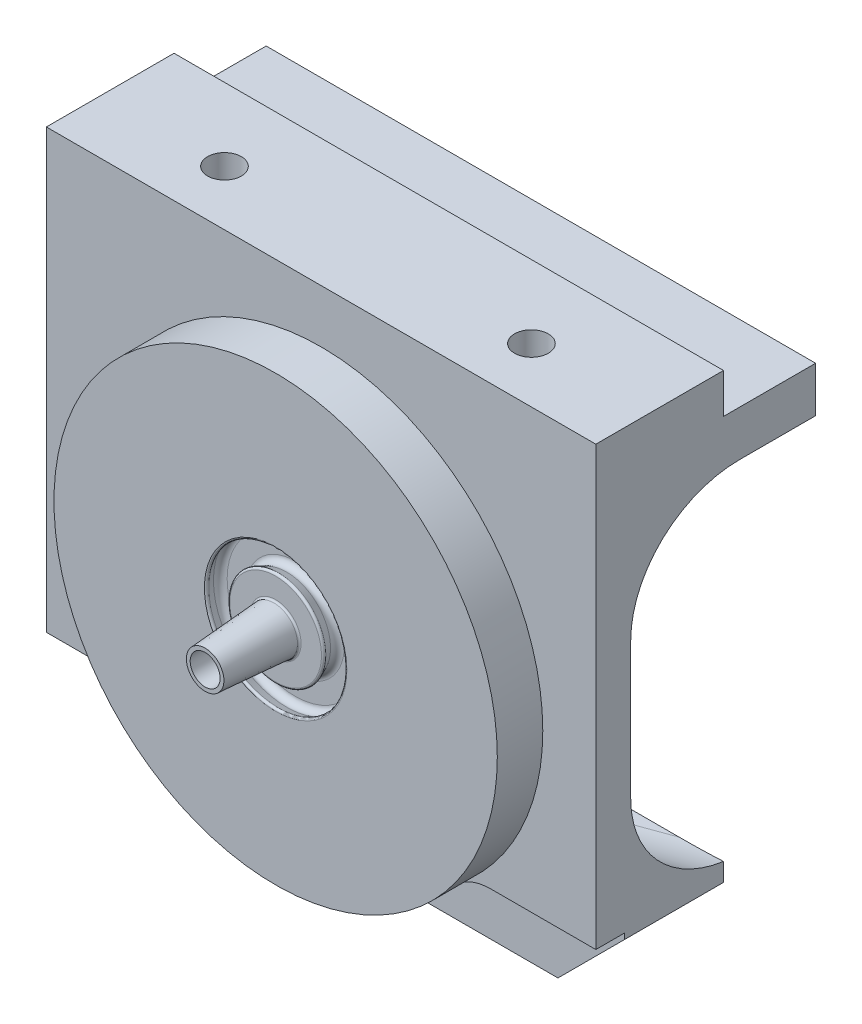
ISO-10303-21;
HEADER;
FILE_DESCRIPTION(('STEP AP214'),'2;1');
FILE_NAME('part.step','',(''),(''),'','','');
FILE_SCHEMA(('AUTOMOTIVE_DESIGN { 1 0 10303 214 1 1 1 1 }'));
ENDSEC;
DATA;
#1=APPLICATION_CONTEXT('core data for automotive mechanical design processes');
#2=APPLICATION_PROTOCOL_DEFINITION('international standard','automotive_design',2000,#1);
#3=PRODUCT_CONTEXT('',#1,'mechanical');
#4=PRODUCT('Part','Part','',(#3));
#5=PRODUCT_RELATED_PRODUCT_CATEGORY('part','',(#4));
#6=PRODUCT_DEFINITION_FORMATION('','',#4);
#7=PRODUCT_DEFINITION_CONTEXT('part definition',#1,'design');
#8=PRODUCT_DEFINITION('design','',#6,#7);
#9=PRODUCT_DEFINITION_SHAPE('','',#8);
#10=(LENGTH_UNIT() NAMED_UNIT(*) SI_UNIT(.MILLI.,.METRE.));
#11=(NAMED_UNIT(*) PLANE_ANGLE_UNIT() SI_UNIT($,.RADIAN.));
#12=(NAMED_UNIT(*) SI_UNIT($,.STERADIAN.) SOLID_ANGLE_UNIT());
#13=UNCERTAINTY_MEASURE_WITH_UNIT(LENGTH_MEASURE(1.E-05),#10,'distance_accuracy_value','');
#14=(GEOMETRIC_REPRESENTATION_CONTEXT(3) GLOBAL_UNCERTAINTY_ASSIGNED_CONTEXT((#13)) GLOBAL_UNIT_ASSIGNED_CONTEXT((#10,
#11,#12)) REPRESENTATION_CONTEXT('',''));
#15=CARTESIAN_POINT('',(0.,0.,0.));
#16=DIRECTION('',(0.,0.,1.));
#17=DIRECTION('',(1.,0.,0.));
#18=AXIS2_PLACEMENT_3D('',#15,#16,#17);
#19=CARTESIAN_POINT('',(-11.303,-18.415,16.7639999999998));
#20=DIRECTION('',(0.707106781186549,0.707106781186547,0.));
#21=DIRECTION('',(-0.707106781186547,0.707106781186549,0.));
#22=AXIS2_PLACEMENT_3D('',#19,#20,#21);
#23=PLANE('',#22);
#24=DIRECTION('',(0.707106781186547,-0.707106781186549,0.));
#25=VECTOR('',#24,1.);
#26=CARTESIAN_POINT('',(-11.303,-18.415,6.17460034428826));
#27=LINE('',#26,#25);
#28=CARTESIAN_POINT('',(-13.97,-15.748,6.17460034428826));
#29=VERTEX_POINT('',#28);
#30=CARTESIAN_POINT('',(-18.415,-11.303,6.17460034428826));
#31=VERTEX_POINT('',#30);
#32=EDGE_CURVE('E249',#29,#31,#27,.F.);
#33=ORIENTED_EDGE('',*,*,#32,.F.);
#34=DIRECTION('',(0.,0.,-0.999999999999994));
#35=VECTOR('',#34,1.);
#36=CARTESIAN_POINT('',(-13.97,-15.748,16.7639999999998));
#37=LINE('',#36,#35);
#38=CARTESIAN_POINT('',(-13.97,-15.748,12.8269999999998));
#39=VERTEX_POINT('',#38);
#40=EDGE_CURVE('E239',#29,#39,#37,.F.);
#41=ORIENTED_EDGE('',*,*,#40,.T.);
#42=DIRECTION('',(0.707106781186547,-0.707106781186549,0.));
#43=VECTOR('',#42,1.);
#44=CARTESIAN_POINT('',(-11.303,-18.415,12.8269999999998));
#45=LINE('',#44,#43);
#46=CARTESIAN_POINT('',(-18.415,-11.303,12.8269999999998));
#47=VERTEX_POINT('',#46);
#48=EDGE_CURVE('E247',#39,#47,#45,.F.);
#49=ORIENTED_EDGE('',*,*,#48,.T.);
#50=DIRECTION('',(0.,0.,0.999999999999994));
#51=VECTOR('',#50,1.);
#52=CARTESIAN_POINT('',(-18.415,-11.303,16.7639999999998));
#53=LINE('',#52,#51);
#54=EDGE_CURVE('E509',#31,#47,#53,.T.);
#55=ORIENTED_EDGE('',*,*,#54,.F.);
#56=EDGE_LOOP('',(#33,#41,#49,#55));
#57=FACE_BOUND('',#56,.T.);
#58=ADVANCED_FACE('F34',(#57),#23,.F.);
#59=CARTESIAN_POINT('',(18.415,-11.303,16.7639999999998));
#60=DIRECTION('',(-0.707106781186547,0.707106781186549,0.));
#61=DIRECTION('',(-0.707106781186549,-0.707106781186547,0.));
#62=AXIS2_PLACEMENT_3D('',#59,#60,#61);
#63=PLANE('',#62);
#64=DIRECTION('',(0.707106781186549,0.707106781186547,0.));
#65=VECTOR('',#64,1.);
#66=CARTESIAN_POINT('',(18.415,-11.303,12.8269999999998));
#67=LINE('',#66,#65);
#68=CARTESIAN_POINT('',(18.415,-11.303,12.8269999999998));
#69=VERTEX_POINT('',#68);
#70=CARTESIAN_POINT('',(13.97,-15.748,12.8269999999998));
#71=VERTEX_POINT('',#70);
#72=EDGE_CURVE('E728',#69,#71,#67,.F.);
#73=ORIENTED_EDGE('',*,*,#72,.T.);
#74=DIRECTION('',(0.,0.,0.999999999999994));
#75=VECTOR('',#74,1.);
#76=CARTESIAN_POINT('',(13.97,-15.748,16.7639999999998));
#77=LINE('',#76,#75);
#78=CARTESIAN_POINT('',(13.97,-15.748,6.17460034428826));
#79=VERTEX_POINT('',#78);
#80=EDGE_CURVE('E49',#71,#79,#77,.F.);
#81=ORIENTED_EDGE('',*,*,#80,.T.);
#82=DIRECTION('',(0.707106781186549,0.707106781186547,0.));
#83=VECTOR('',#82,1.);
#84=CARTESIAN_POINT('',(18.415,-11.303,6.17460034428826));
#85=LINE('',#84,#83);
#86=CARTESIAN_POINT('',(18.415,-11.303,6.17460034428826));
#87=VERTEX_POINT('',#86);
#88=EDGE_CURVE('E619',#87,#79,#85,.F.);
#89=ORIENTED_EDGE('',*,*,#88,.F.);
#90=DIRECTION('',(0.,0.,-0.999999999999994));
#91=VECTOR('',#90,1.);
#92=CARTESIAN_POINT('',(18.415,-11.303,16.7639999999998));
#93=LINE('',#92,#91);
#94=EDGE_CURVE('E505',#69,#87,#93,.T.);
#95=ORIENTED_EDGE('',*,*,#94,.F.);
#96=EDGE_LOOP('',(#73,#81,#89,#95));
#97=FACE_BOUND('',#96,.T.);
#98=ADVANCED_FACE('F476',(#97),#63,.F.);
#99=CARTESIAN_POINT('',(-18.415,-18.415,6.17460034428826));
#100=DIRECTION('',(0.,0.,0.999999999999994));
#101=DIRECTION('',(1.,0.,0.));
#102=AXIS2_PLACEMENT_3D('',#99,#100,#101);
#103=PLANE('',#102);
#104=CARTESIAN_POINT('',(-8.255,-12.954,6.17460034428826));
#105=DIRECTION('',(0.,0.,-0.999999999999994));
#106=DIRECTION('',(-1.,0.,0.));
#107=AXIS2_PLACEMENT_3D('',#104,#105,#106);
#108=CIRCLE('',#107,1.1303);
#109=CARTESIAN_POINT('',(-9.3853,-12.954,6.17460034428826));
#110=VERTEX_POINT('',#109);
#111=EDGE_CURVE('E671',#110,#110,#108,.T.);
#112=ORIENTED_EDGE('',*,*,#111,.F.);
#113=EDGE_LOOP('',(#112));
#114=FACE_BOUND('',#113,.T.);
#115=CARTESIAN_POINT('',(8.25500000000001,-12.954,6.17460034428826));
#116=DIRECTION('',(0.,0.,-0.999999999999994));
#117=DIRECTION('',(-1.,0.,0.));
#118=AXIS2_PLACEMENT_3D('',#115,#116,#117);
#119=CIRCLE('',#118,1.1303);
#120=CARTESIAN_POINT('',(7.12470000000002,-12.954,6.17460034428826));
#121=VERTEX_POINT('',#120);
#122=EDGE_CURVE('E663',#121,#121,#119,.T.);
#123=ORIENTED_EDGE('',*,*,#122,.F.);
#124=EDGE_LOOP('',(#123));
#125=FACE_BOUND('',#124,.T.);
#126=DIRECTION('',(1.,0.,0.));
#127=VECTOR('',#126,1.);
#128=CARTESIAN_POINT('',(-18.415,-15.748,6.17460034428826));
#129=LINE('',#128,#127);
#130=EDGE_CURVE('E250',#29,#79,#129,.T.);
#131=ORIENTED_EDGE('',*,*,#130,.F.);
#132=ORIENTED_EDGE('',*,*,#32,.T.);
#133=DIRECTION('',(0.,-1.,0.));
#134=VECTOR('',#133,1.);
#135=CARTESIAN_POINT('',(-18.415,-18.415,6.17460034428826));
#136=LINE('',#135,#134);
#137=CARTESIAN_POINT('',(-18.415,-10.16,6.17460034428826));
#138=VERTEX_POINT('',#137);
#139=EDGE_CURVE('E598',#138,#31,#136,.T.);
#140=ORIENTED_EDGE('',*,*,#139,.F.);
#141=DIRECTION('',(1.,0.,0.));
#142=VECTOR('',#141,1.);
#143=CARTESIAN_POINT('',(-18.415,-10.16,6.17460034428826));
#144=LINE('',#143,#142);
#145=CARTESIAN_POINT('',(-9.26360214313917,-10.16,6.17460034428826));
#146=VERTEX_POINT('',#145);
#147=EDGE_CURVE('E613',#138,#146,#144,.T.);
#148=ORIENTED_EDGE('',*,*,#147,.T.);
#149=CARTESIAN_POINT('',(8.15407409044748,-10.16,6.17460034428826));
#150=VERTEX_POINT('',#149);
#151=EDGE_CURVE('E615',#146,#150,#144,.T.);
#152=ORIENTED_EDGE('',*,*,#151,.T.);
#153=CARTESIAN_POINT('',(15.4519367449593,-10.16,6.17460034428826));
#154=VERTEX_POINT('',#153);
#155=EDGE_CURVE('E606',#150,#154,#144,.T.);
#156=ORIENTED_EDGE('',*,*,#155,.T.);
#157=CARTESIAN_POINT('',(15.4519367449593,-3.302,6.17460034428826));
#158=DIRECTION('',(0.,0.,0.999999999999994));
#159=DIRECTION('',(1.,0.,0.));
#160=AXIS2_PLACEMENT_3D('',#157,#158,#159);
#161=ELLIPSE('',#160,20.0514505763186,6.858);
#162=CARTESIAN_POINT('',(18.415,-10.0847080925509,6.17460034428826));
#163=VERTEX_POINT('',#162);
#164=EDGE_CURVE('E732',#154,#163,#161,.T.);
#165=ORIENTED_EDGE('',*,*,#164,.T.);
#166=DIRECTION('',(0.,-1.,0.));
#167=VECTOR('',#166,1.);
#168=CARTESIAN_POINT('',(18.415,-18.415,6.17460034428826));
#169=LINE('',#168,#167);
#170=EDGE_CURVE('E604',#163,#87,#169,.T.);
#171=ORIENTED_EDGE('',*,*,#170,.T.);
#172=ORIENTED_EDGE('',*,*,#88,.T.);
#173=EDGE_LOOP('',(#131,#132,#140,#148,#152,#156,#165,#171,#172));
#174=FACE_BOUND('',#173,.T.);
#175=ADVANCED_FACE('F424',(#114,#125,#174),#103,.F.);
#176=CARTESIAN_POINT('',(0.,0.,12.8269999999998));
#177=DIRECTION('',(0.,0.,0.999999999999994));
#178=DIRECTION('',(1.,0.,0.));
#179=AXIS2_PLACEMENT_3D('',#176,#177,#178);
#180=PLANE('',#179);
#181=ORIENTED_EDGE('',*,*,#48,.F.);
#182=DIRECTION('',(1.,0.,0.));
#183=VECTOR('',#182,1.);
#184=CARTESIAN_POINT('',(0.,-15.748,12.8269999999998));
#185=LINE('',#184,#183);
#186=EDGE_CURVE('E13',#39,#71,#185,.T.);
#187=ORIENTED_EDGE('',*,*,#186,.T.);
#188=ORIENTED_EDGE('',*,*,#72,.F.);
#189=DIRECTION('',(0.,1.,0.));
#190=VECTOR('',#189,1.);
#191=CARTESIAN_POINT('',(18.415,18.415,12.8269999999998));
#192=LINE('',#191,#190);
#193=CARTESIAN_POINT('',(18.415,-10.922,12.8269999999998));
#194=VERTEX_POINT('',#193);
#195=EDGE_CURVE('E256',#69,#194,#192,.T.);
#196=ORIENTED_EDGE('',*,*,#195,.T.);
#197=DIRECTION('',(-1.,0.,0.));
#198=VECTOR('',#197,1.);
#199=CARTESIAN_POINT('',(10.0747107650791,-10.922,12.8269999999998));
#200=LINE('',#199,#198);
#201=CARTESIAN_POINT('',(11.3797952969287,-10.922,12.8269999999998));
#202=VERTEX_POINT('',#201);
#203=EDGE_CURVE('E709',#194,#202,#200,.T.);
#204=ORIENTED_EDGE('',*,*,#203,.T.);
#205=CARTESIAN_POINT('',(11.3797952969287,-14.478,12.8269999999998));
#206=DIRECTION('',(0.,0.,0.999999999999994));
#207=DIRECTION('',(1.,0.,0.));
#208=AXIS2_PLACEMENT_3D('',#205,#206,#207);
#209=CIRCLE('',#208,3.556);
#210=CARTESIAN_POINT('',(9.18231758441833,-11.6822482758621,12.8269999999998));
#211=VERTEX_POINT('',#210);
#212=EDGE_CURVE('E745',#202,#211,#209,.T.);
#213=ORIENTED_EDGE('',*,*,#212,.T.);
#214=CARTESIAN_POINT('',(0.,0.,12.8269999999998));
#215=DIRECTION('',(0.,0.,-0.999999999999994));
#216=DIRECTION('',(1.,0.,0.));
#217=AXIS2_PLACEMENT_3D('',#214,#215,#216);
#218=CIRCLE('',#217,14.859);
#219=CARTESIAN_POINT('',(-9.18231758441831,-11.6822482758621,12.8269999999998));
#220=VERTEX_POINT('',#219);
#221=EDGE_CURVE('E712',#211,#220,#218,.T.);
#222=ORIENTED_EDGE('',*,*,#221,.T.);
#223=CARTESIAN_POINT('',(-11.3797952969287,-14.478,12.8269999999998));
#224=DIRECTION('',(0.,0.,0.999999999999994));
#225=DIRECTION('',(1.,0.,0.));
#226=AXIS2_PLACEMENT_3D('',#223,#224,#225);
#227=CIRCLE('',#226,3.556);
#228=CARTESIAN_POINT('',(-11.3797952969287,-10.922,12.8269999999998));
#229=VERTEX_POINT('',#228);
#230=EDGE_CURVE('E742',#220,#229,#227,.T.);
#231=ORIENTED_EDGE('',*,*,#230,.T.);
#232=DIRECTION('',(-1.,0.,0.));
#233=VECTOR('',#232,1.);
#234=CARTESIAN_POINT('',(-28.0861261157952,-10.922,12.8269999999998));
#235=LINE('',#234,#233);
#236=CARTESIAN_POINT('',(-18.415,-10.922,12.8269999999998));
#237=VERTEX_POINT('',#236);
#238=EDGE_CURVE('E717',#229,#237,#235,.T.);
#239=ORIENTED_EDGE('',*,*,#238,.T.);
#240=DIRECTION('',(0.,-1.,0.));
#241=VECTOR('',#240,1.);
#242=CARTESIAN_POINT('',(-18.415,18.415,12.8269999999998));
#243=LINE('',#242,#241);
#244=EDGE_CURVE('E254',#237,#47,#243,.T.);
#245=ORIENTED_EDGE('',*,*,#244,.T.);
#246=EDGE_LOOP('',(#181,#187,#188,#196,#204,#213,#222,#231,#239,#245));
#247=FACE_BOUND('',#246,.T.);
#248=ADVANCED_FACE('F252',(#247),#180,.T.);
#249=CARTESIAN_POINT('',(-18.415,18.415,16.7639999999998));
#250=DIRECTION('',(1.,0.,0.));
#251=DIRECTION('',(0.,0.,-0.999999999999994));
#252=AXIS2_PLACEMENT_3D('',#249,#250,#251);
#253=PLANE('',#252);
#254=ORIENTED_EDGE('',*,*,#244,.F.);
#255=DIRECTION('',(0.,0.,0.999999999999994));
#256=VECTOR('',#255,1.);
#257=CARTESIAN_POINT('',(-18.415,-10.922,16.7639999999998));
#258=LINE('',#257,#256);
#259=CARTESIAN_POINT('',(-18.415,-10.922,14.7319999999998));
#260=VERTEX_POINT('',#259);
#261=EDGE_CURVE('E260',#237,#260,#258,.T.);
#262=ORIENTED_EDGE('',*,*,#261,.T.);
#263=DIRECTION('',(0.,-1.,0.));
#264=VECTOR('',#263,1.);
#265=CARTESIAN_POINT('',(-18.415,18.415,14.7319999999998));
#266=LINE('',#265,#264);
#267=CARTESIAN_POINT('',(-18.415,18.415,14.7319999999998));
#268=VERTEX_POINT('',#267);
#269=EDGE_CURVE('E269',#268,#260,#266,.T.);
#270=ORIENTED_EDGE('',*,*,#269,.F.);
#271=DIRECTION('',(0.,0.,-0.999999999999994));
#272=VECTOR('',#271,1.);
#273=CARTESIAN_POINT('',(-18.415,18.415,16.7639999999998));
#274=LINE('',#273,#272);
#275=CARTESIAN_POINT('',(-18.415,18.415,6.17460034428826));
#276=VERTEX_POINT('',#275);
#277=EDGE_CURVE('E591',#268,#276,#274,.T.);
#278=ORIENTED_EDGE('',*,*,#277,.T.);
#279=DIRECTION('',(0.,-1.,0.));
#280=VECTOR('',#279,1.);
#281=CARTESIAN_POINT('',(-18.415,18.415,6.17460034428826));
#282=LINE('',#281,#280);
#283=CARTESIAN_POINT('',(-18.415,15.748,6.17460034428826));
#284=VERTEX_POINT('',#283);
#285=EDGE_CURVE('E628',#276,#284,#282,.T.);
#286=ORIENTED_EDGE('',*,*,#285,.T.);
#287=DIRECTION('',(0.,0.,-0.999999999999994));
#288=VECTOR('',#287,1.);
#289=CARTESIAN_POINT('',(-18.415,15.748,0.));
#290=LINE('',#289,#288);
#291=CARTESIAN_POINT('',(-18.415,15.748,0.));
#292=VERTEX_POINT('',#291);
#293=EDGE_CURVE('E631',#284,#292,#290,.T.);
#294=ORIENTED_EDGE('',*,*,#293,.T.);
#295=DIRECTION('',(0.,-1.,0.));
#296=VECTOR('',#295,1.);
#297=CARTESIAN_POINT('',(-18.415,18.415,0.));
#298=LINE('',#297,#296);
#299=CARTESIAN_POINT('',(-18.415,12.7,0.));
#300=VERTEX_POINT('',#299);
#301=EDGE_CURVE('E586',#292,#300,#298,.T.);
#302=ORIENTED_EDGE('',*,*,#301,.T.);
#303=DIRECTION('',(0.,0.,0.999999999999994));
#304=VECTOR('',#303,1.);
#305=CARTESIAN_POINT('',(-18.415,12.7,13.8535349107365));
#306=LINE('',#305,#304);
#307=CARTESIAN_POINT('',(-18.415,12.7,13.8535349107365));
#308=VERTEX_POINT('',#307);
#309=EDGE_CURVE('E569',#300,#308,#306,.T.);
#310=ORIENTED_EDGE('',*,*,#309,.T.);
#311=DIRECTION('',(0.,1.,0.));
#312=VECTOR('',#311,1.);
#313=CARTESIAN_POINT('',(-18.415,-10.16,13.8535349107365));
#314=LINE('',#313,#312);
#315=CARTESIAN_POINT('',(-18.415,-10.16,13.8535349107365));
#316=VERTEX_POINT('',#315);
#317=EDGE_CURVE('E582',#316,#308,#314,.T.);
#318=ORIENTED_EDGE('',*,*,#317,.F.);
#319=DIRECTION('',(0.,0.,0.999999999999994));
#320=VECTOR('',#319,1.);
#321=CARTESIAN_POINT('',(-18.415,-10.16,13.8535349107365));
#322=LINE('',#321,#320);
#323=EDGE_CURVE('E577',#138,#316,#322,.T.);
#324=ORIENTED_EDGE('',*,*,#323,.F.);
#325=ORIENTED_EDGE('',*,*,#139,.T.);
#326=ORIENTED_EDGE('',*,*,#54,.T.);
#327=EDGE_LOOP('',(#254,#262,#270,#278,#286,#294,#302,#310,#318,#324,#325,#326));
#328=FACE_BOUND('',#327,.T.);
#329=ADVANCED_FACE('F484',(#328),#253,.F.);
#330=CARTESIAN_POINT('',(18.415,18.415,16.7639999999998));
#331=DIRECTION('',(-1.,0.,0.));
#332=DIRECTION('',(0.,0.,0.999999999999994));
#333=AXIS2_PLACEMENT_3D('',#330,#331,#332);
#334=PLANE('',#333);
#335=DIRECTION('',(0.,1.,0.));
#336=VECTOR('',#335,1.);
#337=CARTESIAN_POINT('',(18.415,-18.415,14.7319999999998));
#338=LINE('',#337,#336);
#339=CARTESIAN_POINT('',(18.415,-10.922,14.7319999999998));
#340=VERTEX_POINT('',#339);
#341=CARTESIAN_POINT('',(18.415,18.415,14.7319999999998));
#342=VERTEX_POINT('',#341);
#343=EDGE_CURVE('E265',#340,#342,#338,.T.);
#344=ORIENTED_EDGE('',*,*,#343,.F.);
#345=DIRECTION('',(0.,0.,-0.999999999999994));
#346=VECTOR('',#345,1.);
#347=CARTESIAN_POINT('',(18.415,-10.922,16.7639999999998));
#348=LINE('',#347,#346);
#349=EDGE_CURVE('E719',#340,#194,#348,.T.);
#350=ORIENTED_EDGE('',*,*,#349,.T.);
#351=ORIENTED_EDGE('',*,*,#195,.F.);
#352=ORIENTED_EDGE('',*,*,#94,.T.);
#353=ORIENTED_EDGE('',*,*,#170,.F.);
#354=CARTESIAN_POINT('',(18.415,-3.302,5.09613351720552));
#355=DIRECTION('',(-1.,0.,0.));
#356=DIRECTION('',(0.,0.,-0.999999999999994));
#357=AXIS2_PLACEMENT_3D('',#354,#355,#356);
#358=ELLIPSE('',#357,7.2981311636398,6.858);
#359=CARTESIAN_POINT('',(18.415,-3.302,12.3942646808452));
#360=VERTEX_POINT('',#359);
#361=EDGE_CURVE('E734',#163,#360,#358,.T.);
#362=ORIENTED_EDGE('',*,*,#361,.T.);
#363=DIRECTION('',(0.,1.,0.));
#364=VECTOR('',#363,1.);
#365=CARTESIAN_POINT('',(18.415,18.415,12.3942646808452));
#366=LINE('',#365,#364);
#367=CARTESIAN_POINT('',(18.415,5.84199999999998,12.3942646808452));
#368=VERTEX_POINT('',#367);
#369=EDGE_CURVE('E524',#360,#368,#366,.T.);
#370=ORIENTED_EDGE('',*,*,#369,.T.);
#371=CARTESIAN_POINT('',(18.415,5.84199999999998,5.09613351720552));
#372=DIRECTION('',(-1.,0.,0.));
#373=DIRECTION('',(0.,0.,-0.999999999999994));
#374=AXIS2_PLACEMENT_3D('',#371,#372,#373);
#375=ELLIPSE('',#374,7.2981311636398,6.858);
#376=CARTESIAN_POINT('',(18.415,12.7,5.09613351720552));
#377=VERTEX_POINT('',#376);
#378=EDGE_CURVE('E407',#368,#377,#375,.T.);
#379=ORIENTED_EDGE('',*,*,#378,.T.);
#380=DIRECTION('',(0.,0.,-0.999999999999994));
#381=VECTOR('',#380,1.);
#382=CARTESIAN_POINT('',(18.415,12.7,16.7639999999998));
#383=LINE('',#382,#381);
#384=CARTESIAN_POINT('',(18.415,12.7,0.));
#385=VERTEX_POINT('',#384);
#386=EDGE_CURVE('E543',#377,#385,#383,.T.);
#387=ORIENTED_EDGE('',*,*,#386,.T.);
#388=DIRECTION('',(0.,1.,0.));
#389=VECTOR('',#388,1.);
#390=CARTESIAN_POINT('',(18.415,18.415,0.));
#391=LINE('',#390,#389);
#392=CARTESIAN_POINT('',(18.415,15.748,0.));
#393=VERTEX_POINT('',#392);
#394=EDGE_CURVE('E589',#385,#393,#391,.T.);
#395=ORIENTED_EDGE('',*,*,#394,.T.);
#396=DIRECTION('',(0.,0.,-0.999999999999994));
#397=VECTOR('',#396,1.);
#398=CARTESIAN_POINT('',(18.415,15.748,0.));
#399=LINE('',#398,#397);
#400=CARTESIAN_POINT('',(18.415,15.748,6.17460034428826));
#401=VERTEX_POINT('',#400);
#402=EDGE_CURVE('E626',#401,#393,#399,.T.);
#403=ORIENTED_EDGE('',*,*,#402,.F.);
#404=DIRECTION('',(0.,-1.,0.));
#405=VECTOR('',#404,1.);
#406=CARTESIAN_POINT('',(18.415,18.415,6.17460034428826));
#407=LINE('',#406,#405);
#408=CARTESIAN_POINT('',(18.415,18.415,6.17460034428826));
#409=VERTEX_POINT('',#408);
#410=EDGE_CURVE('E623',#409,#401,#407,.T.);
#411=ORIENTED_EDGE('',*,*,#410,.F.);
#412=DIRECTION('',(0.,0.,-0.999999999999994));
#413=VECTOR('',#412,1.);
#414=CARTESIAN_POINT('',(18.415,18.415,16.7639999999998));
#415=LINE('',#414,#413);
#416=EDGE_CURVE('E593',#342,#409,#415,.T.);
#417=ORIENTED_EDGE('',*,*,#416,.F.);
#418=EDGE_LOOP('',(#344,#350,#351,#352,#353,#362,#370,#379,#387,#395,#403,#411,#417));
#419=FACE_BOUND('',#418,.T.);
#420=ADVANCED_FACE('F541',(#419),#334,.F.);
#421=CARTESIAN_POINT('',(-18.415,18.415,16.7639999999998));
#422=DIRECTION('',(0.,-1.,0.));
#423=DIRECTION('',(0.,0.,-0.999999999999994));
#424=AXIS2_PLACEMENT_3D('',#421,#422,#423);
#425=PLANE('',#424);
#426=CARTESIAN_POINT('',(10.414,18.415,11.0489999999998));
#427=DIRECTION('',(0.,1.,0.));
#428=DIRECTION('',(0.,0.,0.999999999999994));
#429=AXIS2_PLACEMENT_3D('',#426,#427,#428);
#430=CIRCLE('',#429,1.13029999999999);
#431=CARTESIAN_POINT('',(10.414,18.415,12.1792999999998));
#432=VERTEX_POINT('',#431);
#433=EDGE_CURVE('E609',#432,#432,#430,.T.);
#434=ORIENTED_EDGE('',*,*,#433,.F.);
#435=EDGE_LOOP('',(#434));
#436=FACE_BOUND('',#435,.T.);
#437=CARTESIAN_POINT('',(-10.16,18.415,11.0489999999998));
#438=DIRECTION('',(0.,1.,0.));
#439=DIRECTION('',(0.,0.,0.999999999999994));
#440=AXIS2_PLACEMENT_3D('',#437,#438,#439);
#441=CIRCLE('',#440,1.13029999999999);
#442=CARTESIAN_POINT('',(-10.16,18.415,12.1792999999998));
#443=VERTEX_POINT('',#442);
#444=EDGE_CURVE('E677',#443,#443,#441,.T.);
#445=ORIENTED_EDGE('',*,*,#444,.F.);
#446=EDGE_LOOP('',(#445));
#447=FACE_BOUND('',#446,.T.);
#448=DIRECTION('',(-1.,0.,0.));
#449=VECTOR('',#448,1.);
#450=CARTESIAN_POINT('',(18.415,18.415,14.7319999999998));
#451=LINE('',#450,#449);
#452=EDGE_CURVE('E267',#342,#268,#451,.T.);
#453=ORIENTED_EDGE('',*,*,#452,.F.);
#454=ORIENTED_EDGE('',*,*,#416,.T.);
#455=DIRECTION('',(1.,0.,0.));
#456=VECTOR('',#455,1.);
#457=CARTESIAN_POINT('',(-18.415,18.415,6.17460034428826));
#458=LINE('',#457,#456);
#459=EDGE_CURVE('E634',#276,#409,#458,.T.);
#460=ORIENTED_EDGE('',*,*,#459,.F.);
#461=ORIENTED_EDGE('',*,*,#277,.F.);
#462=EDGE_LOOP('',(#453,#454,#460,#461));
#463=FACE_BOUND('',#462,.T.);
#464=ADVANCED_FACE('F685',(#436,#447,#463),#425,.F.);
#465=CARTESIAN_POINT('',(0.,0.,17.7799999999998));
#466=DIRECTION('',(0.,0.,0.999999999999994));
#467=DIRECTION('',(1.,0.,0.));
#468=AXIS2_PLACEMENT_3D('',#465,#466,#467);
#469=PLANE('',#468);
#470=CARTESIAN_POINT('',(0.,0.,17.7799999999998));
#471=DIRECTION('',(0.,0.,0.999999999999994));
#472=DIRECTION('',(1.,0.,0.));
#473=AXIS2_PLACEMENT_3D('',#470,#471,#472);
#474=CIRCLE('',#473,4.7752);
#475=CARTESIAN_POINT('',(4.7752,0.,17.7799999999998));
#476=VERTEX_POINT('',#475);
#477=EDGE_CURVE('E771',#476,#476,#474,.F.);
#478=ORIENTED_EDGE('',*,*,#477,.T.);
#479=EDGE_LOOP('',(#478));
#480=FACE_BOUND('',#479,.T.);
#481=CARTESIAN_POINT('',(0.,0.,17.7799999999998));
#482=DIRECTION('',(0.,0.,0.999999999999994));
#483=DIRECTION('',(1.,0.,0.));
#484=AXIS2_PLACEMENT_3D('',#481,#482,#483);
#485=CIRCLE('',#484,14.859);
#486=CARTESIAN_POINT('',(14.859,0.,17.7799999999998));
#487=VERTEX_POINT('',#486);
#488=EDGE_CURVE('E284',#487,#487,#485,.T.);
#489=ORIENTED_EDGE('',*,*,#488,.T.);
#490=EDGE_LOOP('',(#489));
#491=FACE_BOUND('',#490,.T.);
#492=ADVANCED_FACE('F688',(#480,#491),#469,.T.);
#493=CARTESIAN_POINT('',(0.,0.,17.7799999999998));
#494=DIRECTION('',(0.,0.,0.999999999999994));
#495=DIRECTION('',(1.,0.,0.));
#496=AXIS2_PLACEMENT_3D('',#493,#494,#495);
#497=CIRCLE('',#496,1.70592941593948);
#498=CARTESIAN_POINT('',(1.70592941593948,0.,17.7799999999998));
#499=VERTEX_POINT('',#498);
#500=EDGE_CURVE('E762',#499,#499,#497,.F.);
#501=ORIENTED_EDGE('',*,*,#500,.T.);
#502=EDGE_LOOP('',(#501));
#503=FACE_BOUND('',#502,.T.);
#504=CARTESIAN_POINT('',(0.,0.,17.7799999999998));
#505=DIRECTION('',(0.,0.,0.999999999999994));
#506=DIRECTION('',(1.,0.,0.));
#507=AXIS2_PLACEMENT_3D('',#504,#505,#506);
#508=CIRCLE('',#507,3.07340000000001);
#509=CARTESIAN_POINT('',(3.07340000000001,0.,17.7799999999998));
#510=VERTEX_POINT('',#509);
#511=EDGE_CURVE('E774',#510,#510,#508,.T.);
#512=ORIENTED_EDGE('',*,*,#511,.T.);
#513=EDGE_LOOP('',(#512));
#514=FACE_BOUND('',#513,.T.);
#515=ADVANCED_FACE('F383',(#503,#514),#469,.T.);
#516=CARTESIAN_POINT('',(0.422319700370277,0.,13.6721922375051));
#517=DIRECTION('',(0.93969262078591,0.,-0.342020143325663));
#518=DIRECTION('',(-0.342020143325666,0.,-0.939692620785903));
#519=AXIS2_PLACEMENT_3D('',#516,#517,#518);
#520=CYLINDRICAL_SURFACE('',#519,1.5875);
#521=CARTESIAN_POINT('',(3.88320762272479,0.,12.4125320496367));
#522=DIRECTION('',(-0.93969262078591,0.,0.342020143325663));
#523=DIRECTION('',(0.342020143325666,0.,0.939692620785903));
#524=AXIS2_PLACEMENT_3D('',#521,#522,#523);
#525=CIRCLE('',#524,1.5875);
#526=CARTESIAN_POINT('',(4.42616460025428,0.,13.9042940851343));
#527=VERTEX_POINT('',#526);
#528=EDGE_CURVE('E299',#527,#527,#525,.F.);
#529=ORIENTED_EDGE('',*,*,#528,.T.);
#530=EDGE_LOOP('',(#529));
#531=FACE_BOUND('',#530,.T.);
#532=CARTESIAN_POINT('',(0.422319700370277,0.,13.6721922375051));
#533=DIRECTION('',(0.93969262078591,0.,-0.342020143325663));
#534=DIRECTION('',(-0.342020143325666,0.,-0.939692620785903));
#535=AXIS2_PLACEMENT_3D('',#532,#533,#534);
#536=CIRCLE('',#535,1.5875);
#537=CARTESIAN_POINT('',(0.954987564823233,-0.307586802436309,15.1356851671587));
#538=VERTEX_POINT('',#537);
#539=CARTESIAN_POINT('',(-0.111113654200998,-0.296029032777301,12.2065961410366));
#540=VERTEX_POINT('',#539);
#541=EDGE_CURVE('E638',#538,#540,#536,.T.);
#542=ORIENTED_EDGE('',*,*,#541,.F.);
#543=CARTESIAN_POINT('',(0.954987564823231,0.307586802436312,15.1356851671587));
#544=CARTESIAN_POINT('',(0.963394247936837,0.281486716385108,15.1381135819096));
#545=CARTESIAN_POINT('',(0.970733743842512,0.25502933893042,15.1402739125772));
#546=CARTESIAN_POINT('',(0.983228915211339,0.201559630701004,15.1439943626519));
#547=CARTESIAN_POINT('',(0.98838434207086,0.174547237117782,15.1455544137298));
#548=CARTESIAN_POINT('',(1.00027484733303,0.0944284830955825,15.1491695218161));
#549=CARTESIAN_POINT('',(1.00390057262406,0.040780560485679,15.1502997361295));
#550=CARTESIAN_POINT('',(1.00258901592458,-0.0622262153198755,15.1498959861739));
#551=CARTESIAN_POINT('',(0.998292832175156,-0.111595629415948,15.148561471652));
#552=CARTESIAN_POINT('',(0.98636860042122,-0.185283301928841,15.1449451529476));
#553=CARTESIAN_POINT('',(0.98138185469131,-0.21009330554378,15.1434411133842));
#554=CARTESIAN_POINT('',(0.969560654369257,-0.259232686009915,15.1399286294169));
#555=CARTESIAN_POINT('',(0.962726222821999,-0.283562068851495,15.137920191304));
#556=CARTESIAN_POINT('',(0.954987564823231,-0.307586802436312,15.1356851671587));
#557=B_SPLINE_CURVE_WITH_KNOTS('',3,(#543,#544,#545,#546,#547,#548,#549,#550,#551,#552,#553,
#554,#555,#556),.UNSPECIFIED.,.F.,.F.,(4,2,2,2,2,2,4),(0.,0.0825368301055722,0.165083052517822,
0.325617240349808,0.473725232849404,0.549709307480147,0.625692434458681),.UNSPECIFIED.);
#558=CARTESIAN_POINT('',(0.954987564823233,0.30758680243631,15.1356851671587));
#559=VERTEX_POINT('',#558);
#560=EDGE_CURVE('E372',#559,#538,#557,.T.);
#561=ORIENTED_EDGE('',*,*,#560,.F.);
#562=CARTESIAN_POINT('',(-0.111113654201,0.2960290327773,12.2065961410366));
#563=VERTEX_POINT('',#562);
#564=EDGE_CURVE('E642',#563,#559,#536,.T.);
#565=ORIENTED_EDGE('',*,*,#564,.F.);
#566=CARTESIAN_POINT('',(-0.111113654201,-0.296029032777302,12.2065961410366));
#567=CARTESIAN_POINT('',(-0.1064289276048,-0.269842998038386,12.1995992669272));
#568=CARTESIAN_POINT('',(-0.102387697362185,-0.243314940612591,12.1935005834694));
#569=CARTESIAN_POINT('',(-0.0955897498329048,-0.189731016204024,12.1831758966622));
#570=CARTESIAN_POINT('',(-0.0928332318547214,-0.162675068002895,12.1789501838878));
#571=CARTESIAN_POINT('',(-0.0866015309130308,-0.0824127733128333,12.1693729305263));
#572=CARTESIAN_POINT('',(-0.0849166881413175,-0.0286995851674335,12.1667431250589));
#573=CARTESIAN_POINT('',(-0.0863081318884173,0.070357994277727,12.1689011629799));
#574=CARTESIAN_POINT('',(-0.0887050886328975,0.115743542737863,12.1726307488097));
#575=CARTESIAN_POINT('',(-0.0971072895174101,0.206449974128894,12.1854846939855));
#576=CARTESIAN_POINT('',(-0.10319201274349,0.251746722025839,12.1947278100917));
#577=CARTESIAN_POINT('',(-0.111113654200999,0.296029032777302,12.2065961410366));
#578=B_SPLINE_CURVE_WITH_KNOTS('',3,(#566,#567,#568,#569,#570,#571,#572,#573,#574,#575,#576,
#577),.UNSPECIFIED.,.F.,.F.,(4,2,2,2,2,4),(0.,0.0824695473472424,0.164951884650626,
0.325523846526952,0.461894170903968,0.601313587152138),.UNSPECIFIED.);
#579=EDGE_CURVE('E363',#540,#563,#578,.T.);
#580=ORIENTED_EDGE('',*,*,#579,.F.);
#581=EDGE_LOOP('',(#542,#561,#565,#580));
#582=FACE_BOUND('',#581,.T.);
#583=ADVANCED_FACE('F356',(#531,#582),#520,.F.);
#584=CARTESIAN_POINT('',(-0.250172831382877,0.,13.5322404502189));
#585=DIRECTION('',(-0.642787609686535,0.,-0.766044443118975));
#586=DIRECTION('',(-0.766044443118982,0.,0.642787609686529));
#587=AXIS2_PLACEMENT_3D('',#584,#585,#586);
#588=CYLINDRICAL_SURFACE('',#587,1.00329999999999);
#589=ORIENTED_EDGE('',*,*,#579,.T.);
#590=CARTESIAN_POINT('',(-0.100053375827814,0.195574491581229,12.1802302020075));
#591=CARTESIAN_POINT('',(-0.102378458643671,0.222571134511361,12.1858043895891));
#592=CARTESIAN_POINT('',(-0.105184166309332,0.249273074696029,12.1925160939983));
#593=CARTESIAN_POINT('',(-0.111740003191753,0.301904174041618,12.2080945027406));
#594=CARTESIAN_POINT('',(-0.115489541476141,0.327833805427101,12.2169598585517));
#595=CARTESIAN_POINT('',(-0.128084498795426,0.403940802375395,12.2465032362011));
#596=CARTESIAN_POINT('',(-0.138303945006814,0.452756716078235,12.270196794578));
#597=CARTESIAN_POINT('',(-0.162231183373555,0.545360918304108,12.3242853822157));
#598=CARTESIAN_POINT('',(-0.175931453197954,0.589159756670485,12.3546659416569));
#599=CARTESIAN_POINT('',(-0.206813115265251,0.671170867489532,12.4208392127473));
#600=CARTESIAN_POINT('',(-0.223999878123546,0.709374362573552,12.4566402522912));
#601=CARTESIAN_POINT('',(-0.263488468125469,0.782353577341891,12.5352399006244));
#602=CARTESIAN_POINT('',(-0.286089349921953,0.816611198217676,12.5783691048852));
#603=CARTESIAN_POINT('',(-0.335960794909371,0.877227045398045,12.6674151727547));
#604=CARTESIAN_POINT('',(-0.363230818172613,0.903586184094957,12.7133317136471));
#605=CARTESIAN_POINT('',(-0.418367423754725,0.944065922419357,12.7982086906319));
#606=CARTESIAN_POINT('',(-0.445413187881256,0.959480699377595,12.8370838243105));
#607=CARTESIAN_POINT('',(-0.50393793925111,0.983677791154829,12.9135315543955));
#608=CARTESIAN_POINT('',(-0.535409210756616,0.99247148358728,12.9511062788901));
#609=CARTESIAN_POINT('',(-0.597526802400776,1.0020243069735,13.0168822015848));
#610=CARTESIAN_POINT('',(-0.627447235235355,1.00387251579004,13.045605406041));
#611=CARTESIAN_POINT('',(-0.690368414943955,1.00242026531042,13.099277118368));
#612=CARTESIAN_POINT('',(-0.723365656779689,0.999125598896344,13.124229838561));
#613=CARTESIAN_POINT('',(-0.791661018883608,0.987591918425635,13.1693651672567));
#614=CARTESIAN_POINT('',(-0.826958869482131,0.979353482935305,13.1895483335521));
#615=CARTESIAN_POINT('',(-0.898742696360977,0.958467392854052,13.2249226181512));
#616=CARTESIAN_POINT('',(-0.935230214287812,0.94581379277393,13.2401069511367));
#617=CARTESIAN_POINT('',(-1.02246554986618,0.911082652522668,13.2709570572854));
#618=CARTESIAN_POINT('',(-1.07324865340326,0.887253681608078,13.2845199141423));
#619=CARTESIAN_POINT('',(-1.17289420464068,0.833521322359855,13.3051739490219));
#620=CARTESIAN_POINT('',(-1.2217515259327,0.803602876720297,13.3122488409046));
#621=CARTESIAN_POINT('',(-1.31785849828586,0.736924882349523,13.3222448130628));
#622=CARTESIAN_POINT('',(-1.36497240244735,0.699945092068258,13.3249942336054));
#623=CARTESIAN_POINT('',(-1.45389202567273,0.619984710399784,13.3276525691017));
#624=CARTESIAN_POINT('',(-1.49570115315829,0.57700800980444,13.3275633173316));
#625=CARTESIAN_POINT('',(-1.56656282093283,0.491500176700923,13.3260892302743));
#626=CARTESIAN_POINT('',(-1.5965838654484,0.449773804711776,13.3248903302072));
#627=CARTESIAN_POINT('',(-1.64943790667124,0.362080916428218,13.3222213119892));
#628=CARTESIAN_POINT('',(-1.67229710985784,0.316130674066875,13.3207522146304));
#629=CARTESIAN_POINT('',(-1.69989507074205,0.24454698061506,13.318810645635));
#630=CARTESIAN_POINT('',(-1.70799083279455,0.220179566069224,13.3182059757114));
#631=CARTESIAN_POINT('',(-1.71482942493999,0.195446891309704,13.3176857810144));
#632=B_SPLINE_CURVE_WITH_KNOTS('',3,(#590,#591,#592,#593,#594,#595,#596,#597,#598,#599,#600,
#601,#602,#603,#604,#605,#606,#607,#608,#609,#610,#611,#612,#613,#614,#615,#616,#617,#618,#619,
#620,#621,#622,#623,#624,#625,#626,#627,#628,#629,#630,#631),.UNSPECIFIED.,.F.,.F.,(4,2,2,2,2,2,
2,2,2,2,2,2,2,2,2,2,2,2,2,2,4),(0.,0.0829301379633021,0.165808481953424,0.330592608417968,
0.495023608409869,0.659709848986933,0.837560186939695,1.01538997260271,1.16425146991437,
1.31285657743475,1.43686117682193,1.56072619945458,1.68457672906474,1.80859468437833,
1.9807733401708,2.15338302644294,2.332684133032,2.51186944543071,2.66558837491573,
2.81873806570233,2.89569175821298),.UNSPECIFIED.);
#633=CARTESIAN_POINT('',(-1.70671547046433,0.22276282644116,13.3182989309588));
#634=VERTEX_POINT('',#633);
#635=EDGE_CURVE('E347',#563,#634,#632,.T.);
#636=ORIENTED_EDGE('',*,*,#635,.T.);
#637=CARTESIAN_POINT('',(-2.68497290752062,0.,10.6305587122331));
#638=DIRECTION('',(0.93969262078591,0.,-0.342020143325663));
#639=DIRECTION('',(-0.342020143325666,0.,-0.939692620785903));
#640=AXIS2_PLACEMENT_3D('',#637,#638,#639);
#641=ELLIPSE('',#640,2.93345295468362,1.00329999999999);
#642=CARTESIAN_POINT('',(-1.70671547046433,-0.22276282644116,13.3182989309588));
#643=VERTEX_POINT('',#642);
#644=EDGE_CURVE('E656',#643,#634,#641,.F.);
#645=ORIENTED_EDGE('',*,*,#644,.F.);
#646=CARTESIAN_POINT('',(-1.71482942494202,-0.195446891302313,13.3176857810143));
#647=CARTESIAN_POINT('',(-1.7077379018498,-0.22105895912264,13.3182272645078));
#648=CARTESIAN_POINT('',(-1.69931482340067,-0.246270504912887,13.3188550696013));
#649=CARTESIAN_POINT('',(-1.68007840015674,-0.295708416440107,13.3202005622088));
#650=CARTESIAN_POINT('',(-1.66926978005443,-0.31993661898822,13.3209180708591));
#651=CARTESIAN_POINT('',(-1.63390135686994,-0.390464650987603,13.3230685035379));
#652=CARTESIAN_POINT('',(-1.60622066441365,-0.435212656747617,13.3245157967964));
#653=CARTESIAN_POINT('',(-1.53643320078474,-0.531077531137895,13.3269767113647));
#654=CARTESIAN_POINT('',(-1.49244686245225,-0.580806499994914,13.3277784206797));
#655=CARTESIAN_POINT('',(-1.39710698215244,-0.673172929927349,13.3264247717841));
#656=CARTESIAN_POINT('',(-1.34570357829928,-0.715757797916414,13.3242484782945));
#657=CARTESIAN_POINT('',(-1.23684051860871,-0.794371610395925,13.3144141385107));
#658=CARTESIAN_POINT('',(-1.17927356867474,-0.830238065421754,13.3066380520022));
#659=CARTESIAN_POINT('',(-1.06161481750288,-0.893364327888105,13.2819621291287));
#660=CARTESIAN_POINT('',(-1.00154115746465,-0.920676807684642,13.2651199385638));
#661=CARTESIAN_POINT('',(-0.905132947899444,-0.956339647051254,13.2276670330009));
#662=CARTESIAN_POINT('',(-0.868500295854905,-0.967947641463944,13.2109566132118));
#663=CARTESIAN_POINT('',(-0.796777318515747,-0.986483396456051,13.1724132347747));
#664=CARTESIAN_POINT('',(-0.761685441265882,-0.993415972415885,13.1505855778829));
#665=CARTESIAN_POINT('',(-0.694105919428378,-1.00214239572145,13.1022760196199));
#666=CARTESIAN_POINT('',(-0.661621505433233,-1.00392996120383,13.0757884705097));
#667=CARTESIAN_POINT('',(-0.59991600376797,-1.00227201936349,13.0193650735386));
#668=CARTESIAN_POINT('',(-0.57069980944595,-0.998818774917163,12.9894241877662));
#669=CARTESIAN_POINT('',(-0.508940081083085,-0.985450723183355,12.9199909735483));
#670=CARTESIAN_POINT('',(-0.477318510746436,-0.974167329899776,12.8799480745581));
#671=CARTESIAN_POINT('',(-0.418756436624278,-0.944530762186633,12.7990856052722));
#672=CARTESIAN_POINT('',(-0.391821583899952,-0.926169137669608,12.7582651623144));
#673=CARTESIAN_POINT('',(-0.341558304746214,-0.882619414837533,12.6769598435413));
#674=CARTESIAN_POINT('',(-0.318297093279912,-0.857323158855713,12.6364917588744));
#675=CARTESIAN_POINT('',(-0.275397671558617,-0.800539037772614,12.5580587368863));
#676=CARTESIAN_POINT('',(-0.25576032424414,-0.769049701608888,12.5200943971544));
#677=CARTESIAN_POINT('',(-0.216776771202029,-0.694527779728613,12.4419000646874));
#678=CARTESIAN_POINT('',(-0.198033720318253,-0.650444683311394,12.4023609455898));
#679=CARTESIAN_POINT('',(-0.16495826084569,-0.555310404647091,12.3305362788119));
#680=CARTESIAN_POINT('',(-0.150619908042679,-0.504268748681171,12.2982409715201));
#681=CARTESIAN_POINT('',(-0.129612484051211,-0.410583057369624,12.2500624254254));
#682=CARTESIAN_POINT('',(-0.121918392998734,-0.36923248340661,12.2320958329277));
#683=CARTESIAN_POINT('',(-0.109058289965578,-0.284060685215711,12.2017709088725));
#684=CARTESIAN_POINT('',(-0.103897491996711,-0.240234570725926,12.1894241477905));
#685=CARTESIAN_POINT('',(-0.100053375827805,-0.195574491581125,12.1802302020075));
#686=B_SPLINE_CURVE_WITH_KNOTS('',3,(#646,#647,#648,#649,#650,#651,#652,#653,#654,#655,#656,
#657,#658,#659,#660,#661,#662,#663,#664,#665,#666,#667,#668,#669,#670,#671,#672,#673,#674,#675,
#676,#677,#678,#679,#680,#681,#682,#683,#684,#685),.UNSPECIFIED.,.F.,.F.,(4,2,2,2,2,2,2,2,2,2,2,
2,2,2,2,2,2,2,2,4),(0.,0.0796610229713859,0.159165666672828,0.316312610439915,0.514492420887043,
0.714072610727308,0.917987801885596,1.12062147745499,1.24581207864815,1.37087354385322,
1.49608763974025,1.62148677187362,1.77741917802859,1.93353831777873,2.09224647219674,
2.25099237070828,2.43640754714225,2.6215713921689,2.75832404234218,2.89535698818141),.UNSPECIFIED.);
#687=EDGE_CURVE('E342',#643,#540,#686,.T.);
#688=ORIENTED_EDGE('',*,*,#687,.T.);
#689=EDGE_LOOP('',(#589,#636,#645,#688));
#690=FACE_BOUND('',#689,.T.);
#691=CARTESIAN_POINT('',(-1.88285335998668,0.,11.5864875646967));
#692=DIRECTION('',(-0.642787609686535,0.,-0.766044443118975));
#693=DIRECTION('',(-0.766044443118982,0.,0.642787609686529));
#694=AXIS2_PLACEMENT_3D('',#691,#692,#693);
#695=CIRCLE('',#694,1.00329999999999);
#696=CARTESIAN_POINT('',(-2.65142574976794,0.,12.2313963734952));
#697=VERTEX_POINT('',#696);
#698=EDGE_CURVE('E563',#697,#697,#695,.T.);
#699=ORIENTED_EDGE('',*,*,#698,.T.);
#700=EDGE_LOOP('',(#699));
#701=FACE_BOUND('',#700,.T.);
#702=ADVANCED_FACE('F352',(#690,#701),#588,.F.);
#703=CARTESIAN_POINT('',(0.,0.,13.6143999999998));
#704=DIRECTION('',(0.,0.,0.999999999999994));
#705=DIRECTION('',(1.,0.,0.));
#706=AXIS2_PLACEMENT_3D('',#703,#704,#705);
#707=CYLINDRICAL_SURFACE('',#706,1.0033);
#708=CARTESIAN_POINT('',(0.,0.,22.5043999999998));
#709=DIRECTION('',(0.,0.,0.999999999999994));
#710=DIRECTION('',(1.,0.,0.));
#711=AXIS2_PLACEMENT_3D('',#708,#709,#710);
#712=CIRCLE('',#711,1.0033);
#713=CARTESIAN_POINT('',(1.0033,0.,22.5043999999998));
#714=VERTEX_POINT('',#713);
#715=EDGE_CURVE('E549',#714,#714,#712,.T.);
#716=ORIENTED_EDGE('',*,*,#715,.T.);
#717=EDGE_LOOP('',(#716));
#718=FACE_BOUND('',#717,.T.);
#719=CARTESIAN_POINT('',(0.,0.,18.0074611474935));
#720=DIRECTION('',(0.93969262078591,0.,-0.342020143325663));
#721=DIRECTION('',(0.342020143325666,0.,0.939692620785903));
#722=AXIS2_PLACEMENT_3D('',#719,#720,#721);
#723=ELLIPSE('',#722,2.93345295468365,1.0033);
#724=CARTESIAN_POINT('',(-0.98044689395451,0.212919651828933,15.313705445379));
#725=VERTEX_POINT('',#724);
#726=CARTESIAN_POINT('',(-0.980446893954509,-0.212919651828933,15.313705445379));
#727=VERTEX_POINT('',#726);
#728=EDGE_CURVE('E434',#725,#727,#723,.F.);
#729=ORIENTED_EDGE('',*,*,#728,.F.);
#730=CARTESIAN_POINT('',(-1.00084583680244,0.0701320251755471,15.3337510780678));
#731=CARTESIAN_POINT('',(-0.999195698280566,0.0937286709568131,15.3321199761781));
#732=CARTESIAN_POINT('',(-0.996709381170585,0.117189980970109,15.3296592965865));
#733=CARTESIAN_POINT('',(-0.990141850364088,0.163640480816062,15.3231915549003));
#734=CARTESIAN_POINT('',(-0.986062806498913,0.186630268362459,15.3191865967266));
#735=CARTESIAN_POINT('',(-0.971654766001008,0.254159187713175,15.3051236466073));
#736=CARTESIAN_POINT('',(-0.959112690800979,0.297813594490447,15.2929742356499));
#737=CARTESIAN_POINT('',(-0.929003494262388,0.381495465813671,15.2644103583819));
#738=CARTESIAN_POINT('',(-0.911462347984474,0.421540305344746,15.2480179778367));
#739=CARTESIAN_POINT('',(-0.871989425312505,0.498102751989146,15.2121789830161));
#740=CARTESIAN_POINT('',(-0.850041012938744,0.534606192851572,15.192720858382));
#741=CARTESIAN_POINT('',(-0.790196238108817,0.621477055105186,15.141672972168));
#742=CARTESIAN_POINT('',(-0.749856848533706,0.669487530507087,15.1089350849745));
#743=CARTESIAN_POINT('',(-0.661129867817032,0.757243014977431,15.043255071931));
#744=CARTESIAN_POINT('',(-0.612739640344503,0.796985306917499,15.0103128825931));
#745=CARTESIAN_POINT('',(-0.522663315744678,0.857595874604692,14.957424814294));
#746=CARTESIAN_POINT('',(-0.483026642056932,0.880609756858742,14.9364589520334));
#747=CARTESIAN_POINT('',(-0.399439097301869,0.921527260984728,14.8986413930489));
#748=CARTESIAN_POINT('',(-0.355501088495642,0.939445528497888,14.8817779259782));
#749=CARTESIAN_POINT('',(-0.271826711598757,0.966591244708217,14.8566026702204));
#750=CARTESIAN_POINT('',(-0.23270852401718,0.976792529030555,14.8473089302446));
#751=CARTESIAN_POINT('',(-0.152691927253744,0.992448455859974,14.8337074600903));
#752=CARTESIAN_POINT('',(-0.111794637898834,0.997906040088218,14.8293966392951));
#753=CARTESIAN_POINT('',(-0.0294562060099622,1.00371624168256,14.8258449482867));
#754=CARTESIAN_POINT('',(0.0119846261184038,1.0040716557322,14.8266013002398));
#755=CARTESIAN_POINT('',(0.0942996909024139,0.999711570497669,14.8325013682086));
#756=CARTESIAN_POINT('',(0.135173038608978,0.994988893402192,14.8376512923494));
#757=CARTESIAN_POINT('',(0.227305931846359,0.978636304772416,14.8533011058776));
#758=CARTESIAN_POINT('',(0.278082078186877,0.965382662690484,14.8649294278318));
#759=CARTESIAN_POINT('',(0.376189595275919,0.931554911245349,14.8915196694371));
#760=CARTESIAN_POINT('',(0.423516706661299,0.910971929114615,14.9064856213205));
#761=CARTESIAN_POINT('',(0.514827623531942,0.86271184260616,14.9381745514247));
#762=CARTESIAN_POINT('',(0.558744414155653,0.834924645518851,14.9549221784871));
#763=CARTESIAN_POINT('',(0.641776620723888,0.772928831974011,14.9884735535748));
#764=CARTESIAN_POINT('',(0.680890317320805,0.738717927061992,15.0052773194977));
#765=CARTESIAN_POINT('',(0.758723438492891,0.659140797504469,15.0399820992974));
#766=CARTESIAN_POINT('',(0.796617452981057,0.612882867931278,15.0577062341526));
#767=CARTESIAN_POINT('',(0.863920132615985,0.513642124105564,15.0899939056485));
#768=CARTESIAN_POINT('',(0.893347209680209,0.460674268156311,15.1045642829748));
#769=CARTESIAN_POINT('',(0.92729254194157,0.383779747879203,15.121613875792));
#770=CARTESIAN_POINT('',(0.93599189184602,0.362051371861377,15.1260142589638));
#771=CARTESIAN_POINT('',(0.951878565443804,0.317940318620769,15.1340906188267));
#772=CARTESIAN_POINT('',(0.959067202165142,0.295558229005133,15.1377672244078));
#773=CARTESIAN_POINT('',(0.965476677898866,0.272883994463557,15.1410565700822));
#774=B_SPLINE_CURVE_WITH_KNOTS('',3,(#730,#731,#732,#733,#734,#735,#736,#737,#738,#739,#740,
#741,#742,#743,#744,#745,#746,#747,#748,#749,#750,#751,#752,#753,#754,#755,#756,#757,#758,#759,
#760,#761,#762,#763,#764,#765,#766,#767,#768,#769,#770,#771,#772,#773),.UNSPECIFIED.,.F.,.F.,(4,
2,2,2,2,2,2,2,2,2,2,2,2,2,2,2,2,2,2,2,2,4),(0.,0.0710685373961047,0.142040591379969,
0.28233416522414,0.421911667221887,0.562026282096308,0.773196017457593,0.984435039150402,
1.13517239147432,1.2854720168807,1.4093637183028,1.53317853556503,1.65692548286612,
1.78084757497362,1.94123916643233,2.10182558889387,2.26502775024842,2.42828816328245,
2.61445654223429,2.80021697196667,2.87160700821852,2.94293473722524),.UNSPECIFIED.);
#775=EDGE_CURVE('E318',#725,#559,#774,.T.);
#776=ORIENTED_EDGE('',*,*,#775,.T.);
#777=ORIENTED_EDGE('',*,*,#560,.T.);
#778=CARTESIAN_POINT('',(0.965476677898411,-0.272883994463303,15.141056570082));
#779=CARTESIAN_POINT('',(0.957833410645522,-0.299929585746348,15.1371349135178));
#780=CARTESIAN_POINT('',(0.9490779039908,-0.326560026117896,15.1326589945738));
#781=CARTESIAN_POINT('',(0.92945518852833,-0.378817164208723,15.1227040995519));
#782=CARTESIAN_POINT('',(0.918589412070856,-0.404444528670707,15.1172258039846));
#783=CARTESIAN_POINT('',(0.883115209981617,-0.479326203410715,15.0995048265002));
#784=CARTESIAN_POINT('',(0.855538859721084,-0.526896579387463,15.0859282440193));
#785=CARTESIAN_POINT('',(0.793591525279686,-0.616262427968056,15.056308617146));
#786=CARTESIAN_POINT('',(0.75923689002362,-0.658071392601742,15.0402715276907));
#787=CARTESIAN_POINT('',(0.684540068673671,-0.735467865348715,15.0068512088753));
#788=CARTESIAN_POINT('',(0.644186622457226,-0.771043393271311,14.9894654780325));
#789=CARTESIAN_POINT('',(0.554893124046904,-0.837891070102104,14.9533467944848));
#790=CARTESIAN_POINT('',(0.505525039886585,-0.868594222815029,14.9346169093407));
#791=CARTESIAN_POINT('',(0.401611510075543,-0.921251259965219,14.8993256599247));
#792=CARTESIAN_POINT('',(0.347071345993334,-0.9432139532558,14.8827621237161));
#793=CARTESIAN_POINT('',(0.247896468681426,-0.973208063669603,14.8581094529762));
#794=CARTESIAN_POINT('',(0.204169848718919,-0.983345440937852,14.848937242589));
#795=CARTESIAN_POINT('',(0.115102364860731,-0.997691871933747,14.8348583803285));
#796=CARTESIAN_POINT('',(0.0697643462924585,-1.00191089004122,14.8299445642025));
#797=CARTESIAN_POINT('',(-0.0217427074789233,-1.00411442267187,14.8257199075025));
#798=CARTESIAN_POINT('',(-0.067915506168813,-1.00204769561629,14.8264551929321));
#799=CARTESIAN_POINT('',(-0.158994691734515,-0.99168130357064,14.8343144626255));
#800=CARTESIAN_POINT('',(-0.203901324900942,-0.98338285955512,14.8414371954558));
#801=CARTESIAN_POINT('',(-0.285852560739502,-0.962538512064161,14.8603067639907));
#802=CARTESIAN_POINT('',(-0.323204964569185,-0.950596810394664,14.8714215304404));
#803=CARTESIAN_POINT('',(-0.395203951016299,-0.922991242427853,14.897187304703));
#804=CARTESIAN_POINT('',(-0.429848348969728,-0.907324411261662,14.9118411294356));
#805=CARTESIAN_POINT('',(-0.516303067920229,-0.862352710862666,14.9531344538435));
#806=CARTESIAN_POINT('',(-0.565882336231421,-0.830517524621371,14.981676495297));
#807=CARTESIAN_POINT('',(-0.658145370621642,-0.75951386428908,15.0410457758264));
#808=CARTESIAN_POINT('',(-0.70079935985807,-0.72031520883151,15.0718820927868));
#809=CARTESIAN_POINT('',(-0.780427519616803,-0.633351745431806,15.1335060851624));
#810=CARTESIAN_POINT('',(-0.817169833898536,-0.585348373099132,15.1642590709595));
#811=CARTESIAN_POINT('',(-0.882156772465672,-0.481766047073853,15.2210095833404));
#812=CARTESIAN_POINT('',(-0.910462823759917,-0.426246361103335,15.2470409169));
#813=CARTESIAN_POINT('',(-0.942650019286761,-0.344418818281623,15.2773273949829));
#814=CARTESIAN_POINT('',(-0.95086454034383,-0.32107634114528,15.2851470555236));
#815=CARTESIAN_POINT('',(-0.965639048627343,-0.273446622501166,15.2993200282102));
#816=CARTESIAN_POINT('',(-0.972200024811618,-0.249159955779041,15.3056742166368));
#817=CARTESIAN_POINT('',(-0.983614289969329,-0.199431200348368,15.3167865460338));
#818=CARTESIAN_POINT('',(-0.988441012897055,-0.173977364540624,15.3215198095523));
#819=CARTESIAN_POINT('',(-0.996143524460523,-0.122447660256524,15.3291000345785));
#820=CARTESIAN_POINT('',(-0.999015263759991,-0.0963706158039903,15.3319430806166));
#821=CARTESIAN_POINT('',(-1.00084583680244,-0.0701320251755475,15.3337510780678));
#822=B_SPLINE_CURVE_WITH_KNOTS('',3,(#778,#779,#780,#781,#782,#783,#784,#785,#786,#787,#788,
#789,#790,#791,#792,#793,#794,#795,#796,#797,#798,#799,#800,#801,#802,#803,#804,#805,#806,#807,
#808,#809,#810,#811,#812,#813,#814,#815,#816,#817,#818,#819,#820,#821),.UNSPECIFIED.,.F.,.F.,(4,
2,2,2,2,2,2,2,2,2,2,2,2,2,2,2,2,2,2,2,2,4),(0.,0.085066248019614,0.170074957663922,
0.339108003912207,0.507738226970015,0.676689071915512,0.859105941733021,1.04133849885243,
1.17826910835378,1.31496889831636,1.45278604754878,1.59057620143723,1.71238643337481,
1.83429394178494,2.02963776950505,2.22580046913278,2.42838965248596,2.62946550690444,
2.70723192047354,2.78495171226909,2.86381583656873,2.94284281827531),.UNSPECIFIED.);
#823=EDGE_CURVE('E310',#538,#727,#822,.T.);
#824=ORIENTED_EDGE('',*,*,#823,.T.);
#825=EDGE_LOOP('',(#729,#776,#777,#824));
#826=FACE_BOUND('',#825,.T.);
#827=ADVANCED_FACE('F323',(#718,#826),#707,.F.);
#828=CARTESIAN_POINT('',(-18.415,-18.415,0.));
#829=DIRECTION('',(0.,0.,0.999999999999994));
#830=DIRECTION('',(1.,0.,0.));
#831=AXIS2_PLACEMENT_3D('',#828,#829,#830);
#832=PLANE('',#831);
#833=CARTESIAN_POINT('',(1.905,6.34999999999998,0.));
#834=DIRECTION('',(0.,0.,-0.999999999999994));
#835=DIRECTION('',(-1.,0.,0.));
#836=AXIS2_PLACEMENT_3D('',#833,#834,#835);
#837=CIRCLE('',#836,1.58749999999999);
#838=CARTESIAN_POINT('',(0.317500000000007,6.34999999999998,0.));
#839=VERTEX_POINT('',#838);
#840=EDGE_CURVE('E290',#839,#839,#837,.T.);
#841=ORIENTED_EDGE('',*,*,#840,.F.);
#842=EDGE_LOOP('',(#841));
#843=FACE_BOUND('',#842,.T.);
#844=DIRECTION('',(0.,-1.,0.));
#845=VECTOR('',#844,1.);
#846=CARTESIAN_POINT('',(5.90670335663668,-18.415,0.));
#847=LINE('',#846,#845);
#848=CARTESIAN_POINT('',(5.90670335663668,12.7,0.));
#849=VERTEX_POINT('',#848);
#850=CARTESIAN_POINT('',(5.90670335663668,-10.16,0.));
#851=VERTEX_POINT('',#850);
#852=EDGE_CURVE('E518',#849,#851,#847,.T.);
#853=ORIENTED_EDGE('',*,*,#852,.T.);
#854=DIRECTION('',(1.,0.,0.));
#855=VECTOR('',#854,1.);
#856=CARTESIAN_POINT('',(-18.415,-10.16,0.));
#857=LINE('',#856,#855);
#858=CARTESIAN_POINT('',(-1.905,-10.16,0.));
#859=VERTEX_POINT('',#858);
#860=EDGE_CURVE('E603',#859,#851,#857,.T.);
#861=ORIENTED_EDGE('',*,*,#860,.F.);
#862=DIRECTION('',(0.,1.,0.));
#863=VECTOR('',#862,1.);
#864=CARTESIAN_POINT('',(-1.905,-10.16,0.));
#865=LINE('',#864,#863);
#866=CARTESIAN_POINT('',(-1.905,12.7,0.));
#867=VERTEX_POINT('',#866);
#868=EDGE_CURVE('E583',#859,#867,#865,.T.);
#869=ORIENTED_EDGE('',*,*,#868,.T.);
#870=DIRECTION('',(-1.,0.,0.));
#871=VECTOR('',#870,1.);
#872=CARTESIAN_POINT('',(-18.415,12.7,0.));
#873=LINE('',#872,#871);
#874=EDGE_CURVE('E574',#867,#300,#873,.T.);
#875=ORIENTED_EDGE('',*,*,#874,.T.);
#876=ORIENTED_EDGE('',*,*,#301,.F.);
#877=DIRECTION('',(1.,0.,0.));
#878=VECTOR('',#877,1.);
#879=CARTESIAN_POINT('',(-18.415,15.748,0.));
#880=LINE('',#879,#878);
#881=EDGE_CURVE('E635',#292,#393,#880,.T.);
#882=ORIENTED_EDGE('',*,*,#881,.T.);
#883=ORIENTED_EDGE('',*,*,#394,.F.);
#884=DIRECTION('',(-1.,0.,0.));
#885=VECTOR('',#884,1.);
#886=CARTESIAN_POINT('',(-18.415,12.7,0.));
#887=LINE('',#886,#885);
#888=EDGE_CURVE('E521',#385,#849,#887,.T.);
#889=ORIENTED_EDGE('',*,*,#888,.T.);
#890=EDGE_LOOP('',(#853,#861,#869,#875,#876,#882,#883,#889));
#891=FACE_BOUND('',#890,.T.);
#892=ADVANCED_FACE('F818',(#843,#891),#832,.F.);
#893=CARTESIAN_POINT('',(-1.905,-10.16,0.));
#894=DIRECTION('',(0.642787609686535,0.,0.766044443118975));
#895=DIRECTION('',(0.766044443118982,0.,-0.642787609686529));
#896=AXIS2_PLACEMENT_3D('',#893,#894,#895);
#897=PLANE('',#896);
#898=CARTESIAN_POINT('',(-7.59723521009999,0.,4.77635246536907));
#899=DIRECTION('',(0.642787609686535,0.,0.766044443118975));
#900=DIRECTION('',(0.766044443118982,0.,-0.642787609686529));
#901=AXIS2_PLACEMENT_3D('',#898,#899,#900);
#902=CIRCLE('',#901,3.429);
#903=CARTESIAN_POINT('',(-10.2240016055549,0.,6.98047117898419));
#904=VERTEX_POINT('',#903);
#905=EDGE_CURVE('E500',#904,#904,#902,.T.);
#906=ORIENTED_EDGE('',*,*,#905,.T.);
#907=EDGE_LOOP('',(#906));
#908=FACE_BOUND('',#907,.T.);
#909=ORIENTED_EDGE('',*,*,#868,.F.);
#910=DIRECTION('',(-0.766044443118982,0.,0.642787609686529));
#911=VECTOR('',#910,1.);
#912=CARTESIAN_POINT('',(-1.905,-10.16,0.));
#913=LINE('',#912,#911);
#914=EDGE_CURVE('E614',#859,#146,#913,.T.);
#915=ORIENTED_EDGE('',*,*,#914,.T.);
#916=DIRECTION('',(0.766044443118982,0.,-0.642787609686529));
#917=VECTOR('',#916,1.);
#918=CARTESIAN_POINT('',(-1.905,-10.16,0.));
#919=LINE('',#918,#917);
#920=EDGE_CURVE('E579',#316,#146,#919,.T.);
#921=ORIENTED_EDGE('',*,*,#920,.F.);
#922=ORIENTED_EDGE('',*,*,#317,.T.);
#923=DIRECTION('',(0.766044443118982,0.,-0.642787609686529));
#924=VECTOR('',#923,1.);
#925=CARTESIAN_POINT('',(-1.905,12.7,0.));
#926=LINE('',#925,#924);
#927=EDGE_CURVE('E572',#308,#867,#926,.T.);
#928=ORIENTED_EDGE('',*,*,#927,.T.);
#929=EDGE_LOOP('',(#909,#915,#921,#922,#928));
#930=FACE_BOUND('',#929,.T.);
#931=ADVANCED_FACE('F806',(#908,#930),#897,.F.);
#932=CARTESIAN_POINT('',(-18.415,-10.16,0.));
#933=DIRECTION('',(0.,-1.,0.));
#934=DIRECTION('',(0.,0.,-0.999999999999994));
#935=AXIS2_PLACEMENT_3D('',#932,#933,#934);
#936=PLANE('',#935);
#937=ORIENTED_EDGE('',*,*,#920,.T.);
#938=ORIENTED_EDGE('',*,*,#147,.F.);
#939=ORIENTED_EDGE('',*,*,#323,.T.);
#940=EDGE_LOOP('',(#937,#938,#939));
#941=FACE_BOUND('',#940,.T.);
#942=ADVANCED_FACE('F807',(#941),#936,.F.);
#943=CARTESIAN_POINT('',(-18.415,12.7,0.));
#944=DIRECTION('',(0.,-1.,0.));
#945=DIRECTION('',(0.,0.,-0.999999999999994));
#946=AXIS2_PLACEMENT_3D('',#943,#944,#945);
#947=PLANE('',#946);
#948=ORIENTED_EDGE('',*,*,#309,.F.);
#949=ORIENTED_EDGE('',*,*,#874,.F.);
#950=ORIENTED_EDGE('',*,*,#927,.F.);
#951=EDGE_LOOP('',(#948,#949,#950));
#952=FACE_BOUND('',#951,.T.);
#953=ADVANCED_FACE('F809',(#952),#947,.T.);
#954=CARTESIAN_POINT('',(-1.88285335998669,0.,11.5864875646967));
#955=DIRECTION('',(-0.642787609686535,0.,-0.766044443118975));
#956=DIRECTION('',(-0.766044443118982,0.,0.642787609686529));
#957=AXIS2_PLACEMENT_3D('',#954,#955,#956);
#958=CYLINDRICAL_SURFACE('',#957,2.921);
#959=CARTESIAN_POINT('',(-1.99714099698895,0.,11.4502848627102));
#960=DIRECTION('',(-0.642787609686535,0.,-0.766044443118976));
#961=DIRECTION('',(-0.766044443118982,0.,0.642787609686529));
#962=AXIS2_PLACEMENT_3D('',#959,#960,#961);
#963=CIRCLE('',#962,2.921);
#964=CARTESIAN_POINT('',(-4.23475681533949,0.,13.3278674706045));
#965=VERTEX_POINT('',#964);
#966=EDGE_CURVE('E515',#965,#965,#963,.F.);
#967=CARTESIAN_POINT('',(-7.27069910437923,0.,5.16550304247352));
#968=DIRECTION('',(0.642787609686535,0.,0.766044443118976));
#969=DIRECTION('',(0.766044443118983,0.,-0.642787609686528));
#970=AXIS2_PLACEMENT_3D('',#967,#968,#969);
#971=CIRCLE('',#970,2.921);
#972=CARTESIAN_POINT('',(-9.50831492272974,0.,7.04308565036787));
#973=VERTEX_POINT('',#972);
#974=EDGE_CURVE('E503',#973,#973,#971,.F.);
#975=CARTESIAN_POINT('',(-4.23475681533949,0.,13.3278674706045));
#976=CARTESIAN_POINT('',(-4.28968971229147,0.,13.2624009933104));
#977=CARTESIAN_POINT('',(-4.34462260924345,0.,13.1969345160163));
#978=CARTESIAN_POINT('',(-4.45448840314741,0.,13.066001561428));
#979=CARTESIAN_POINT('',(-4.5094213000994,0.,13.0005350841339));
#980=CARTESIAN_POINT('',(-4.61928709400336,0.,12.8696021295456));
#981=CARTESIAN_POINT('',(-4.67421999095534,0.,12.8041356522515));
#982=CARTESIAN_POINT('',(-4.7840857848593,0.,12.6732026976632));
#983=CARTESIAN_POINT('',(-4.83901868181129,0.,12.6077362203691));
#984=CARTESIAN_POINT('',(-4.94888447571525,0.,12.4768032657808));
#985=CARTESIAN_POINT('',(-5.00381737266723,0.,12.4113367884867));
#986=CARTESIAN_POINT('',(-5.1136831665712,0.,12.2804038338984));
#987=CARTESIAN_POINT('',(-5.16861606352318,0.,12.2149373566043));
#988=CARTESIAN_POINT('',(-5.27848185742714,0.,12.084004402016));
#989=CARTESIAN_POINT('',(-5.33341475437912,0.,12.0185379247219));
#990=CARTESIAN_POINT('',(-5.44328054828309,0.,11.8876049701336));
#991=CARTESIAN_POINT('',(-5.49821344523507,0.,11.8221384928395));
#992=CARTESIAN_POINT('',(-5.60807923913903,0.,11.6912055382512));
#993=CARTESIAN_POINT('',(-5.66301213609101,0.,11.6257390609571));
#994=CARTESIAN_POINT('',(-5.77287792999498,0.,11.4948061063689));
#995=CARTESIAN_POINT('',(-5.82781082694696,0.,11.4293396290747));
#996=CARTESIAN_POINT('',(-5.93767662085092,0.,11.2984066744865));
#997=CARTESIAN_POINT('',(-5.9926095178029,0.,11.2329401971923));
#998=CARTESIAN_POINT('',(-6.10247531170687,0.,11.1020072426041));
#999=CARTESIAN_POINT('',(-6.15740820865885,0.,11.0365407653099));
#1000=CARTESIAN_POINT('',(-6.26727400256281,0.,10.9056078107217));
#1001=CARTESIAN_POINT('',(-6.3222068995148,0.,10.8401413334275));
#1002=CARTESIAN_POINT('',(-6.43207269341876,0.,10.7092083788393));
#1003=CARTESIAN_POINT('',(-6.48700559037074,0.,10.6437419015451));
#1004=CARTESIAN_POINT('',(-6.5968713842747,0.,10.5128089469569));
#1005=CARTESIAN_POINT('',(-6.65180428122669,0.,10.4473424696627));
#1006=CARTESIAN_POINT('',(-6.76167007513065,0.,10.3164095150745));
#1007=CARTESIAN_POINT('',(-6.81660297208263,0.,10.2509430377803));
#1008=CARTESIAN_POINT('',(-6.92646876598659,0.,10.1200100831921));
#1009=CARTESIAN_POINT('',(-6.98140166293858,0.,10.0545436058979));
#1010=CARTESIAN_POINT('',(-7.09126745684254,0.,9.92361065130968));
#1011=CARTESIAN_POINT('',(-7.14620035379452,0.,9.85814417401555));
#1012=CARTESIAN_POINT('',(-7.25606614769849,0.,9.72721121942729));
#1013=CARTESIAN_POINT('',(-7.31099904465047,0.,9.66174474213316));
#1014=CARTESIAN_POINT('',(-7.42086483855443,0.,9.53081178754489));
#1015=CARTESIAN_POINT('',(-7.47579773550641,0.,9.46534531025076));
#1016=CARTESIAN_POINT('',(-7.58566352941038,0.,9.3344123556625));
#1017=CARTESIAN_POINT('',(-7.64059642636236,0.,9.26894587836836));
#1018=CARTESIAN_POINT('',(-7.75046222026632,0.,9.1380129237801));
#1019=CARTESIAN_POINT('',(-7.8053951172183,0.,9.07254644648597));
#1020=CARTESIAN_POINT('',(-7.91526091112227,0.,8.94161349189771));
#1021=CARTESIAN_POINT('',(-7.97019380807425,0.,8.87614701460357));
#1022=CARTESIAN_POINT('',(-8.08005960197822,0.,8.74521406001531));
#1023=CARTESIAN_POINT('',(-8.1349924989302,0.,8.67974758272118));
#1024=CARTESIAN_POINT('',(-8.24485829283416,0.,8.54881462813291));
#1025=CARTESIAN_POINT('',(-8.29979118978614,0.,8.48334815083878));
#1026=CARTESIAN_POINT('',(-8.40965698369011,0.,8.35241519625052));
#1027=CARTESIAN_POINT('',(-8.46458988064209,0.,8.28694871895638));
#1028=CARTESIAN_POINT('',(-8.57445567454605,0.,8.15601576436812));
#1029=CARTESIAN_POINT('',(-8.62938857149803,0.,8.09054928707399));
#1030=CARTESIAN_POINT('',(-8.739254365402,0.,7.95961633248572));
#1031=CARTESIAN_POINT('',(-8.79418726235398,0.,7.89414985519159));
#1032=CARTESIAN_POINT('',(-8.90405305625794,0.,7.76321690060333));
#1033=CARTESIAN_POINT('',(-8.95898595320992,0.,7.69775042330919));
#1034=CARTESIAN_POINT('',(-9.06885174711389,0.,7.56681746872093));
#1035=CARTESIAN_POINT('',(-9.12378464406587,0.,7.5013509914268));
#1036=CARTESIAN_POINT('',(-9.23365043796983,0.,7.37041803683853));
#1037=CARTESIAN_POINT('',(-9.28858333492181,0.,7.3049515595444));
#1038=CARTESIAN_POINT('',(-9.39844912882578,0.,7.17401860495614));
#1039=CARTESIAN_POINT('',(-9.45338202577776,0.,7.10855212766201));
#1040=CARTESIAN_POINT('',(-9.50831492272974,0.,7.04308565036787));
#1041=B_SPLINE_CURVE_WITH_KNOTS('',3,(#975,#976,#977,#978,#979,#980,#981,#982,#983,#984,#985,
#986,#987,#988,#989,#990,#991,#992,#993,#994,#995,#996,#997,#998,#999,#1000,#1001,#1002,#1003,
#1004,#1005,#1006,#1007,#1008,#1009,#1010,#1011,#1012,#1013,#1014,#1015,#1016,#1017,#1018,#1019,
#1020,#1021,#1022,#1023,#1024,#1025,#1026,#1027,#1028,#1029,#1030,#1031,#1032,#1033,#1034,#1035,
#1036,#1037,#1038,#1039,#1040),.UNSPECIFIED.,.F.,.F.,(4,2,2,2,2,2,2,2,2,2,2,2,2,2,2,2,2,2,2,2,2,
2,2,2,2,2,2,2,2,2,2,2,4),(0.,0.256381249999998,0.512762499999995,0.769143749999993,
1.02552499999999,1.28190624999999,1.53828749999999,1.79466874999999,2.05104999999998,
2.30743124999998,2.56381249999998,2.82019374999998,3.07657499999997,3.33295624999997,
3.58933749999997,3.84571874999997,4.10209999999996,4.35848124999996,4.61486249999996,
4.87124374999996,5.12762499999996,5.38400624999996,5.64038749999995,5.89676874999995,
6.15314999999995,6.40953124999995,6.66591249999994,6.92229374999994,7.17867499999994,
7.43505624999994,7.69143749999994,7.94781874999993,8.20419999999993),.UNSPECIFIED.);
#1042=EDGE_CURVE('BSEAM815',#965,#973,#1041,.T.);
#1043=ORIENTED_EDGE('',*,*,#966,.T.);
#1044=ORIENTED_EDGE('',*,*,#974,.T.);
#1045=ORIENTED_EDGE('',*,*,#1042,.T.);
#1046=ORIENTED_EDGE('',*,*,#1042,.F.);
#1047=EDGE_LOOP('',(#1043,#1045,#1044,#1046));
#1048=FACE_BOUND('',#1047,.T.);
#1049=ADVANCED_FACE('F815',(#1048),#958,.F.);
#1050=CARTESIAN_POINT('',(-1.88285335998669,0.,11.5864875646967));
#1051=DIRECTION('',(-0.642787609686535,0.,-0.766044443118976));
#1052=DIRECTION('',(-0.766044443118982,0.,0.642787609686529));
#1053=AXIS2_PLACEMENT_3D('',#1050,#1051,#1052);
#1054=PLANE('',#1053);
#1055=CARTESIAN_POINT('',(-1.88285335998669,0.,11.5864875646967));
#1056=DIRECTION('',(-0.642787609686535,0.,-0.766044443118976));
#1057=DIRECTION('',(-0.766044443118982,0.,0.642787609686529));
#1058=AXIS2_PLACEMENT_3D('',#1055,#1056,#1057);
#1059=CIRCLE('',#1058,2.7432);
#1060=CARTESIAN_POINT('',(-3.98426647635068,0.,13.3497825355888));
#1061=VERTEX_POINT('',#1060);
#1062=EDGE_CURVE('E507',#1061,#1061,#1059,.T.);
#1063=ORIENTED_EDGE('',*,*,#1062,.T.);
#1064=EDGE_LOOP('',(#1063));
#1065=FACE_BOUND('',#1064,.T.);
#1066=ORIENTED_EDGE('',*,*,#698,.F.);
#1067=EDGE_LOOP('',(#1066));
#1068=FACE_BOUND('',#1067,.T.);
#1069=ADVANCED_FACE('F987',(#1065,#1068),#1054,.T.);
#1070=CARTESIAN_POINT('',(0.,0.,15.4939999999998));
#1071=DIRECTION('',(0.,0.,0.999999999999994));
#1072=DIRECTION('',(1.,0.,0.));
#1073=AXIS2_PLACEMENT_3D('',#1070,#1071,#1072);
#1074=CYLINDRICAL_SURFACE('',#1073,14.859);
#1075=ORIENTED_EDGE('',*,*,#488,.F.);
#1076=EDGE_LOOP('',(#1075));
#1077=FACE_BOUND('',#1076,.T.);
#1078=ORIENTED_EDGE('',*,*,#221,.F.);
#1079=DIRECTION('',(0.,0.,0.999999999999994));
#1080=VECTOR('',#1079,1.);
#1081=CARTESIAN_POINT('',(9.18231758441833,-11.6822482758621,15.4939999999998));
#1082=LINE('',#1081,#1080);
#1083=CARTESIAN_POINT('',(9.18231758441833,-11.6822482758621,14.7319999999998));
#1084=VERTEX_POINT('',#1083);
#1085=EDGE_CURVE('E743',#211,#1084,#1082,.T.);
#1086=ORIENTED_EDGE('',*,*,#1085,.T.);
#1087=CARTESIAN_POINT('',(0.,0.,14.7319999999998));
#1088=DIRECTION('',(0.,0.,0.999999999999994));
#1089=DIRECTION('',(1.,0.,0.));
#1090=AXIS2_PLACEMENT_3D('',#1087,#1088,#1089);
#1091=CIRCLE('',#1090,14.859);
#1092=CARTESIAN_POINT('',(-9.18231758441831,-11.6822482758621,14.7319999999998));
#1093=VERTEX_POINT('',#1092);
#1094=EDGE_CURVE('E258',#1084,#1093,#1091,.T.);
#1095=ORIENTED_EDGE('',*,*,#1094,.T.);
#1096=DIRECTION('',(0.,0.,0.999999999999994));
#1097=VECTOR('',#1096,1.);
#1098=CARTESIAN_POINT('',(-9.18231758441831,-11.6822482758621,15.4939999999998));
#1099=LINE('',#1098,#1097);
#1100=EDGE_CURVE('E748',#1093,#220,#1099,.F.);
#1101=ORIENTED_EDGE('',*,*,#1100,.T.);
#1102=EDGE_LOOP('',(#1078,#1086,#1095,#1101));
#1103=FACE_BOUND('',#1102,.T.);
#1104=ADVANCED_FACE('F758',(#1077,#1103),#1074,.T.);
#1105=CARTESIAN_POINT('',(0.,0.,17.7799999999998));
#1106=DIRECTION('',(0.,0.,-0.999999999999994));
#1107=DIRECTION('',(1.,0.,0.));
#1108=AXIS2_PLACEMENT_3D('',#1105,#1106,#1107);
#1109=CONICAL_SURFACE('',#1108,1.5875,0.0698131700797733);
#1110=CARTESIAN_POINT('',(0.,0.,17.8981409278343));
#1111=DIRECTION('',(0.,0.,0.999999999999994));
#1112=DIRECTION('',(1.,0.,0.));
#1113=AXIS2_PLACEMENT_3D('',#1110,#1111,#1112);
#1114=CIRCLE('',#1113,1.57923878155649);
#1115=CARTESIAN_POINT('',(1.57923878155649,0.,17.8981409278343));
#1116=VERTEX_POINT('',#1115);
#1117=EDGE_CURVE('E765',#1116,#1116,#1114,.T.);
#1118=CARTESIAN_POINT('',(0.,0.,22.5043999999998));
#1119=DIRECTION('',(0.,0.,0.999999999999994));
#1120=DIRECTION('',(1.,0.,0.));
#1121=AXIS2_PLACEMENT_3D('',#1118,#1119,#1120);
#1122=CIRCLE('',#1121,1.25713776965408);
#1123=CARTESIAN_POINT('',(1.25713776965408,0.,22.5043999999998));
#1124=VERTEX_POINT('',#1123);
#1125=EDGE_CURVE('E566',#1124,#1124,#1122,.T.);
#1126=CARTESIAN_POINT('',(1.57923878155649,0.,17.8981409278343));
#1127=CARTESIAN_POINT('',(1.5758835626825,0.,17.9461227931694));
#1128=CARTESIAN_POINT('',(1.57252834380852,0.,17.9941046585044));
#1129=CARTESIAN_POINT('',(1.56581790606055,0.,18.0900683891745));
#1130=CARTESIAN_POINT('',(1.56246268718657,0.,18.1380502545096));
#1131=CARTESIAN_POINT('',(1.5557522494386,0.,18.2340139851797));
#1132=CARTESIAN_POINT('',(1.55239703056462,0.,18.2819958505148));
#1133=CARTESIAN_POINT('',(1.54568659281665,0.,18.3779595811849));
#1134=CARTESIAN_POINT('',(1.54233137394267,0.,18.4259414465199));
#1135=CARTESIAN_POINT('',(1.5356209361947,0.,18.52190517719));
#1136=CARTESIAN_POINT('',(1.53226571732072,0.,18.5698870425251));
#1137=CARTESIAN_POINT('',(1.52555527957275,0.,18.6658507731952));
#1138=CARTESIAN_POINT('',(1.52220006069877,0.,18.7138326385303));
#1139=CARTESIAN_POINT('',(1.5154896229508,0.,18.8097963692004));
#1140=CARTESIAN_POINT('',(1.51213440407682,0.,18.8577782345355));
#1141=CARTESIAN_POINT('',(1.50542396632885,0.,18.9537419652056));
#1142=CARTESIAN_POINT('',(1.50206874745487,0.,19.0017238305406));
#1143=CARTESIAN_POINT('',(1.4953583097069,0.,19.0976875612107));
#1144=CARTESIAN_POINT('',(1.49200309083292,0.,19.1456694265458));
#1145=CARTESIAN_POINT('',(1.48529265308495,0.,19.2416331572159));
#1146=CARTESIAN_POINT('',(1.48193743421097,0.,19.289615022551));
#1147=CARTESIAN_POINT('',(1.475226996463,0.,19.3855787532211));
#1148=CARTESIAN_POINT('',(1.47187177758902,0.,19.4335606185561));
#1149=CARTESIAN_POINT('',(1.46516133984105,0.,19.5295243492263));
#1150=CARTESIAN_POINT('',(1.46180612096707,0.,19.5775062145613));
#1151=CARTESIAN_POINT('',(1.4550956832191,0.,19.6734699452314));
#1152=CARTESIAN_POINT('',(1.45174046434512,0.,19.7214518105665));
#1153=CARTESIAN_POINT('',(1.44503002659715,0.,19.8174155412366));
#1154=CARTESIAN_POINT('',(1.44167480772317,0.,19.8653974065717));
#1155=CARTESIAN_POINT('',(1.4349643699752,0.,19.9613611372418));
#1156=CARTESIAN_POINT('',(1.43160915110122,0.,20.0093430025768));
#1157=CARTESIAN_POINT('',(1.42489871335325,0.,20.1053067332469));
#1158=CARTESIAN_POINT('',(1.42154349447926,0.,20.153288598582));
#1159=CARTESIAN_POINT('',(1.4148330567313,0.,20.2492523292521));
#1160=CARTESIAN_POINT('',(1.41147783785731,0.,20.2972341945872));
#1161=CARTESIAN_POINT('',(1.40476740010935,0.,20.3931979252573));
#1162=CARTESIAN_POINT('',(1.40141218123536,0.,20.4411797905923));
#1163=CARTESIAN_POINT('',(1.3947017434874,0.,20.5371435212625));
#1164=CARTESIAN_POINT('',(1.39134652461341,0.,20.5851253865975));
#1165=CARTESIAN_POINT('',(1.38463608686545,0.,20.6810891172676));
#1166=CARTESIAN_POINT('',(1.38128086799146,0.,20.7290709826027));
#1167=CARTESIAN_POINT('',(1.3745704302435,0.,20.8250347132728));
#1168=CARTESIAN_POINT('',(1.37121521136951,0.,20.8730165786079));
#1169=CARTESIAN_POINT('',(1.36450477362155,0.,20.968980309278));
#1170=CARTESIAN_POINT('',(1.36114955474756,0.,21.016962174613));
#1171=CARTESIAN_POINT('',(1.3544391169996,0.,21.1129259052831));
#1172=CARTESIAN_POINT('',(1.35108389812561,0.,21.1609077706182));
#1173=CARTESIAN_POINT('',(1.34437346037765,0.,21.2568715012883));
#1174=CARTESIAN_POINT('',(1.34101824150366,0.,21.3048533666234));
#1175=CARTESIAN_POINT('',(1.3343078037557,0.,21.4008170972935));
#1176=CARTESIAN_POINT('',(1.33095258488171,0.,21.4487989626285));
#1177=CARTESIAN_POINT('',(1.32424214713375,0.,21.5447626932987));
#1178=CARTESIAN_POINT('',(1.32088692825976,0.,21.5927445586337));
#1179=CARTESIAN_POINT('',(1.3141764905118,0.,21.6887082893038));
#1180=CARTESIAN_POINT('',(1.31082127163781,0.,21.7366901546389));
#1181=CARTESIAN_POINT('',(1.30411083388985,0.,21.832653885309));
#1182=CARTESIAN_POINT('',(1.30075561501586,0.,21.8806357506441));
#1183=CARTESIAN_POINT('',(1.29404517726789,0.,21.9765994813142));
#1184=CARTESIAN_POINT('',(1.29068995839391,0.,22.0245813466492));
#1185=CARTESIAN_POINT('',(1.28397952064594,0.,22.1205450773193));
#1186=CARTESIAN_POINT('',(1.28062430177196,0.,22.1685269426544));
#1187=CARTESIAN_POINT('',(1.27391386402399,0.,22.2644906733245));
#1188=CARTESIAN_POINT('',(1.27055864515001,0.,22.3124725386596));
#1189=CARTESIAN_POINT('',(1.26384820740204,0.,22.4084362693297));
#1190=CARTESIAN_POINT('',(1.26049298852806,0.,22.4564181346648));
#1191=CARTESIAN_POINT('',(1.25713776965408,0.,22.5043999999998));
#1192=B_SPLINE_CURVE_WITH_KNOTS('',3,(#1126,#1127,#1128,#1129,#1130,#1131,#1132,#1133,#1134,
#1135,#1136,#1137,#1138,#1139,#1140,#1141,#1142,#1143,#1144,#1145,#1146,#1147,#1148,#1149,#1150,
#1151,#1152,#1153,#1154,#1155,#1156,#1157,#1158,#1159,#1160,#1161,#1162,#1163,#1164,#1165,#1166,
#1167,#1168,#1169,#1170,#1171,#1172,#1173,#1174,#1175,#1176,#1177,#1178,#1179,#1180,#1181,#1182,
#1183,#1184,#1185,#1186,#1187,#1188,#1189,#1190,#1191),.UNSPECIFIED.,.F.,.F.,(4,2,2,2,2,2,2,2,2,
2,2,2,2,2,2,2,2,2,2,2,2,2,2,2,2,2,2,2,2,2,2,2,4),(0.,0.144297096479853,0.288594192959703,
0.432891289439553,0.577188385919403,0.721485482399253,0.865782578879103,1.01007967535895,
1.1543767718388,1.29867386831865,1.4429709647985,1.58726806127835,1.7315651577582,
1.87586225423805,2.0201593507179,2.16445644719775,2.30875354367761,2.45305064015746,
2.59734773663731,2.74164483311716,2.88594192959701,3.03023902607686,3.17453612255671,
3.31883321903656,3.46313031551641,3.60742741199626,3.75172450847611,3.89602160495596,
4.04031870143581,4.18461579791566,4.32891289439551,4.47320999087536,4.61750708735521),.UNSPECIFIED.);
#1193=EDGE_CURVE('BSEAM495',#1116,#1124,#1192,.T.);
#1194=ORIENTED_EDGE('',*,*,#1117,.T.);
#1195=ORIENTED_EDGE('',*,*,#1125,.F.);
#1196=ORIENTED_EDGE('',*,*,#1193,.T.);
#1197=ORIENTED_EDGE('',*,*,#1193,.F.);
#1198=EDGE_LOOP('',(#1194,#1196,#1195,#1197));
#1199=FACE_BOUND('',#1198,.T.);
#1200=ADVANCED_FACE('F495',(#1199),#1109,.T.);
#1201=CARTESIAN_POINT('',(0.,0.,22.5043999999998));
#1202=DIRECTION('',(0.,0.,0.999999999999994));
#1203=DIRECTION('',(1.,0.,0.));
#1204=AXIS2_PLACEMENT_3D('',#1201,#1202,#1203);
#1205=PLANE('',#1204);
#1206=ORIENTED_EDGE('',*,*,#715,.F.);
#1207=EDGE_LOOP('',(#1206));
#1208=FACE_BOUND('',#1207,.T.);
#1209=ORIENTED_EDGE('',*,*,#1125,.T.);
#1210=EDGE_LOOP('',(#1209));
#1211=FACE_BOUND('',#1210,.T.);
#1212=ADVANCED_FACE('F358',(#1208,#1211),#1205,.T.);
#1213=CARTESIAN_POINT('',(-7.27069910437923,0.,5.16550304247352));
#1214=DIRECTION('',(-0.642787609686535,0.,-0.766044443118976));
#1215=DIRECTION('',(-0.766044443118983,0.,0.642787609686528));
#1216=AXIS2_PLACEMENT_3D('',#1213,#1214,#1215);
#1217=CONICAL_SURFACE('',#1216,2.921,0.78539816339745);
#1218=CARTESIAN_POINT('',(-10.2240016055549,0.,6.98047117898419));
#1219=CARTESIAN_POINT('',(-10.2165465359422,0.,6.98112341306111));
#1220=CARTESIAN_POINT('',(-10.2090914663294,0.,6.98177564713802));
#1221=CARTESIAN_POINT('',(-10.1941813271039,0.,6.98308011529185));
#1222=CARTESIAN_POINT('',(-10.1867262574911,0.,6.98373234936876));
#1223=CARTESIAN_POINT('',(-10.1718161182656,0.,6.98503681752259));
#1224=CARTESIAN_POINT('',(-10.1643610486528,0.,6.9856890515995));
#1225=CARTESIAN_POINT('',(-10.1494509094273,0.,6.98699351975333));
#1226=CARTESIAN_POINT('',(-10.1419958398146,0.,6.98764575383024));
#1227=CARTESIAN_POINT('',(-10.127085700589,0.,6.98895022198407));
#1228=CARTESIAN_POINT('',(-10.1196306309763,0.,6.98960245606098));
#1229=CARTESIAN_POINT('',(-10.1047204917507,0.,6.99090692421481));
#1230=CARTESIAN_POINT('',(-10.097265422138,0.,6.99155915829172));
#1231=CARTESIAN_POINT('',(-10.0823552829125,0.,6.99286362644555));
#1232=CARTESIAN_POINT('',(-10.0749002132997,0.,6.99351586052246));
#1233=CARTESIAN_POINT('',(-10.0599900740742,0.,6.99482032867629));
#1234=CARTESIAN_POINT('',(-10.0525350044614,0.,6.9954725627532));
#1235=CARTESIAN_POINT('',(-10.0376248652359,0.,6.99677703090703));
#1236=CARTESIAN_POINT('',(-10.0301697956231,0.,6.99742926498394));
#1237=CARTESIAN_POINT('',(-10.0152596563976,0.,6.99873373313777));
#1238=CARTESIAN_POINT('',(-10.0078045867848,0.,6.99938596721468));
#1239=CARTESIAN_POINT('',(-9.9928944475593,0.,7.00069043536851));
#1240=CARTESIAN_POINT('',(-9.98543937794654,0.,7.00134266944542));
#1241=CARTESIAN_POINT('',(-9.97052923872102,0.,7.00264713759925));
#1242=CARTESIAN_POINT('',(-9.96307416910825,0.,7.00329937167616));
#1243=CARTESIAN_POINT('',(-9.94816402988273,0.,7.00460383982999));
#1244=CARTESIAN_POINT('',(-9.94070896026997,0.,7.0052560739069));
#1245=CARTESIAN_POINT('',(-9.92579882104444,0.,7.00656054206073));
#1246=CARTESIAN_POINT('',(-9.91834375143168,0.,7.00721277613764));
#1247=CARTESIAN_POINT('',(-9.90343361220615,0.,7.00851724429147));
#1248=CARTESIAN_POINT('',(-9.89597854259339,0.,7.00916947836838));
#1249=CARTESIAN_POINT('',(-9.88106840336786,0.,7.01047394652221));
#1250=CARTESIAN_POINT('',(-9.8736133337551,0.,7.01112618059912));
#1251=CARTESIAN_POINT('',(-9.85870319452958,0.,7.01243064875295));
#1252=CARTESIAN_POINT('',(-9.85124812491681,0.,7.01308288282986));
#1253=CARTESIAN_POINT('',(-9.83633798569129,0.,7.01438735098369));
#1254=CARTESIAN_POINT('',(-9.82888291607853,0.,7.0150395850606));
#1255=CARTESIAN_POINT('',(-9.813972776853,0.,7.01634405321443));
#1256=CARTESIAN_POINT('',(-9.80651770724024,0.,7.01699628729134));
#1257=CARTESIAN_POINT('',(-9.79160756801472,0.,7.01830075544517));
#1258=CARTESIAN_POINT('',(-9.78415249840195,0.,7.01895298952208));
#1259=CARTESIAN_POINT('',(-9.76924235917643,0.,7.02025745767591));
#1260=CARTESIAN_POINT('',(-9.76178728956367,0.,7.02090969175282));
#1261=CARTESIAN_POINT('',(-9.74687715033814,0.,7.02221415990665));
#1262=CARTESIAN_POINT('',(-9.73942208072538,0.,7.02286639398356));
#1263=CARTESIAN_POINT('',(-9.72451194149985,0.,7.02417086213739));
#1264=CARTESIAN_POINT('',(-9.71705687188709,0.,7.0248230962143));
#1265=CARTESIAN_POINT('',(-9.70214673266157,0.,7.02612756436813));
#1266=CARTESIAN_POINT('',(-9.6946916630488,0.,7.02677979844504));
#1267=CARTESIAN_POINT('',(-9.67978152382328,0.,7.02808426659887));
#1268=CARTESIAN_POINT('',(-9.67232645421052,0.,7.02873650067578));
#1269=CARTESIAN_POINT('',(-9.65741631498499,0.,7.03004096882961));
#1270=CARTESIAN_POINT('',(-9.64996124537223,0.,7.03069320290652));
#1271=CARTESIAN_POINT('',(-9.6350511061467,0.,7.03199767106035));
#1272=CARTESIAN_POINT('',(-9.62759603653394,0.,7.03264990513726));
#1273=CARTESIAN_POINT('',(-9.61268589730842,0.,7.03395437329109));
#1274=CARTESIAN_POINT('',(-9.60523082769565,0.,7.034606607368));
#1275=CARTESIAN_POINT('',(-9.59032068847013,0.,7.03591107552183));
#1276=CARTESIAN_POINT('',(-9.58286561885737,0.,7.03656330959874));
#1277=CARTESIAN_POINT('',(-9.56795547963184,0.,7.03786777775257));
#1278=CARTESIAN_POINT('',(-9.56050041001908,0.,7.03852001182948));
#1279=CARTESIAN_POINT('',(-9.54559027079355,0.,7.03982447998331));
#1280=CARTESIAN_POINT('',(-9.53813520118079,0.,7.04047671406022));
#1281=CARTESIAN_POINT('',(-9.52322506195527,0.,7.04178118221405));
#1282=CARTESIAN_POINT('',(-9.5157699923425,0.,7.04243341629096));
#1283=CARTESIAN_POINT('',(-9.50831492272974,0.,7.04308565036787));
#1284=B_SPLINE_CURVE_WITH_KNOTS('',3,(#1218,#1219,#1220,#1221,#1222,#1223,#1224,#1225,#1226,
#1227,#1228,#1229,#1230,#1231,#1232,#1233,#1234,#1235,#1236,#1237,#1238,#1239,#1240,#1241,#1242,
#1243,#1244,#1245,#1246,#1247,#1248,#1249,#1250,#1251,#1252,#1253,#1254,#1255,#1256,#1257,#1258,
#1259,#1260,#1261,#1262,#1263,#1264,#1265,#1266,#1267,#1268,#1269,#1270,#1271,#1272,#1273,#1274,
#1275,#1276,#1277,#1278,#1279,#1280,#1281,#1282,#1283),.UNSPECIFIED.,.F.,.F.,(4,2,2,2,2,2,2,2,2,
2,2,2,2,2,2,2,2,2,2,2,2,2,2,2,2,2,2,2,2,2,2,2,4),(0.,0.0224506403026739,0.044901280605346,
0.0673519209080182,0.089802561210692,0.112253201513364,0.134703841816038,0.15715448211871,
0.179605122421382,0.202055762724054,0.224506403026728,0.2469570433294,0.269407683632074,
0.291858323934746,0.314308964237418,0.336759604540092,0.359210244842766,0.381660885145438,
0.404111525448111,0.426562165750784,0.449012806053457,0.471463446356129,0.493914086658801,
0.516364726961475,0.538815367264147,0.561266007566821,0.583716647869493,0.606167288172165,
0.628617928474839,0.651068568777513,0.673519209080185,0.695969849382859,0.718420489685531),.UNSPECIFIED.);
#1285=EDGE_CURVE('BSEAM486',#904,#973,#1284,.T.);
#1286=ORIENTED_EDGE('',*,*,#905,.F.);
#1287=ORIENTED_EDGE('',*,*,#974,.F.);
#1288=ORIENTED_EDGE('',*,*,#1285,.T.);
#1289=ORIENTED_EDGE('',*,*,#1285,.F.);
#1290=EDGE_LOOP('',(#1286,#1288,#1287,#1289));
#1291=FACE_BOUND('',#1290,.T.);
#1292=ADVANCED_FACE('F486',(#1291),#1217,.F.);
#1293=CARTESIAN_POINT('',(-1.99714099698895,0.,11.4502848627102));
#1294=DIRECTION('',(-0.642787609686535,0.,-0.766044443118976));
#1295=DIRECTION('',(-0.766044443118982,0.,0.642787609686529));
#1296=AXIS2_PLACEMENT_3D('',#1293,#1294,#1295);
#1297=TOROIDAL_SURFACE('',#1296,2.7432,0.1778);
#1298=ORIENTED_EDGE('',*,*,#966,.F.);
#1299=EDGE_LOOP('',(#1298));
#1300=FACE_BOUND('',#1299,.T.);
#1301=ORIENTED_EDGE('',*,*,#1062,.F.);
#1302=EDGE_LOOP('',(#1301));
#1303=FACE_BOUND('',#1302,.T.);
#1304=ADVANCED_FACE('F443',(#1300,#1303),#1297,.F.);
#1305=CARTESIAN_POINT('',(22.3984398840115,12.7,10.9444111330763));
#1306=DIRECTION('',(0.342020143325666,0.,0.939692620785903));
#1307=DIRECTION('',(0.93969262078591,0.,-0.342020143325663));
#1308=AXIS2_PLACEMENT_3D('',#1305,#1306,#1307);
#1309=PLANE('',#1308);
#1310=ORIENTED_EDGE('',*,*,#369,.F.);
#1311=DIRECTION('',(-0.93969262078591,0.,0.342020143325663));
#1312=VECTOR('',#1311,1.);
#1313=CARTESIAN_POINT('',(11.3533359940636,-3.302,14.9645001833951));
#1314=LINE('',#1313,#1312);
#1315=CARTESIAN_POINT('',(11.3533359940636,-3.302,14.9645001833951));
#1316=VERTEX_POINT('',#1315);
#1317=EDGE_CURVE('E787',#360,#1316,#1314,.T.);
#1318=ORIENTED_EDGE('',*,*,#1317,.T.);
#1319=DIRECTION('',(0.,1.,0.));
#1320=VECTOR('',#1319,1.);
#1321=CARTESIAN_POINT('',(11.3533359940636,12.7,14.9645001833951));
#1322=LINE('',#1321,#1320);
#1323=CARTESIAN_POINT('',(11.3533359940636,5.84199999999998,14.9645001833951));
#1324=VERTEX_POINT('',#1323);
#1325=EDGE_CURVE('E558',#1316,#1324,#1322,.T.);
#1326=ORIENTED_EDGE('',*,*,#1325,.T.);
#1327=DIRECTION('',(-0.93969262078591,0.,0.342020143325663));
#1328=VECTOR('',#1327,1.);
#1329=CARTESIAN_POINT('',(18.415,5.84199999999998,12.3942646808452));
#1330=LINE('',#1329,#1328);
#1331=EDGE_CURVE('E532',#1324,#368,#1330,.F.);
#1332=ORIENTED_EDGE('',*,*,#1331,.T.);
#1333=EDGE_LOOP('',(#1310,#1318,#1326,#1332));
#1334=FACE_BOUND('',#1333,.T.);
#1335=ADVANCED_FACE('F493',(#1334),#1309,.F.);
#1336=CARTESIAN_POINT('',(13.2688969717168,12.7,-14.1388018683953));
#1337=DIRECTION('',(0.,1.,0.));
#1338=DIRECTION('',(0.,0.,0.999999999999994));
#1339=AXIS2_PLACEMENT_3D('',#1336,#1337,#1338);
#1340=PLANE('',#1339);
#1341=ORIENTED_EDGE('',*,*,#386,.F.);
#1342=DIRECTION('',(-0.93969262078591,0.,0.342020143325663));
#1343=VECTOR('',#1342,1.);
#1344=CARTESIAN_POINT('',(9.00776185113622,12.7,8.52008819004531));
#1345=LINE('',#1344,#1343);
#1346=CARTESIAN_POINT('',(9.00776185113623,12.7,8.52008819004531));
#1347=VERTEX_POINT('',#1346);
#1348=EDGE_CURVE('E526',#377,#1347,#1345,.T.);
#1349=ORIENTED_EDGE('',*,*,#1348,.T.);
#1350=DIRECTION('',(-0.342020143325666,0.,-0.939692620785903));
#1351=VECTOR('',#1350,1.);
#1352=CARTESIAN_POINT('',(2.223793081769,12.7,-10.1187128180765));
#1353=LINE('',#1352,#1351);
#1354=EDGE_CURVE('E550',#1347,#849,#1353,.T.);
#1355=ORIENTED_EDGE('',*,*,#1354,.T.);
#1356=ORIENTED_EDGE('',*,*,#888,.F.);
#1357=EDGE_LOOP('',(#1341,#1349,#1355,#1356));
#1358=FACE_BOUND('',#1357,.T.);
#1359=ADVANCED_FACE('F395',(#1358),#1340,.F.);
#1360=CARTESIAN_POINT('',(13.2688969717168,-10.16,-14.1388018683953));
#1361=DIRECTION('',(0.,-1.,0.));
#1362=DIRECTION('',(0.,0.,-0.999999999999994));
#1363=AXIS2_PLACEMENT_3D('',#1360,#1361,#1362);
#1364=PLANE('',#1363);
#1365=DIRECTION('',(0.342020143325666,0.,0.939692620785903));
#1366=VECTOR('',#1365,1.);
#1367=CARTESIAN_POINT('',(2.223793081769,-10.16,-10.1187128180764));
#1368=LINE('',#1367,#1366);
#1369=CARTESIAN_POINT('',(9.00776185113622,-10.16,8.52008819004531));
#1370=VERTEX_POINT('',#1369);
#1371=EDGE_CURVE('E371',#150,#1370,#1368,.T.);
#1372=ORIENTED_EDGE('',*,*,#1371,.T.);
#1373=DIRECTION('',(-0.93969262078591,0.,0.342020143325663));
#1374=VECTOR('',#1373,1.);
#1375=CARTESIAN_POINT('',(16.0694258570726,-10.16,5.94985268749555));
#1376=LINE('',#1375,#1374);
#1377=EDGE_CURVE('E784',#1370,#154,#1376,.F.);
#1378=ORIENTED_EDGE('',*,*,#1377,.T.);
#1379=ORIENTED_EDGE('',*,*,#155,.F.);
#1380=EDGE_LOOP('',(#1372,#1378,#1379));
#1381=FACE_BOUND('',#1380,.T.);
#1382=ADVANCED_FACE('F393',(#1381),#1364,.F.);
#1383=CARTESIAN_POINT('',(2.223793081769,-10.16,-10.1187128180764));
#1384=DIRECTION('',(-0.93969262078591,0.,0.342020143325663));
#1385=DIRECTION('',(0.342020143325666,0.,0.939692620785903));
#1386=AXIS2_PLACEMENT_3D('',#1383,#1384,#1385);
#1387=PLANE('',#1386);
#1388=CARTESIAN_POINT('',(9.65931022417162,0.,10.3102026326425));
#1389=DIRECTION('',(0.93969262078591,0.,-0.342020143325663));
#1390=DIRECTION('',(-0.342020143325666,0.,-0.939692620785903));
#1391=AXIS2_PLACEMENT_3D('',#1388,#1389,#1390);
#1392=CIRCLE('',#1391,3.96875);
#1393=CARTESIAN_POINT('',(8.3019177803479,0.,6.5807975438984));
#1394=VERTEX_POINT('',#1393);
#1395=EDGE_CURVE('E304',#1394,#1394,#1392,.T.);
#1396=ORIENTED_EDGE('',*,*,#1395,.F.);
#1397=EDGE_LOOP('',(#1396));
#1398=FACE_BOUND('',#1397,.T.);
#1399=ORIENTED_EDGE('',*,*,#1325,.F.);
#1400=CARTESIAN_POINT('',(9.00776185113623,-3.302,8.52008819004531));
#1401=DIRECTION('',(-0.93969262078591,0.,0.342020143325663));
#1402=DIRECTION('',(0.342020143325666,0.,0.939692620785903));
#1403=AXIS2_PLACEMENT_3D('',#1400,#1401,#1402);
#1404=CIRCLE('',#1403,6.858);
#1405=EDGE_CURVE('E786',#1316,#1370,#1404,.F.);
#1406=ORIENTED_EDGE('',*,*,#1405,.T.);
#1407=ORIENTED_EDGE('',*,*,#1371,.F.);
#1408=EDGE_CURVE('E377',#851,#150,#1368,.T.);
#1409=ORIENTED_EDGE('',*,*,#1408,.F.);
#1410=ORIENTED_EDGE('',*,*,#852,.F.);
#1411=ORIENTED_EDGE('',*,*,#1354,.F.);
#1412=CARTESIAN_POINT('',(9.00776185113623,5.84199999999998,8.5200881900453));
#1413=DIRECTION('',(-0.93969262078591,0.,0.342020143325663));
#1414=DIRECTION('',(0.342020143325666,0.,0.939692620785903));
#1415=AXIS2_PLACEMENT_3D('',#1412,#1413,#1414);
#1416=CIRCLE('',#1415,6.858);
#1417=CARTESIAN_POINT('',(9.63138220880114,12.4531709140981,10.2334710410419));
#1418=VERTEX_POINT('',#1417);
#1419=EDGE_CURVE('E530',#1347,#1418,#1416,.F.);
#1420=ORIENTED_EDGE('',*,*,#1419,.T.);
#1421=DIRECTION('',(0.,1.,0.));
#1422=VECTOR('',#1421,1.);
#1423=CARTESIAN_POINT('',(9.63138220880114,18.415,10.2334710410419));
#1424=LINE('',#1423,#1422);
#1425=CARTESIAN_POINT('',(9.63138220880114,8.88999999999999,10.2334710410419));
#1426=VERTEX_POINT('',#1425);
#1427=EDGE_CURVE('E406',#1418,#1426,#1424,.F.);
#1428=ORIENTED_EDGE('',*,*,#1427,.T.);
#1429=CARTESIAN_POINT('',(9.63125776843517,8.8902,10.2331291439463));
#1430=CARTESIAN_POINT('',(9.64681086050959,8.86522914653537,10.2758609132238));
#1431=CARTESIAN_POINT('',(9.66239671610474,8.84042419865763,10.3186826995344));
#1432=CARTESIAN_POINT('',(9.69369592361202,8.791396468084,10.4046765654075));
#1433=CARTESIAN_POINT('',(9.70940939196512,8.76717432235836,10.4478489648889));
#1434=CARTESIAN_POINT('',(9.74163147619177,8.71865522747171,10.5363784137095));
#1435=CARTESIAN_POINT('',(9.75814656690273,8.69439479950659,10.5817532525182));
#1436=CARTESIAN_POINT('',(9.79143027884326,8.64743968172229,10.6731994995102));
#1437=CARTESIAN_POINT('',(9.80819878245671,8.62474429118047,10.7192705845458));
#1438=CARTESIAN_POINT('',(9.83471100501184,8.59143168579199,10.7921123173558));
#1439=CARTESIAN_POINT('',(9.84431446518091,8.5798783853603,10.8184976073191));
#1440=CARTESIAN_POINT('',(9.86368265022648,8.5580006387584,10.8717112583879));
#1441=CARTESIAN_POINT('',(9.87344742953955,8.54767661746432,10.8985397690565));
#1442=CARTESIAN_POINT('',(9.90280910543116,8.51952340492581,10.9792103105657));
#1443=CARTESIAN_POINT('',(9.92272859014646,8.50416499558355,11.0339386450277));
#1444=CARTESIAN_POINT('',(9.95115163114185,8.49117966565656,11.1120303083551));
#1445=CARTESIAN_POINT('',(9.95937878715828,8.48844054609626,11.1346342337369));
#1446=CARTESIAN_POINT('',(9.97588456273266,8.48522935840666,11.1799834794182));
#1447=CARTESIAN_POINT('',(9.98416316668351,8.48475663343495,11.2027287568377));
#1448=CARTESIAN_POINT('',(10.000716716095,8.48613128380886,11.2482092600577));
#1449=CARTESIAN_POINT('',(10.0089916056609,8.48798419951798,11.2709443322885));
#1450=CARTESIAN_POINT('',(10.0254519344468,8.49382178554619,11.3161687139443));
#1451=CARTESIAN_POINT('',(10.0336373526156,8.49780694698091,11.3386579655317));
#1452=CARTESIAN_POINT('',(10.0603406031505,8.51381667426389,11.4120245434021));
#1453=CARTESIAN_POINT('',(10.07858971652,8.52958530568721,11.4621635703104));
#1454=CARTESIAN_POINT('',(10.1144847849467,8.56621458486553,11.5607844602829));
#1455=CARTESIAN_POINT('',(10.1321286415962,8.58709123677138,11.6092605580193));
#1456=CARTESIAN_POINT('',(10.1672120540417,8.63181548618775,11.7056514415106));
#1457=CARTESIAN_POINT('',(10.1846467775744,8.65569509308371,11.7535529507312));
#1458=CARTESIAN_POINT('',(10.2192239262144,8.70500056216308,11.8485528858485));
#1459=CARTESIAN_POINT('',(10.2363667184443,8.73042426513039,11.8956523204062));
#1460=CARTESIAN_POINT('',(10.2678481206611,8.77823123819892,11.9821467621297));
#1461=CARTESIAN_POINT('',(10.2822111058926,8.80047802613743,12.0216087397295));
#1462=CARTESIAN_POINT('',(10.3106634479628,8.84517251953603,12.0997809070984));
#1463=CARTESIAN_POINT('',(10.3247539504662,8.867613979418,12.1384942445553));
#1464=CARTESIAN_POINT('',(10.3388163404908,8.89019999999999,12.1771303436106));
#1465=B_SPLINE_CURVE_WITH_KNOTS('',3,(#1429,#1430,#1431,#1432,#1433,#1434,#1435,#1436,#1437,
#1438,#1439,#1440,#1441,#1442,#1443,#1444,#1445,#1446,#1447,#1448,#1449,#1450,#1451,#1452,#1453,
#1454,#1455,#1456,#1457,#1458,#1459,#1460,#1461,#1462,#1463,#1464),.UNSPECIFIED.,.F.,.F.,(4,2,2,
2,2,2,2,2,2,2,2,2,2,2,2,2,2,4),(0.,0.155643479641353,0.311449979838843,0.47355179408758,
0.635580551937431,0.726636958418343,0.817724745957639,0.99743560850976,1.06997216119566,
1.1424876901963,1.21517630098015,1.28788166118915,1.45421609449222,1.62107850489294,
1.78990040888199,1.95849144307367,2.10105762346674,2.24179361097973),.UNSPECIFIED.);
#1466=CARTESIAN_POINT('',(10.3386919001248,8.89,12.176788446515));
#1467=VERTEX_POINT('',#1466);
#1468=EDGE_CURVE('E398',#1426,#1467,#1465,.T.);
#1469=ORIENTED_EDGE('',*,*,#1468,.T.);
#1470=DIRECTION('',(0.,1.,0.));
#1471=VECTOR('',#1470,1.);
#1472=CARTESIAN_POINT('',(10.3386919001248,18.415,12.176788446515));
#1473=LINE('',#1472,#1471);
#1474=CARTESIAN_POINT('',(10.3386919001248,11.4890640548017,12.176788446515));
#1475=VERTEX_POINT('',#1474);
#1476=EDGE_CURVE('E435',#1467,#1475,#1473,.T.);
#1477=ORIENTED_EDGE('',*,*,#1476,.T.);
#1478=EDGE_CURVE('E529',#1475,#1324,#1416,.F.);
#1479=ORIENTED_EDGE('',*,*,#1478,.T.);
#1480=EDGE_LOOP('',(#1399,#1406,#1407,#1409,#1410,#1411,#1420,#1428,#1469,#1477,#1479));
#1481=FACE_BOUND('',#1480,.T.);
#1482=ADVANCED_FACE('F387',(#1398,#1481),#1387,.F.);
#1483=CARTESIAN_POINT('',(-18.415,15.748,0.));
#1484=DIRECTION('',(0.,-1.,0.));
#1485=DIRECTION('',(0.,0.,-0.999999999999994));
#1486=AXIS2_PLACEMENT_3D('',#1483,#1484,#1485);
#1487=PLANE('',#1486);
#1488=ORIENTED_EDGE('',*,*,#881,.F.);
#1489=ORIENTED_EDGE('',*,*,#293,.F.);
#1490=DIRECTION('',(1.,0.,0.));
#1491=VECTOR('',#1490,1.);
#1492=CARTESIAN_POINT('',(-18.415,15.748,6.17460034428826));
#1493=LINE('',#1492,#1491);
#1494=EDGE_CURVE('E639',#284,#401,#1493,.T.);
#1495=ORIENTED_EDGE('',*,*,#1494,.T.);
#1496=ORIENTED_EDGE('',*,*,#402,.T.);
#1497=EDGE_LOOP('',(#1488,#1489,#1495,#1496));
#1498=FACE_BOUND('',#1497,.T.);
#1499=ADVANCED_FACE('F392',(#1498),#1487,.F.);
#1500=CARTESIAN_POINT('',(-18.415,18.415,6.17460034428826));
#1501=DIRECTION('',(0.,0.,0.999999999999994));
#1502=DIRECTION('',(1.,0.,0.));
#1503=AXIS2_PLACEMENT_3D('',#1500,#1501,#1502);
#1504=PLANE('',#1503);
#1505=ORIENTED_EDGE('',*,*,#1494,.F.);
#1506=ORIENTED_EDGE('',*,*,#285,.F.);
#1507=ORIENTED_EDGE('',*,*,#459,.T.);
#1508=ORIENTED_EDGE('',*,*,#410,.T.);
#1509=EDGE_LOOP('',(#1505,#1506,#1507,#1508));
#1510=FACE_BOUND('',#1509,.T.);
#1511=ADVANCED_FACE('F385',(#1510),#1504,.F.);
#1512=CARTESIAN_POINT('',(-18.415,-10.16,0.));
#1513=DIRECTION('',(0.,1.,0.));
#1514=DIRECTION('',(0.,0.,0.999999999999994));
#1515=AXIS2_PLACEMENT_3D('',#1512,#1513,#1514);
#1516=PLANE('',#1515);
#1517=ORIENTED_EDGE('',*,*,#860,.T.);
#1518=ORIENTED_EDGE('',*,*,#1408,.T.);
#1519=ORIENTED_EDGE('',*,*,#151,.F.);
#1520=ORIENTED_EDGE('',*,*,#914,.F.);
#1521=EDGE_LOOP('',(#1517,#1518,#1519,#1520));
#1522=FACE_BOUND('',#1521,.T.);
#1523=ADVANCED_FACE('F441',(#1522),#1516,.F.);
#1524=CARTESIAN_POINT('',(20.052865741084,5.84199999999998,4.49999913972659));
#1525=DIRECTION('',(0.93969262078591,0.,-0.342020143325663));
#1526=DIRECTION('',(-0.342020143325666,0.,-0.939692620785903));
#1527=AXIS2_PLACEMENT_3D('',#1524,#1525,#1526);
#1528=CYLINDRICAL_SURFACE('',#1527,6.858);
#1529=ORIENTED_EDGE('',*,*,#1478,.F.);
#1530=CARTESIAN_POINT('',(10.3386919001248,11.4890640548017,12.176788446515));
#1531=CARTESIAN_POINT('',(10.3645759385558,11.4818443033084,12.1785165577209));
#1532=CARTESIAN_POINT('',(10.3906471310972,11.4751097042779,12.179361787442));
#1533=CARTESIAN_POINT('',(10.443051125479,11.4627076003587,12.179231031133));
#1534=CARTESIAN_POINT('',(10.4693840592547,11.457040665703,12.1782540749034));
#1535=CARTESIAN_POINT('',(10.5485556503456,11.4417992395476,12.172505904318));
#1536=CARTESIAN_POINT('',(10.6015758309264,11.433981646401,12.1649180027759));
#1537=CARTESIAN_POINT('',(10.7066566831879,11.4236716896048,12.1420838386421));
#1538=CARTESIAN_POINT('',(10.7587135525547,11.4211972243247,12.1268120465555));
#1539=CARTESIAN_POINT('',(10.8600035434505,11.421839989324,12.0889884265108));
#1540=CARTESIAN_POINT('',(10.9092403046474,11.424949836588,12.0664462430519));
#1541=CARTESIAN_POINT('',(11.0016706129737,11.4362481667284,12.0158975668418));
#1542=CARTESIAN_POINT('',(11.0450243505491,11.4442353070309,11.9881364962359));
#1543=CARTESIAN_POINT('',(11.126949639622,11.4645271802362,11.9275670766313));
#1544=CARTESIAN_POINT('',(11.1655171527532,11.4768355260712,11.8947545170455));
#1545=CARTESIAN_POINT('',(11.2397933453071,11.5060007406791,11.8226331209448));
#1546=CARTESIAN_POINT('',(11.2751133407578,11.5231155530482,11.7830304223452));
#1547=CARTESIAN_POINT('',(11.3393004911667,11.5604664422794,11.7002630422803));
#1548=CARTESIAN_POINT('',(11.3681657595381,11.580703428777,11.6570973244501));
#1549=CARTESIAN_POINT('',(11.4235391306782,11.6269172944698,11.5608336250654));
#1550=CARTESIAN_POINT('',(11.4488948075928,11.6532920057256,11.5072640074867));
#1551=CARTESIAN_POINT('',(11.490775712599,11.7079174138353,11.3976808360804));
#1552=CARTESIAN_POINT('',(11.5072946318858,11.7361694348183,11.3416655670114));
#1553=CARTESIAN_POINT('',(11.5334009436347,11.7980518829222,11.2193374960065));
#1554=CARTESIAN_POINT('',(11.5415053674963,11.8318339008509,11.1527812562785));
#1555=CARTESIAN_POINT('',(11.545882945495,11.8993284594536,11.0192242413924));
#1556=CARTESIAN_POINT('',(11.542150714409,11.9330409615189,10.9522232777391));
#1557=CARTESIAN_POINT('',(11.5221567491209,12.0013629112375,10.8152345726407));
#1558=CARTESIAN_POINT('',(11.5051342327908,12.0358988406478,10.7453184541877));
#1559=CARTESIAN_POINT('',(11.4576216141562,12.1025138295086,10.6089545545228));
#1560=CARTESIAN_POINT('',(11.4271346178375,12.1345934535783,10.5425059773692));
#1561=CARTESIAN_POINT('',(11.3547451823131,12.1939204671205,10.4185341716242));
#1562=CARTESIAN_POINT('',(11.3134355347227,12.2213226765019,10.3607403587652));
#1563=CARTESIAN_POINT('',(11.2196781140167,12.2723338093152,10.2530427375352));
#1564=CARTESIAN_POINT('',(11.1672372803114,12.2959450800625,10.2031340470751));
#1565=CARTESIAN_POINT('',(11.0578181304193,12.3370253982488,10.1176237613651));
#1566=CARTESIAN_POINT('',(11.0016608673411,12.3548543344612,10.0811434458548));
#1567=CARTESIAN_POINT('',(10.8829619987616,12.3868655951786,10.018392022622));
#1568=CARTESIAN_POINT('',(10.8204230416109,12.4010494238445,9.99211670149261));
#1569=CARTESIAN_POINT('',(10.6953913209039,12.4249428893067,9.95245711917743));
#1570=CARTESIAN_POINT('',(10.6331814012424,12.4348902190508,9.9383212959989));
#1571=CARTESIAN_POINT('',(10.5068694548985,12.4517124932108,9.92071987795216));
#1572=CARTESIAN_POINT('',(10.4427679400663,12.4585882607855,9.9172514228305));
#1573=CARTESIAN_POINT('',(10.3167303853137,12.4692040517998,9.92118578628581));
#1574=CARTESIAN_POINT('',(10.2547911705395,12.473038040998,9.9282416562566));
#1575=CARTESIAN_POINT('',(10.1327885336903,12.4780110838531,9.95247569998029));
#1576=CARTESIAN_POINT('',(10.072725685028,12.4791493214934,9.96965693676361));
#1577=CARTESIAN_POINT('',(9.95683297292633,12.4787566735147,10.0134425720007));
#1578=CARTESIAN_POINT('',(9.90096731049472,12.4772519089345,10.039952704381));
#1579=CARTESIAN_POINT('',(9.79447984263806,12.471592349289,10.1016126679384));
#1580=CARTESIAN_POINT('',(9.74384884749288,12.467442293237,10.1367469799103));
#1581=CARTESIAN_POINT('',(9.67403325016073,12.4593213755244,10.194082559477));
#1582=CARTESIAN_POINT('',(9.65229726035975,12.456400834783,10.213386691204));
#1583=CARTESIAN_POINT('',(9.63138220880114,12.4531709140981,10.2334710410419));
#1584=B_SPLINE_CURVE_WITH_KNOTS('',3,(#1530,#1531,#1532,#1533,#1534,#1535,#1536,#1537,#1538,
#1539,#1540,#1541,#1542,#1543,#1544,#1545,#1546,#1547,#1548,#1549,#1550,#1551,#1552,#1553,#1554,
#1555,#1556,#1557,#1558,#1559,#1560,#1561,#1562,#1563,#1564,#1565,#1566,#1567,#1568,#1569,#1570,
#1571,#1572,#1573,#1574,#1575,#1576,#1577,#1578,#1579,#1580,#1581,#1582,#1583),.UNSPECIFIED.,
.F.,.F.,(4,2,2,2,2,2,2,2,2,2,2,2,2,2,2,2,2,2,2,2,2,2,2,2,2,2,4),(0.,0.0807460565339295,
0.161535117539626,0.323086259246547,0.485177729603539,0.647055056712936,0.802663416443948,
0.958402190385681,1.125034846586,1.29171614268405,1.48558470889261,1.67959149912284,
1.90385766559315,2.12822587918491,2.36647330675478,2.60466580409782,2.83184836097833,
3.0588897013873,3.26569437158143,3.47241356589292,3.66515415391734,3.85784305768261,
4.0443185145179,4.23085041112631,4.41554915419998,4.5999179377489,4.68746933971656),.UNSPECIFIED.);
#1585=EDGE_CURVE('E427',#1475,#1418,#1584,.T.);
#1586=ORIENTED_EDGE('',*,*,#1585,.T.);
#1587=ORIENTED_EDGE('',*,*,#1419,.F.);
#1588=ORIENTED_EDGE('',*,*,#1348,.F.);
#1589=ORIENTED_EDGE('',*,*,#378,.F.);
#1590=ORIENTED_EDGE('',*,*,#1331,.F.);
#1591=EDGE_LOOP('',(#1529,#1586,#1587,#1588,#1589,#1590));
#1592=FACE_BOUND('',#1591,.T.);
#1593=ADVANCED_FACE('F422',(#1592),#1528,.F.);
#1594=CARTESIAN_POINT('',(10.414,18.415,11.0489999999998));
#1595=DIRECTION('',(0.,1.,0.));
#1596=DIRECTION('',(0.,0.,0.999999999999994));
#1597=AXIS2_PLACEMENT_3D('',#1594,#1595,#1596);
#1598=CYLINDRICAL_SURFACE('',#1597,1.13029999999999);
#1599=ORIENTED_EDGE('',*,*,#433,.T.);
#1600=EDGE_LOOP('',(#1599));
#1601=FACE_BOUND('',#1600,.T.);
#1602=CARTESIAN_POINT('',(10.414,8.88999999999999,11.0489999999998));
#1603=DIRECTION('',(0.,1.,0.));
#1604=DIRECTION('',(0.,0.,0.999999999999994));
#1605=AXIS2_PLACEMENT_3D('',#1602,#1603,#1604);
#1606=CIRCLE('',#1605,1.1303);
#1607=EDGE_CURVE('E680',#1426,#1467,#1606,.T.);
#1608=ORIENTED_EDGE('',*,*,#1607,.F.);
#1609=ORIENTED_EDGE('',*,*,#1427,.F.);
#1610=ORIENTED_EDGE('',*,*,#1585,.F.);
#1611=ORIENTED_EDGE('',*,*,#1476,.F.);
#1612=EDGE_LOOP('',(#1608,#1609,#1610,#1611));
#1613=FACE_BOUND('',#1612,.T.);
#1614=ADVANCED_FACE('F416',(#1601,#1613),#1598,.F.);
#1615=CARTESIAN_POINT('',(10.414,8.88999999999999,11.0489999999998));
#1616=DIRECTION('',(0.,1.,0.));
#1617=DIRECTION('',(0.,0.,0.999999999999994));
#1618=AXIS2_PLACEMENT_3D('',#1615,#1616,#1617);
#1619=CONICAL_SURFACE('',#1618,1.1303,1.02974425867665);
#1620=ORIENTED_EDGE('',*,*,#1607,.T.);
#1621=ORIENTED_EDGE('',*,*,#1468,.F.);
#1622=EDGE_LOOP('',(#1620,#1621));
#1623=FACE_BOUND('',#1622,.T.);
#1624=ADVANCED_FACE('F410',(#1623),#1619,.F.);
#1625=CARTESIAN_POINT('',(-10.16,18.415,11.0489999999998));
#1626=DIRECTION('',(0.,1.,0.));
#1627=DIRECTION('',(0.,0.,0.999999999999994));
#1628=AXIS2_PLACEMENT_3D('',#1625,#1626,#1627);
#1629=CYLINDRICAL_SURFACE('',#1628,1.13029999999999);
#1630=CARTESIAN_POINT('',(-10.16,8.88999999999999,11.0489999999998));
#1631=DIRECTION('',(0.,1.,0.));
#1632=DIRECTION('',(0.,0.,0.999999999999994));
#1633=AXIS2_PLACEMENT_3D('',#1630,#1631,#1632);
#1634=CIRCLE('',#1633,1.1303);
#1635=CARTESIAN_POINT('',(-10.16,8.88999999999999,12.1792999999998));
#1636=VERTEX_POINT('',#1635);
#1637=EDGE_CURVE('E674',#1636,#1636,#1634,.T.);
#1638=ORIENTED_EDGE('',*,*,#1637,.F.);
#1639=EDGE_LOOP('',(#1638));
#1640=FACE_BOUND('',#1639,.T.);
#1641=ORIENTED_EDGE('',*,*,#444,.T.);
#1642=EDGE_LOOP('',(#1641));
#1643=FACE_BOUND('',#1642,.T.);
#1644=ADVANCED_FACE('F415',(#1640,#1643),#1629,.F.);
#1645=CARTESIAN_POINT('',(-10.16,8.88999999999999,11.0489999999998));
#1646=DIRECTION('',(0.,1.,0.));
#1647=DIRECTION('',(0.,0.,0.999999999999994));
#1648=AXIS2_PLACEMENT_3D('',#1645,#1646,#1647);
#1649=CONICAL_SURFACE('',#1648,1.1303,1.02974425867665);
#1650=CARTESIAN_POINT('',(-10.16,8.21084724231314,11.0489999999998));
#1651=VERTEX_POINT('',#1650);
#1652=VERTEX_LOOP('',#1651);
#1653=FACE_BOUND('',#1652,.T.);
#1654=ORIENTED_EDGE('',*,*,#1637,.T.);
#1655=EDGE_LOOP('',(#1654));
#1656=FACE_BOUND('',#1655,.T.);
#1657=ADVANCED_FACE('F1076',(#1653,#1656),#1649,.F.);
#1658=CARTESIAN_POINT('',(-8.255,-12.954,6.17460034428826));
#1659=DIRECTION('',(0.,0.,-0.999999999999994));
#1660=DIRECTION('',(-1.,0.,0.));
#1661=AXIS2_PLACEMENT_3D('',#1658,#1659,#1660);
#1662=CYLINDRICAL_SURFACE('',#1661,1.1303);
#1663=CARTESIAN_POINT('',(-8.255,-12.954,12.1436003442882));
#1664=DIRECTION('',(0.,0.,-0.999999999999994));
#1665=DIRECTION('',(-1.,0.,0.));
#1666=AXIS2_PLACEMENT_3D('',#1663,#1664,#1665);
#1667=CIRCLE('',#1666,1.1303);
#1668=CARTESIAN_POINT('',(-9.3853,-12.954,12.1436003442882));
#1669=VERTEX_POINT('',#1668);
#1670=EDGE_CURVE('E668',#1669,#1669,#1667,.T.);
#1671=CARTESIAN_POINT('',(-9.3853,-12.954,12.1436003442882));
#1672=CARTESIAN_POINT('',(-9.3853,-12.954,12.0814232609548));
#1673=CARTESIAN_POINT('',(-9.3853,-12.954,12.0192461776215));
#1674=CARTESIAN_POINT('',(-9.3853,-12.954,11.8948920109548));
#1675=CARTESIAN_POINT('',(-9.3853,-12.954,11.8327149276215));
#1676=CARTESIAN_POINT('',(-9.3853,-12.954,11.7083607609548));
#1677=CARTESIAN_POINT('',(-9.3853,-12.954,11.6461836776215));
#1678=CARTESIAN_POINT('',(-9.3853,-12.954,11.5218295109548));
#1679=CARTESIAN_POINT('',(-9.3853,-12.954,11.4596524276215));
#1680=CARTESIAN_POINT('',(-9.3853,-12.954,11.3352982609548));
#1681=CARTESIAN_POINT('',(-9.3853,-12.954,11.2731211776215));
#1682=CARTESIAN_POINT('',(-9.3853,-12.954,11.1487670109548));
#1683=CARTESIAN_POINT('',(-9.3853,-12.954,11.0865899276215));
#1684=CARTESIAN_POINT('',(-9.3853,-12.954,10.9622357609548));
#1685=CARTESIAN_POINT('',(-9.3853,-12.954,10.9000586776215));
#1686=CARTESIAN_POINT('',(-9.3853,-12.954,10.7757045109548));
#1687=CARTESIAN_POINT('',(-9.3853,-12.954,10.7135274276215));
#1688=CARTESIAN_POINT('',(-9.3853,-12.954,10.5891732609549));
#1689=CARTESIAN_POINT('',(-9.3853,-12.954,10.5269961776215));
#1690=CARTESIAN_POINT('',(-9.3853,-12.954,10.4026420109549));
#1691=CARTESIAN_POINT('',(-9.3853,-12.954,10.3404649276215));
#1692=CARTESIAN_POINT('',(-9.3853,-12.954,10.2161107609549));
#1693=CARTESIAN_POINT('',(-9.3853,-12.954,10.1539336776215));
#1694=CARTESIAN_POINT('',(-9.3853,-12.954,10.0295795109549));
#1695=CARTESIAN_POINT('',(-9.3853,-12.954,9.96740242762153));
#1696=CARTESIAN_POINT('',(-9.3853,-12.954,9.84304826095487));
#1697=CARTESIAN_POINT('',(-9.3853,-12.954,9.78087117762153));
#1698=CARTESIAN_POINT('',(-9.3853,-12.954,9.65651701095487));
#1699=CARTESIAN_POINT('',(-9.3853,-12.954,9.59433992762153));
#1700=CARTESIAN_POINT('',(-9.3853,-12.954,9.46998576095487));
#1701=CARTESIAN_POINT('',(-9.3853,-12.954,9.40780867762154));
#1702=CARTESIAN_POINT('',(-9.3853,-12.954,9.28345451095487));
#1703=CARTESIAN_POINT('',(-9.3853,-12.954,9.22127742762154));
#1704=CARTESIAN_POINT('',(-9.3853,-12.954,9.09692326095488));
#1705=CARTESIAN_POINT('',(-9.3853,-12.954,9.03474617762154));
#1706=CARTESIAN_POINT('',(-9.3853,-12.954,8.91039201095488));
#1707=CARTESIAN_POINT('',(-9.3853,-12.954,8.84821492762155));
#1708=CARTESIAN_POINT('',(-9.3853,-12.954,8.72386076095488));
#1709=CARTESIAN_POINT('',(-9.3853,-12.954,8.66168367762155));
#1710=CARTESIAN_POINT('',(-9.3853,-12.954,8.53732951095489));
#1711=CARTESIAN_POINT('',(-9.3853,-12.954,8.47515242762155));
#1712=CARTESIAN_POINT('',(-9.3853,-12.954,8.35079826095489));
#1713=CARTESIAN_POINT('',(-9.3853,-12.954,8.28862117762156));
#1714=CARTESIAN_POINT('',(-9.3853,-12.954,8.16426701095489));
#1715=CARTESIAN_POINT('',(-9.3853,-12.954,8.10208992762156));
#1716=CARTESIAN_POINT('',(-9.3853,-12.954,7.9777357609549));
#1717=CARTESIAN_POINT('',(-9.3853,-12.954,7.91555867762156));
#1718=CARTESIAN_POINT('',(-9.3853,-12.954,7.7912045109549));
#1719=CARTESIAN_POINT('',(-9.3853,-12.954,7.72902742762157));
#1720=CARTESIAN_POINT('',(-9.3853,-12.954,7.6046732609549));
#1721=CARTESIAN_POINT('',(-9.3853,-12.954,7.54249617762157));
#1722=CARTESIAN_POINT('',(-9.3853,-12.954,7.4181420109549));
#1723=CARTESIAN_POINT('',(-9.3853,-12.954,7.35596492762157));
#1724=CARTESIAN_POINT('',(-9.3853,-12.954,7.23161076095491));
#1725=CARTESIAN_POINT('',(-9.3853,-12.954,7.16943367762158));
#1726=CARTESIAN_POINT('',(-9.3853,-12.954,7.04507951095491));
#1727=CARTESIAN_POINT('',(-9.3853,-12.954,6.98290242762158));
#1728=CARTESIAN_POINT('',(-9.3853,-12.954,6.85854826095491));
#1729=CARTESIAN_POINT('',(-9.3853,-12.954,6.79637117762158));
#1730=CARTESIAN_POINT('',(-9.3853,-12.954,6.67201701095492));
#1731=CARTESIAN_POINT('',(-9.3853,-12.954,6.60983992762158));
#1732=CARTESIAN_POINT('',(-9.3853,-12.954,6.48548576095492));
#1733=CARTESIAN_POINT('',(-9.3853,-12.954,6.42330867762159));
#1734=CARTESIAN_POINT('',(-9.3853,-12.954,6.29895451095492));
#1735=CARTESIAN_POINT('',(-9.3853,-12.954,6.23677742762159));
#1736=CARTESIAN_POINT('',(-9.3853,-12.954,6.17460034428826));
#1737=B_SPLINE_CURVE_WITH_KNOTS('',3,(#1671,#1672,#1673,#1674,#1675,#1676,#1677,#1678,#1679,
#1680,#1681,#1682,#1683,#1684,#1685,#1686,#1687,#1688,#1689,#1690,#1691,#1692,#1693,#1694,#1695,
#1696,#1697,#1698,#1699,#1700,#1701,#1702,#1703,#1704,#1705,#1706,#1707,#1708,#1709,#1710,#1711,
#1712,#1713,#1714,#1715,#1716,#1717,#1718,#1719,#1720,#1721,#1722,#1723,#1724,#1725,#1726,#1727,
#1728,#1729,#1730,#1731,#1732,#1733,#1734,#1735,#1736),.UNSPECIFIED.,.F.,.F.,(4,2,2,2,2,2,2,2,2,
2,2,2,2,2,2,2,2,2,2,2,2,2,2,2,2,2,2,2,2,2,2,2,4),(0.,0.186531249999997,0.373062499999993,
0.559593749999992,0.746124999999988,0.932656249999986,1.11918749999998,1.30571874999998,
1.49224999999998,1.67878124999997,1.86531249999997,2.05184374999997,2.23837499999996,
2.42490624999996,2.61143749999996,2.79796874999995,2.98449999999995,3.17103124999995,
3.35756249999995,3.54409374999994,3.73062499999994,3.91715624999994,4.10368749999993,
4.29021874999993,4.47674999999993,4.66328124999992,4.84981249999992,5.03634374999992,
5.22287499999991,5.40940624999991,5.59593749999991,5.7824687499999,5.9689999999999),.UNSPECIFIED.);
#1738=EDGE_CURVE('BSEAM1083',#1669,#110,#1737,.T.);
#1739=ORIENTED_EDGE('',*,*,#1670,.F.);
#1740=ORIENTED_EDGE('',*,*,#111,.T.);
#1741=ORIENTED_EDGE('',*,*,#1738,.T.);
#1742=ORIENTED_EDGE('',*,*,#1738,.F.);
#1743=EDGE_LOOP('',(#1739,#1741,#1740,#1742));
#1744=FACE_BOUND('',#1743,.T.);
#1745=ADVANCED_FACE('F1083',(#1744),#1662,.F.);
#1746=CARTESIAN_POINT('',(-8.255,-12.954,12.1436003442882));
#1747=DIRECTION('',(0.,0.,-0.999999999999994));
#1748=DIRECTION('',(-1.,0.,0.));
#1749=AXIS2_PLACEMENT_3D('',#1746,#1747,#1748);
#1750=CONICAL_SURFACE('',#1749,1.1303,1.02974425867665);
#1751=CARTESIAN_POINT('',(-8.255,-12.954,12.822753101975));
#1752=VERTEX_POINT('',#1751);
#1753=VERTEX_LOOP('',#1752);
#1754=FACE_BOUND('',#1753,.T.);
#1755=ORIENTED_EDGE('',*,*,#1670,.T.);
#1756=EDGE_LOOP('',(#1755));
#1757=FACE_BOUND('',#1756,.T.);
#1758=ADVANCED_FACE('F1090',(#1754,#1757),#1750,.F.);
#1759=CARTESIAN_POINT('',(8.25500000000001,-12.954,6.17460034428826));
#1760=DIRECTION('',(0.,0.,-0.999999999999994));
#1761=DIRECTION('',(-1.,0.,0.));
#1762=AXIS2_PLACEMENT_3D('',#1759,#1760,#1761);
#1763=CYLINDRICAL_SURFACE('',#1762,1.1303);
#1764=CARTESIAN_POINT('',(8.25500000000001,-12.954,12.1436003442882));
#1765=DIRECTION('',(0.,0.,-0.999999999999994));
#1766=DIRECTION('',(-1.,0.,0.));
#1767=AXIS2_PLACEMENT_3D('',#1764,#1765,#1766);
#1768=CIRCLE('',#1767,1.1303);
#1769=CARTESIAN_POINT('',(7.12470000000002,-12.954,12.1436003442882));
#1770=VERTEX_POINT('',#1769);
#1771=EDGE_CURVE('E661',#1770,#1770,#1768,.T.);
#1772=CARTESIAN_POINT('',(7.12470000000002,-12.954,12.1436003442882));
#1773=CARTESIAN_POINT('',(7.12470000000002,-12.954,12.0814232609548));
#1774=CARTESIAN_POINT('',(7.12470000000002,-12.954,12.0192461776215));
#1775=CARTESIAN_POINT('',(7.12470000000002,-12.954,11.8948920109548));
#1776=CARTESIAN_POINT('',(7.12470000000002,-12.954,11.8327149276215));
#1777=CARTESIAN_POINT('',(7.12470000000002,-12.954,11.7083607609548));
#1778=CARTESIAN_POINT('',(7.12470000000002,-12.954,11.6461836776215));
#1779=CARTESIAN_POINT('',(7.12470000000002,-12.954,11.5218295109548));
#1780=CARTESIAN_POINT('',(7.12470000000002,-12.954,11.4596524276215));
#1781=CARTESIAN_POINT('',(7.12470000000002,-12.954,11.3352982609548));
#1782=CARTESIAN_POINT('',(7.12470000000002,-12.954,11.2731211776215));
#1783=CARTESIAN_POINT('',(7.12470000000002,-12.954,11.1487670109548));
#1784=CARTESIAN_POINT('',(7.12470000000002,-12.954,11.0865899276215));
#1785=CARTESIAN_POINT('',(7.12470000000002,-12.954,10.9622357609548));
#1786=CARTESIAN_POINT('',(7.12470000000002,-12.954,10.9000586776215));
#1787=CARTESIAN_POINT('',(7.12470000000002,-12.954,10.7757045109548));
#1788=CARTESIAN_POINT('',(7.12470000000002,-12.954,10.7135274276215));
#1789=CARTESIAN_POINT('',(7.12470000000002,-12.954,10.5891732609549));
#1790=CARTESIAN_POINT('',(7.12470000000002,-12.954,10.5269961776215));
#1791=CARTESIAN_POINT('',(7.12470000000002,-12.954,10.4026420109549));
#1792=CARTESIAN_POINT('',(7.12470000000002,-12.954,10.3404649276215));
#1793=CARTESIAN_POINT('',(7.12470000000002,-12.954,10.2161107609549));
#1794=CARTESIAN_POINT('',(7.12470000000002,-12.954,10.1539336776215));
#1795=CARTESIAN_POINT('',(7.12470000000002,-12.954,10.0295795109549));
#1796=CARTESIAN_POINT('',(7.12470000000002,-12.954,9.96740242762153));
#1797=CARTESIAN_POINT('',(7.12470000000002,-12.954,9.84304826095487));
#1798=CARTESIAN_POINT('',(7.12470000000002,-12.954,9.78087117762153));
#1799=CARTESIAN_POINT('',(7.12470000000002,-12.954,9.65651701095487));
#1800=CARTESIAN_POINT('',(7.12470000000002,-12.954,9.59433992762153));
#1801=CARTESIAN_POINT('',(7.12470000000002,-12.954,9.46998576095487));
#1802=CARTESIAN_POINT('',(7.12470000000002,-12.954,9.40780867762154));
#1803=CARTESIAN_POINT('',(7.12470000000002,-12.954,9.28345451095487));
#1804=CARTESIAN_POINT('',(7.12470000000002,-12.954,9.22127742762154));
#1805=CARTESIAN_POINT('',(7.12470000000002,-12.954,9.09692326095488));
#1806=CARTESIAN_POINT('',(7.12470000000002,-12.954,9.03474617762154));
#1807=CARTESIAN_POINT('',(7.12470000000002,-12.954,8.91039201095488));
#1808=CARTESIAN_POINT('',(7.12470000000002,-12.954,8.84821492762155));
#1809=CARTESIAN_POINT('',(7.12470000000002,-12.954,8.72386076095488));
#1810=CARTESIAN_POINT('',(7.12470000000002,-12.954,8.66168367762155));
#1811=CARTESIAN_POINT('',(7.12470000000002,-12.954,8.53732951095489));
#1812=CARTESIAN_POINT('',(7.12470000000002,-12.954,8.47515242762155));
#1813=CARTESIAN_POINT('',(7.12470000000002,-12.954,8.35079826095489));
#1814=CARTESIAN_POINT('',(7.12470000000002,-12.954,8.28862117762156));
#1815=CARTESIAN_POINT('',(7.12470000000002,-12.954,8.16426701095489));
#1816=CARTESIAN_POINT('',(7.12470000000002,-12.954,8.10208992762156));
#1817=CARTESIAN_POINT('',(7.12470000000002,-12.954,7.9777357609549));
#1818=CARTESIAN_POINT('',(7.12470000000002,-12.954,7.91555867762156));
#1819=CARTESIAN_POINT('',(7.12470000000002,-12.954,7.7912045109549));
#1820=CARTESIAN_POINT('',(7.12470000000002,-12.954,7.72902742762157));
#1821=CARTESIAN_POINT('',(7.12470000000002,-12.954,7.6046732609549));
#1822=CARTESIAN_POINT('',(7.12470000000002,-12.954,7.54249617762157));
#1823=CARTESIAN_POINT('',(7.12470000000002,-12.954,7.4181420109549));
#1824=CARTESIAN_POINT('',(7.12470000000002,-12.954,7.35596492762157));
#1825=CARTESIAN_POINT('',(7.12470000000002,-12.954,7.23161076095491));
#1826=CARTESIAN_POINT('',(7.12470000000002,-12.954,7.16943367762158));
#1827=CARTESIAN_POINT('',(7.12470000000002,-12.954,7.04507951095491));
#1828=CARTESIAN_POINT('',(7.12470000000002,-12.954,6.98290242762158));
#1829=CARTESIAN_POINT('',(7.12470000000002,-12.954,6.85854826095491));
#1830=CARTESIAN_POINT('',(7.12470000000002,-12.954,6.79637117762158));
#1831=CARTESIAN_POINT('',(7.12470000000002,-12.954,6.67201701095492));
#1832=CARTESIAN_POINT('',(7.12470000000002,-12.954,6.60983992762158));
#1833=CARTESIAN_POINT('',(7.12470000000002,-12.954,6.48548576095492));
#1834=CARTESIAN_POINT('',(7.12470000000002,-12.954,6.42330867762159));
#1835=CARTESIAN_POINT('',(7.12470000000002,-12.954,6.29895451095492));
#1836=CARTESIAN_POINT('',(7.12470000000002,-12.954,6.23677742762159));
#1837=CARTESIAN_POINT('',(7.12470000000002,-12.954,6.17460034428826));
#1838=B_SPLINE_CURVE_WITH_KNOTS('',3,(#1772,#1773,#1774,#1775,#1776,#1777,#1778,#1779,#1780,
#1781,#1782,#1783,#1784,#1785,#1786,#1787,#1788,#1789,#1790,#1791,#1792,#1793,#1794,#1795,#1796,
#1797,#1798,#1799,#1800,#1801,#1802,#1803,#1804,#1805,#1806,#1807,#1808,#1809,#1810,#1811,#1812,
#1813,#1814,#1815,#1816,#1817,#1818,#1819,#1820,#1821,#1822,#1823,#1824,#1825,#1826,#1827,#1828,
#1829,#1830,#1831,#1832,#1833,#1834,#1835,#1836,#1837),.UNSPECIFIED.,.F.,.F.,(4,2,2,2,2,2,2,2,2,
2,2,2,2,2,2,2,2,2,2,2,2,2,2,2,2,2,2,2,2,2,2,2,4),(0.,0.186531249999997,0.373062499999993,
0.559593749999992,0.746124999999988,0.932656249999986,1.11918749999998,1.30571874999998,
1.49224999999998,1.67878124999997,1.86531249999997,2.05184374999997,2.23837499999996,
2.42490624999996,2.61143749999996,2.79796874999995,2.98449999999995,3.17103124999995,
3.35756249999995,3.54409374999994,3.73062499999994,3.91715624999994,4.10368749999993,
4.29021874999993,4.47674999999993,4.66328124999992,4.84981249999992,5.03634374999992,
5.22287499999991,5.40940624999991,5.59593749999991,5.7824687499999,5.9689999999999),.UNSPECIFIED.);
#1839=EDGE_CURVE('BSEAM1098',#1770,#121,#1838,.T.);
#1840=ORIENTED_EDGE('',*,*,#1771,.F.);
#1841=ORIENTED_EDGE('',*,*,#122,.T.);
#1842=ORIENTED_EDGE('',*,*,#1839,.T.);
#1843=ORIENTED_EDGE('',*,*,#1839,.F.);
#1844=EDGE_LOOP('',(#1840,#1842,#1841,#1843));
#1845=FACE_BOUND('',#1844,.T.);
#1846=ADVANCED_FACE('F1098',(#1845),#1763,.F.);
#1847=CARTESIAN_POINT('',(8.25500000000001,-12.954,12.1436003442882));
#1848=DIRECTION('',(0.,0.,-0.999999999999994));
#1849=DIRECTION('',(-1.,0.,0.));
#1850=AXIS2_PLACEMENT_3D('',#1847,#1848,#1849);
#1851=CONICAL_SURFACE('',#1850,1.1303,1.02974425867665);
#1852=CARTESIAN_POINT('',(8.25500000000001,-12.954,12.822753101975));
#1853=VERTEX_POINT('',#1852);
#1854=VERTEX_LOOP('',#1853);
#1855=FACE_BOUND('',#1854,.T.);
#1856=ORIENTED_EDGE('',*,*,#1771,.T.);
#1857=EDGE_LOOP('',(#1856));
#1858=FACE_BOUND('',#1857,.T.);
#1859=ADVANCED_FACE('F336',(#1855,#1858),#1851,.F.);
#1860=CARTESIAN_POINT('',(-1.34392654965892,0.,14.3150532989));
#1861=DIRECTION('',(0.93969262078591,0.,-0.342020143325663));
#1862=DIRECTION('',(-0.342020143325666,0.,-0.939692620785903));
#1863=AXIS2_PLACEMENT_3D('',#1860,#1861,#1862);
#1864=PLANE('',#1863);
#1865=ORIENTED_EDGE('',*,*,#644,.T.);
#1866=CARTESIAN_POINT('',(-1.34392654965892,0.,14.3150532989));
#1867=DIRECTION('',(0.93969262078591,0.,-0.342020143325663));
#1868=DIRECTION('',(-0.342020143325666,0.,-0.939692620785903));
#1869=AXIS2_PLACEMENT_3D('',#1866,#1867,#1868);
#1870=CIRCLE('',#1869,1.08386269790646);
#1871=EDGE_CURVE('E307',#634,#725,#1870,.T.);
#1872=ORIENTED_EDGE('',*,*,#1871,.T.);
#1873=ORIENTED_EDGE('',*,*,#728,.T.);
#1874=EDGE_CURVE('E303',#727,#643,#1870,.T.);
#1875=ORIENTED_EDGE('',*,*,#1874,.T.);
#1876=EDGE_LOOP('',(#1865,#1872,#1873,#1875));
#1877=FACE_BOUND('',#1876,.T.);
#1878=ADVANCED_FACE('F333',(#1877),#1864,.T.);
#1879=CARTESIAN_POINT('',(0.422319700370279,0.,13.6721922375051));
#1880=DIRECTION('',(0.93969262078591,0.,-0.342020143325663));
#1881=DIRECTION('',(-0.342020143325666,0.,-0.939692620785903));
#1882=AXIS2_PLACEMENT_3D('',#1879,#1880,#1881);
#1883=CONICAL_SURFACE('',#1882,1.5875,0.26179938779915);
#1884=ORIENTED_EDGE('',*,*,#564,.T.);
#1885=ORIENTED_EDGE('',*,*,#775,.F.);
#1886=ORIENTED_EDGE('',*,*,#1871,.F.);
#1887=ORIENTED_EDGE('',*,*,#635,.F.);
#1888=EDGE_LOOP('',(#1884,#1885,#1886,#1887));
#1889=FACE_BOUND('',#1888,.T.);
#1890=ADVANCED_FACE('F327',(#1889),#1883,.F.);
#1891=ORIENTED_EDGE('',*,*,#1874,.F.);
#1892=ORIENTED_EDGE('',*,*,#823,.F.);
#1893=ORIENTED_EDGE('',*,*,#541,.T.);
#1894=ORIENTED_EDGE('',*,*,#687,.F.);
#1895=EDGE_LOOP('',(#1891,#1892,#1893,#1894));
#1896=FACE_BOUND('',#1895,.T.);
#1897=ADVANCED_FACE('F332',(#1896),#1883,.F.);
#1898=CARTESIAN_POINT('',(20.052865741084,-3.302,4.49999913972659));
#1899=DIRECTION('',(0.93969262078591,0.,-0.342020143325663));
#1900=DIRECTION('',(-0.342020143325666,0.,-0.939692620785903));
#1901=AXIS2_PLACEMENT_3D('',#1898,#1899,#1900);
#1902=CYLINDRICAL_SURFACE('',#1901,6.858);
#1903=ORIENTED_EDGE('',*,*,#164,.F.);
#1904=ORIENTED_EDGE('',*,*,#1377,.F.);
#1905=ORIENTED_EDGE('',*,*,#1405,.F.);
#1906=ORIENTED_EDGE('',*,*,#1317,.F.);
#1907=ORIENTED_EDGE('',*,*,#361,.F.);
#1908=EDGE_LOOP('',(#1903,#1904,#1905,#1906,#1907));
#1909=FACE_BOUND('',#1908,.T.);
#1910=ADVANCED_FACE('F445',(#1909),#1902,.F.);
#1911=CARTESIAN_POINT('',(9.01486902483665,0.,10.5447600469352));
#1912=DIRECTION('',(0.93969262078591,0.,-0.342020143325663));
#1913=DIRECTION('',(-0.342020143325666,0.,-0.939692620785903));
#1914=AXIS2_PLACEMENT_3D('',#1911,#1912,#1913);
#1915=PLANE('',#1914);
#1916=CARTESIAN_POINT('',(9.01486902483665,0.,10.5447600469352));
#1917=DIRECTION('',(0.93969262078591,0.,-0.342020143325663));
#1918=DIRECTION('',(-0.342020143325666,0.,-0.939692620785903));
#1919=AXIS2_PLACEMENT_3D('',#1916,#1917,#1918);
#1920=CIRCLE('',#1919,1.65);
#1921=CARTESIAN_POINT('',(8.45053578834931,0.,8.99426722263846));
#1922=VERTEX_POINT('',#1921);
#1923=EDGE_CURVE('E296',#1922,#1922,#1920,.T.);
#1924=ORIENTED_EDGE('',*,*,#1923,.F.);
#1925=EDGE_LOOP('',(#1924));
#1926=FACE_BOUND('',#1925,.T.);
#1927=CARTESIAN_POINT('',(9.01486902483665,0.,10.5447600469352));
#1928=DIRECTION('',(0.93969262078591,0.,-0.342020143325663));
#1929=DIRECTION('',(-0.342020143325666,0.,-0.939692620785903));
#1930=AXIS2_PLACEMENT_3D('',#1927,#1928,#1929);
#1931=CIRCLE('',#1930,3.96875);
#1932=CARTESIAN_POINT('',(7.65747658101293,0.,6.81535495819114));
#1933=VERTEX_POINT('',#1932);
#1934=EDGE_CURVE('E300',#1933,#1933,#1931,.T.);
#1935=ORIENTED_EDGE('',*,*,#1934,.T.);
#1936=EDGE_LOOP('',(#1935));
#1937=FACE_BOUND('',#1936,.T.);
#1938=ADVANCED_FACE('F448',(#1926,#1937),#1915,.T.);
#1939=CARTESIAN_POINT('',(9.01486902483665,0.,10.5447600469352));
#1940=DIRECTION('',(0.93969262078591,0.,-0.342020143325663));
#1941=DIRECTION('',(-0.342020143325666,0.,-0.939692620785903));
#1942=AXIS2_PLACEMENT_3D('',#1939,#1940,#1941);
#1943=CYLINDRICAL_SURFACE('',#1942,3.96875);
#1944=CARTESIAN_POINT('',(7.65747658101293,0.,6.81535495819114));
#1945=CARTESIAN_POINT('',(7.66418951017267,0.,6.81291165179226));
#1946=CARTESIAN_POINT('',(7.67090243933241,0.,6.81046834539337));
#1947=CARTESIAN_POINT('',(7.68432829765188,0.,6.80558173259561));
#1948=CARTESIAN_POINT('',(7.69104122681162,0.,6.80313842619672));
#1949=CARTESIAN_POINT('',(7.7044670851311,0.,6.79825181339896));
#1950=CARTESIAN_POINT('',(7.71118001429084,0.,6.79580850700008));
#1951=CARTESIAN_POINT('',(7.72460587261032,0.,6.79092189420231));
#1952=CARTESIAN_POINT('',(7.73131880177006,0.,6.78847858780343));
#1953=CARTESIAN_POINT('',(7.74474466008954,0.,6.78359197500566));
#1954=CARTESIAN_POINT('',(7.75145758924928,0.,6.78114866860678));
#1955=CARTESIAN_POINT('',(7.76488344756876,0.,6.77626205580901));
#1956=CARTESIAN_POINT('',(7.7715963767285,0.,6.77381874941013));
#1957=CARTESIAN_POINT('',(7.78502223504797,0.,6.76893213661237));
#1958=CARTESIAN_POINT('',(7.79173516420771,0.,6.76648883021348));
#1959=CARTESIAN_POINT('',(7.80516102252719,0.,6.76160221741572));
#1960=CARTESIAN_POINT('',(7.81187395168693,0.,6.75915891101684));
#1961=CARTESIAN_POINT('',(7.82529981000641,0.,6.75427229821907));
#1962=CARTESIAN_POINT('',(7.83201273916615,0.,6.75182899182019));
#1963=CARTESIAN_POINT('',(7.84543859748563,0.,6.74694237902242));
#1964=CARTESIAN_POINT('',(7.85215152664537,0.,6.74449907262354));
#1965=CARTESIAN_POINT('',(7.86557738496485,0.,6.73961245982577));
#1966=CARTESIAN_POINT('',(7.87229031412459,0.,6.73716915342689));
#1967=CARTESIAN_POINT('',(7.88571617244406,0.,6.73228254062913));
#1968=CARTESIAN_POINT('',(7.8924291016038,0.,6.72983923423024));
#1969=CARTESIAN_POINT('',(7.90585495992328,0.,6.72495262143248));
#1970=CARTESIAN_POINT('',(7.91256788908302,0.,6.72250931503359));
#1971=CARTESIAN_POINT('',(7.9259937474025,0.,6.71762270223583));
#1972=CARTESIAN_POINT('',(7.93270667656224,0.,6.71517939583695));
#1973=CARTESIAN_POINT('',(7.94613253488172,0.,6.71029278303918));
#1974=CARTESIAN_POINT('',(7.95284546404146,0.,6.7078494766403));
#1975=CARTESIAN_POINT('',(7.96627132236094,0.,6.70296286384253));
#1976=CARTESIAN_POINT('',(7.97298425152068,0.,6.70051955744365));
#1977=CARTESIAN_POINT('',(7.98641010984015,0.,6.69563294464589));
#1978=CARTESIAN_POINT('',(7.99312303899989,0.,6.693189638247));
#1979=CARTESIAN_POINT('',(8.00654889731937,0.,6.68830302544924));
#1980=CARTESIAN_POINT('',(8.01326182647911,0.,6.68585971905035));
#1981=CARTESIAN_POINT('',(8.02668768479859,0.,6.68097310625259));
#1982=CARTESIAN_POINT('',(8.03340061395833,0.,6.67852979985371));
#1983=CARTESIAN_POINT('',(8.04682647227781,0.,6.67364318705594));
#1984=CARTESIAN_POINT('',(8.05353940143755,0.,6.67119988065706));
#1985=CARTESIAN_POINT('',(8.06696525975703,0.,6.66631326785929));
#1986=CARTESIAN_POINT('',(8.07367818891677,0.,6.66386996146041));
#1987=CARTESIAN_POINT('',(8.08710404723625,0.,6.65898334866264));
#1988=CARTESIAN_POINT('',(8.09381697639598,0.,6.65654004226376));
#1989=CARTESIAN_POINT('',(8.10724283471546,0.,6.651653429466));
#1990=CARTESIAN_POINT('',(8.1139557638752,0.,6.64921012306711));
#1991=CARTESIAN_POINT('',(8.12738162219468,0.,6.64432351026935));
#1992=CARTESIAN_POINT('',(8.13409455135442,0.,6.64188020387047));
#1993=CARTESIAN_POINT('',(8.1475204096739,0.,6.6369935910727));
#1994=CARTESIAN_POINT('',(8.15423333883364,0.,6.63455028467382));
#1995=CARTESIAN_POINT('',(8.16765919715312,0.,6.62966367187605));
#1996=CARTESIAN_POINT('',(8.17437212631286,0.,6.62722036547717));
#1997=CARTESIAN_POINT('',(8.18779798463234,0.,6.6223337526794));
#1998=CARTESIAN_POINT('',(8.19451091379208,0.,6.61989044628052));
#1999=CARTESIAN_POINT('',(8.20793677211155,0.,6.61500383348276));
#2000=CARTESIAN_POINT('',(8.21464970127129,0.,6.61256052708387));
#2001=CARTESIAN_POINT('',(8.22807555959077,0.,6.60767391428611));
#2002=CARTESIAN_POINT('',(8.23478848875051,0.,6.60523060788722));
#2003=CARTESIAN_POINT('',(8.24821434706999,0.,6.60034399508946));
#2004=CARTESIAN_POINT('',(8.25492727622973,0.,6.59790068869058));
#2005=CARTESIAN_POINT('',(8.26835313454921,0.,6.59301407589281));
#2006=CARTESIAN_POINT('',(8.27506606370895,0.,6.59057076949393));
#2007=CARTESIAN_POINT('',(8.28849192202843,0.,6.58568415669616));
#2008=CARTESIAN_POINT('',(8.29520485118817,0.,6.58324085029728));
#2009=CARTESIAN_POINT('',(8.3019177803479,0.,6.5807975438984));
#2010=B_SPLINE_CURVE_WITH_KNOTS('',3,(#1944,#1945,#1946,#1947,#1948,#1949,#1950,#1951,#1952,
#1953,#1954,#1955,#1956,#1957,#1958,#1959,#1960,#1961,#1962,#1963,#1964,#1965,#1966,#1967,#1968,
#1969,#1970,#1971,#1972,#1973,#1974,#1975,#1976,#1977,#1978,#1979,#1980,#1981,#1982,#1983,#1984,
#1985,#1986,#1987,#1988,#1989,#1990,#1991,#1992,#1993,#1994,#1995,#1996,#1997,#1998,#1999,#2000,
#2001,#2002,#2003,#2004,#2005,#2006,#2007,#2008,#2009),.UNSPECIFIED.,.F.,.F.,(4,2,2,2,2,2,2,2,2,
2,2,2,2,2,2,2,2,2,2,2,2,2,2,2,2,2,2,2,2,2,2,2,4),(0.,0.0214312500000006,0.0428625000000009,
0.0642937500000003,0.0857250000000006,0.10715625,0.128587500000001,0.150018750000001,0.17145,
0.192881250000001,0.214312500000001,0.235743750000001,0.257175,0.27860625,0.300037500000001,
0.321468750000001,0.342900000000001,0.36433125,0.385762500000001,0.407193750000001,
0.428625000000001,0.450056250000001,0.4714875,0.49291875,0.514350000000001,0.535781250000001,
0.557212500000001,0.578643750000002,0.600075,0.621506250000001,0.642937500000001,
0.664368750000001,0.685800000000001),.UNSPECIFIED.);
#2011=EDGE_CURVE('BSEAM877',#1933,#1394,#2010,.T.);
#2012=ORIENTED_EDGE('',*,*,#1934,.F.);
#2013=ORIENTED_EDGE('',*,*,#1395,.T.);
#2014=ORIENTED_EDGE('',*,*,#2011,.T.);
#2015=ORIENTED_EDGE('',*,*,#2011,.F.);
#2016=EDGE_LOOP('',(#2012,#2014,#2013,#2015));
#2017=FACE_BOUND('',#2016,.T.);
#2018=ADVANCED_FACE('F877',(#2017),#1943,.F.);
#2019=CARTESIAN_POINT('',(3.88320762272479,0.,12.4125320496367));
#2020=DIRECTION('',(-0.93969262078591,0.,0.342020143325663));
#2021=DIRECTION('',(0.342020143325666,0.,0.939692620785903));
#2022=AXIS2_PLACEMENT_3D('',#2019,#2020,#2021);
#2023=PLANE('',#2022);
#2024=CARTESIAN_POINT('',(3.88320762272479,0.,12.4125320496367));
#2025=DIRECTION('',(0.93969262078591,0.,-0.342020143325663));
#2026=DIRECTION('',(-0.342020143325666,0.,-0.939692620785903));
#2027=AXIS2_PLACEMENT_3D('',#2024,#2025,#2026);
#2028=CIRCLE('',#2027,1.65);
#2029=CARTESIAN_POINT('',(3.31887438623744,0.,10.8620392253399));
#2030=VERTEX_POINT('',#2029);
#2031=EDGE_CURVE('E293',#2030,#2030,#2028,.T.);
#2032=ORIENTED_EDGE('',*,*,#2031,.T.);
#2033=EDGE_LOOP('',(#2032));
#2034=FACE_BOUND('',#2033,.T.);
#2035=ORIENTED_EDGE('',*,*,#528,.F.);
#2036=EDGE_LOOP('',(#2035));
#2037=FACE_BOUND('',#2036,.T.);
#2038=ADVANCED_FACE('F874',(#2034,#2037),#2023,.F.);
#2039=CARTESIAN_POINT('',(9.01486902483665,0.,10.5447600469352));
#2040=DIRECTION('',(0.93969262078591,0.,-0.342020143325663));
#2041=DIRECTION('',(-0.342020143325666,0.,-0.939692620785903));
#2042=AXIS2_PLACEMENT_3D('',#2039,#2040,#2041);
#2043=CYLINDRICAL_SURFACE('',#2042,1.65);
#2044=CARTESIAN_POINT('',(3.31887438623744,0.,10.8620392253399));
#2045=CARTESIAN_POINT('',(3.37232919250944,0.,10.8425832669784));
#2046=CARTESIAN_POINT('',(3.42578399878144,0.,10.823127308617));
#2047=CARTESIAN_POINT('',(3.53269361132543,0.,10.784215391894));
#2048=CARTESIAN_POINT('',(3.58614841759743,0.,10.7647594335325));
#2049=CARTESIAN_POINT('',(3.69305803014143,0.,10.7258475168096));
#2050=CARTESIAN_POINT('',(3.74651283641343,0.,10.7063915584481));
#2051=CARTESIAN_POINT('',(3.85342244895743,0.,10.6674796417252));
#2052=CARTESIAN_POINT('',(3.90687725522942,0.,10.6480236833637));
#2053=CARTESIAN_POINT('',(4.01378686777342,0.,10.6091117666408));
#2054=CARTESIAN_POINT('',(4.06724167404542,0.,10.5896558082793));
#2055=CARTESIAN_POINT('',(4.17415128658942,0.,10.5507438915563));
#2056=CARTESIAN_POINT('',(4.22760609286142,0.,10.5312879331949));
#2057=CARTESIAN_POINT('',(4.33451570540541,0.,10.4923760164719));
#2058=CARTESIAN_POINT('',(4.38797051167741,0.,10.4729200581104));
#2059=CARTESIAN_POINT('',(4.49488012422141,0.,10.4340081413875));
#2060=CARTESIAN_POINT('',(4.54833493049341,0.,10.414552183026));
#2061=CARTESIAN_POINT('',(4.6552445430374,0.,10.3756402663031));
#2062=CARTESIAN_POINT('',(4.7086993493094,0.,10.3561843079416));
#2063=CARTESIAN_POINT('',(4.8156089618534,0.,10.3172723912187));
#2064=CARTESIAN_POINT('',(4.8690637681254,0.,10.2978164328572));
#2065=CARTESIAN_POINT('',(4.9759733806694,0.,10.2589045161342));
#2066=CARTESIAN_POINT('',(5.0294281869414,0.,10.2394485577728));
#2067=CARTESIAN_POINT('',(5.13633779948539,0.,10.2005366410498));
#2068=CARTESIAN_POINT('',(5.18979260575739,0.,10.1810806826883));
#2069=CARTESIAN_POINT('',(5.29670221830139,0.,10.1421687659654));
#2070=CARTESIAN_POINT('',(5.35015702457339,0.,10.1227128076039));
#2071=CARTESIAN_POINT('',(5.45706663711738,0.,10.083800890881));
#2072=CARTESIAN_POINT('',(5.51052144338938,0.,10.0643449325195));
#2073=CARTESIAN_POINT('',(5.61743105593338,0.,10.0254330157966));
#2074=CARTESIAN_POINT('',(5.67088586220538,0.,10.0059770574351));
#2075=CARTESIAN_POINT('',(5.77779547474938,0.,9.96706514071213));
#2076=CARTESIAN_POINT('',(5.83125028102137,0.,9.94760918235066));
#2077=CARTESIAN_POINT('',(5.93815989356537,0.,9.90869726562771));
#2078=CARTESIAN_POINT('',(5.99161469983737,0.,9.88924130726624));
#2079=CARTESIAN_POINT('',(6.09852431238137,0.,9.85032939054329));
#2080=CARTESIAN_POINT('',(6.15197911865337,0.,9.83087343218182));
#2081=CARTESIAN_POINT('',(6.25888873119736,0.,9.79196151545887));
#2082=CARTESIAN_POINT('',(6.31234353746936,0.,9.7725055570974));
#2083=CARTESIAN_POINT('',(6.41925315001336,0.,9.73359364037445));
#2084=CARTESIAN_POINT('',(6.47270795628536,0.,9.71413768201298));
#2085=CARTESIAN_POINT('',(6.57961756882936,0.,9.67522576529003));
#2086=CARTESIAN_POINT('',(6.63307237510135,0.,9.65576980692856));
#2087=CARTESIAN_POINT('',(6.73998198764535,0.,9.61685789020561));
#2088=CARTESIAN_POINT('',(6.79343679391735,0.,9.59740193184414));
#2089=CARTESIAN_POINT('',(6.90034640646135,0.,9.55849001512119));
#2090=CARTESIAN_POINT('',(6.95380121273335,0.,9.53903405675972));
#2091=CARTESIAN_POINT('',(7.06071082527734,0.,9.50012214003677));
#2092=CARTESIAN_POINT('',(7.11416563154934,0.,9.4806661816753));
#2093=CARTESIAN_POINT('',(7.22107524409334,0.,9.44175426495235));
#2094=CARTESIAN_POINT('',(7.27453005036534,0.,9.42229830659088));
#2095=CARTESIAN_POINT('',(7.38143966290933,0.,9.38338638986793));
#2096=CARTESIAN_POINT('',(7.43489446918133,0.,9.36393043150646));
#2097=CARTESIAN_POINT('',(7.54180408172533,0.,9.32501851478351));
#2098=CARTESIAN_POINT('',(7.59525888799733,0.,9.30556255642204));
#2099=CARTESIAN_POINT('',(7.70216850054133,0.,9.26665063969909));
#2100=CARTESIAN_POINT('',(7.75562330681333,0.,9.24719468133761));
#2101=CARTESIAN_POINT('',(7.86253291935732,0.,9.20828276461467));
#2102=CARTESIAN_POINT('',(7.91598772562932,0.,9.18882680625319));
#2103=CARTESIAN_POINT('',(8.02289733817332,0.,9.14991488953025));
#2104=CARTESIAN_POINT('',(8.07635214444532,0.,9.13045893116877));
#2105=CARTESIAN_POINT('',(8.18326175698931,0.,9.09154701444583));
#2106=CARTESIAN_POINT('',(8.23671656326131,0.,9.07209105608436));
#2107=CARTESIAN_POINT('',(8.34362617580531,0.,9.03317913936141));
#2108=CARTESIAN_POINT('',(8.39708098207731,0.,9.01372318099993));
#2109=CARTESIAN_POINT('',(8.45053578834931,0.,8.99426722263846));
#2110=B_SPLINE_CURVE_WITH_KNOTS('',3,(#2044,#2045,#2046,#2047,#2048,#2049,#2050,#2051,#2052,
#2053,#2054,#2055,#2056,#2057,#2058,#2059,#2060,#2061,#2062,#2063,#2064,#2065,#2066,#2067,#2068,
#2069,#2070,#2071,#2072,#2073,#2074,#2075,#2076,#2077,#2078,#2079,#2080,#2081,#2082,#2083,#2084,
#2085,#2086,#2087,#2088,#2089,#2090,#2091,#2092,#2093,#2094,#2095,#2096,#2097,#2098,#2099,#2100,
#2101,#2102,#2103,#2104,#2105,#2106,#2107,#2108,#2109),.UNSPECIFIED.,.F.,.F.,(4,2,2,2,2,2,2,2,2,
2,2,2,2,2,2,2,2,2,2,2,2,2,2,2,2,2,2,2,2,2,2,2,4),(0.,0.170656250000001,0.341312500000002,
0.511968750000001,0.682625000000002,0.853281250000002,1.0239375,1.19459375,1.36525,1.53590625,
1.7065625,1.87721875,2.04787500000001,2.21853125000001,2.38918750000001,2.55984375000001,
2.73050000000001,2.90115625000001,3.07181250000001,3.24246875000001,3.41312500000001,
3.58378125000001,3.75443750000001,3.92509375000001,4.09575000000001,4.26640625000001,
4.43706250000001,4.60771875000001,4.77837500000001,4.94903125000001,5.11968750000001,
5.29034375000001,5.46100000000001),.UNSPECIFIED.);
#2111=EDGE_CURVE('BSEAM872',#2030,#1922,#2110,.T.);
#2112=ORIENTED_EDGE('',*,*,#2031,.F.);
#2113=ORIENTED_EDGE('',*,*,#1923,.T.);
#2114=ORIENTED_EDGE('',*,*,#2111,.T.);
#2115=ORIENTED_EDGE('',*,*,#2111,.F.);
#2116=EDGE_LOOP('',(#2112,#2114,#2113,#2115));
#2117=FACE_BOUND('',#2116,.T.);
#2118=ADVANCED_FACE('F872',(#2117),#2043,.F.);
#2119=CARTESIAN_POINT('',(1.905,6.34999999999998,0.));
#2120=DIRECTION('',(0.,0.,-0.999999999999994));
#2121=DIRECTION('',(-1.,0.,0.));
#2122=AXIS2_PLACEMENT_3D('',#2119,#2120,#2121);
#2123=CYLINDRICAL_SURFACE('',#2122,1.58749999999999);
#2124=CARTESIAN_POINT('',(1.905,6.34999999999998,10.1599999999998));
#2125=DIRECTION('',(0.,0.,-0.999999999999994));
#2126=DIRECTION('',(-1.,0.,0.));
#2127=AXIS2_PLACEMENT_3D('',#2124,#2125,#2126);
#2128=CIRCLE('',#2127,1.5875);
#2129=CARTESIAN_POINT('',(0.317500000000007,6.34999999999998,10.1599999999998));
#2130=VERTEX_POINT('',#2129);
#2131=EDGE_CURVE('E287',#2130,#2130,#2128,.T.);
#2132=CARTESIAN_POINT('',(0.317500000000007,6.34999999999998,10.1599999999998));
#2133=CARTESIAN_POINT('',(0.317500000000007,6.34999999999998,10.0541666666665));
#2134=CARTESIAN_POINT('',(0.317500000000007,6.34999999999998,9.94833333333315));
#2135=CARTESIAN_POINT('',(0.317500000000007,6.34999999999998,9.73666666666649));
#2136=CARTESIAN_POINT('',(0.317500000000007,6.34999999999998,9.63083333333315));
#2137=CARTESIAN_POINT('',(0.317500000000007,6.34999999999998,9.41916666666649));
#2138=CARTESIAN_POINT('',(0.317500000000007,6.34999999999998,9.31333333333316));
#2139=CARTESIAN_POINT('',(0.317500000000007,6.34999999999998,9.1016666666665));
#2140=CARTESIAN_POINT('',(0.317500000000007,6.34999999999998,8.99583333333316));
#2141=CARTESIAN_POINT('',(0.317500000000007,6.34999999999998,8.7841666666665));
#2142=CARTESIAN_POINT('',(0.317500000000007,6.34999999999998,8.67833333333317));
#2143=CARTESIAN_POINT('',(0.317500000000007,6.34999999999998,8.46666666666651));
#2144=CARTESIAN_POINT('',(0.317500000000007,6.34999999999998,8.36083333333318));
#2145=CARTESIAN_POINT('',(0.317500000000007,6.34999999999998,8.14916666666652));
#2146=CARTESIAN_POINT('',(0.317500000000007,6.34999999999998,8.04333333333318));
#2147=CARTESIAN_POINT('',(0.317500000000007,6.34999999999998,7.83166666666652));
#2148=CARTESIAN_POINT('',(0.317500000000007,6.34999999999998,7.72583333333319));
#2149=CARTESIAN_POINT('',(0.317500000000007,6.34999999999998,7.51416666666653));
#2150=CARTESIAN_POINT('',(0.317500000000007,6.34999999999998,7.4083333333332));
#2151=CARTESIAN_POINT('',(0.317500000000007,6.34999999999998,7.19666666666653));
#2152=CARTESIAN_POINT('',(0.317500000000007,6.34999999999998,7.0908333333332));
#2153=CARTESIAN_POINT('',(0.317500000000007,6.34999999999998,6.87916666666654));
#2154=CARTESIAN_POINT('',(0.317500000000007,6.34999999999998,6.77333333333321));
#2155=CARTESIAN_POINT('',(0.317500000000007,6.34999999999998,6.56166666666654));
#2156=CARTESIAN_POINT('',(0.317500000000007,6.34999999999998,6.45583333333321));
#2157=CARTESIAN_POINT('',(0.317500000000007,6.34999999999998,6.24416666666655));
#2158=CARTESIAN_POINT('',(0.317500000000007,6.34999999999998,6.13833333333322));
#2159=CARTESIAN_POINT('',(0.317500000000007,6.34999999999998,5.92666666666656));
#2160=CARTESIAN_POINT('',(0.317500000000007,6.34999999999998,5.82083333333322));
#2161=CARTESIAN_POINT('',(0.317500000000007,6.34999999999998,5.60916666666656));
#2162=CARTESIAN_POINT('',(0.317500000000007,6.34999999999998,5.50333333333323));
#2163=CARTESIAN_POINT('',(0.317500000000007,6.34999999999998,5.29166666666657));
#2164=CARTESIAN_POINT('',(0.317500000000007,6.34999999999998,5.18583333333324));
#2165=CARTESIAN_POINT('',(0.317500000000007,6.34999999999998,4.97416666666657));
#2166=CARTESIAN_POINT('',(0.317500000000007,6.34999999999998,4.86833333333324));
#2167=CARTESIAN_POINT('',(0.317500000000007,6.34999999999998,4.65666666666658));
#2168=CARTESIAN_POINT('',(0.317500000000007,6.34999999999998,4.55083333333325));
#2169=CARTESIAN_POINT('',(0.317500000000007,6.34999999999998,4.33916666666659));
#2170=CARTESIAN_POINT('',(0.317500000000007,6.34999999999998,4.23333333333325));
#2171=CARTESIAN_POINT('',(0.317500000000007,6.34999999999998,4.02166666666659));
#2172=CARTESIAN_POINT('',(0.317500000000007,6.34999999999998,3.91583333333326));
#2173=CARTESIAN_POINT('',(0.317500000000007,6.34999999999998,3.7041666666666));
#2174=CARTESIAN_POINT('',(0.317500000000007,6.34999999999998,3.59833333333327));
#2175=CARTESIAN_POINT('',(0.317500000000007,6.34999999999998,3.3866666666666));
#2176=CARTESIAN_POINT('',(0.317500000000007,6.34999999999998,3.28083333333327));
#2177=CARTESIAN_POINT('',(0.317500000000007,6.34999999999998,3.06916666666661));
#2178=CARTESIAN_POINT('',(0.317500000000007,6.34999999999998,2.96333333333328));
#2179=CARTESIAN_POINT('',(0.317500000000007,6.34999999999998,2.75166666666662));
#2180=CARTESIAN_POINT('',(0.317500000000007,6.34999999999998,2.64583333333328));
#2181=CARTESIAN_POINT('',(0.317500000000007,6.34999999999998,2.43416666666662));
#2182=CARTESIAN_POINT('',(0.317500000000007,6.34999999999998,2.32833333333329));
#2183=CARTESIAN_POINT('',(0.317500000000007,6.34999999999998,2.11666666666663));
#2184=CARTESIAN_POINT('',(0.317500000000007,6.34999999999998,2.0108333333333));
#2185=CARTESIAN_POINT('',(0.317500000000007,6.34999999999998,1.79916666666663));
#2186=CARTESIAN_POINT('',(0.317500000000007,6.34999999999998,1.6933333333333));
#2187=CARTESIAN_POINT('',(0.317500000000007,6.34999999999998,1.48166666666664));
#2188=CARTESIAN_POINT('',(0.317500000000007,6.34999999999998,1.37583333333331));
#2189=CARTESIAN_POINT('',(0.317500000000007,6.34999999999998,1.16416666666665));
#2190=CARTESIAN_POINT('',(0.317500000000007,6.34999999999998,1.05833333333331));
#2191=CARTESIAN_POINT('',(0.317500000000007,6.34999999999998,0.846666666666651));
#2192=CARTESIAN_POINT('',(0.317500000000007,6.34999999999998,0.740833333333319));
#2193=CARTESIAN_POINT('',(0.317500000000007,6.34999999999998,0.529166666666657));
#2194=CARTESIAN_POINT('',(0.317500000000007,6.34999999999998,0.423333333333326));
#2195=CARTESIAN_POINT('',(0.317500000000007,6.34999999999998,0.211666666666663));
#2196=CARTESIAN_POINT('',(0.317500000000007,6.34999999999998,0.105833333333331));
#2197=CARTESIAN_POINT('',(0.317500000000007,6.34999999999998,0.));
#2198=B_SPLINE_CURVE_WITH_KNOTS('',3,(#2132,#2133,#2134,#2135,#2136,#2137,#2138,#2139,#2140,
#2141,#2142,#2143,#2144,#2145,#2146,#2147,#2148,#2149,#2150,#2151,#2152,#2153,#2154,#2155,#2156,
#2157,#2158,#2159,#2160,#2161,#2162,#2163,#2164,#2165,#2166,#2167,#2168,#2169,#2170,#2171,#2172,
#2173,#2174,#2175,#2176,#2177,#2178,#2179,#2180,#2181,#2182,#2183,#2184,#2185,#2186,#2187,#2188,
#2189,#2190,#2191,#2192,#2193,#2194,#2195,#2196,#2197),.UNSPECIFIED.,.F.,.F.,(4,2,2,2,2,2,2,2,2,
2,2,2,2,2,2,2,2,2,2,2,2,2,2,2,2,2,2,2,2,2,2,2,4),(0.,0.317499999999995,0.634999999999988,
0.952499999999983,1.26999999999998,1.58749999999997,1.90499999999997,2.22249999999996,
2.53999999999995,2.85749999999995,3.17499999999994,3.49249999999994,3.80999999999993,
4.12749999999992,4.44499999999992,4.76249999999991,5.07999999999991,5.3974999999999,
5.7149999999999,6.03249999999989,6.34999999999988,6.66749999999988,6.98499999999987,
7.30249999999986,7.61999999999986,7.93749999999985,8.25499999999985,8.57249999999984,
8.88999999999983,9.20749999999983,9.52499999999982,9.84249999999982,10.1599999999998),.UNSPECIFIED.);
#2199=EDGE_CURVE('BSEAM868',#2130,#839,#2198,.T.);
#2200=ORIENTED_EDGE('',*,*,#2131,.F.);
#2201=ORIENTED_EDGE('',*,*,#840,.T.);
#2202=ORIENTED_EDGE('',*,*,#2199,.T.);
#2203=ORIENTED_EDGE('',*,*,#2199,.F.);
#2204=EDGE_LOOP('',(#2200,#2202,#2201,#2203));
#2205=FACE_BOUND('',#2204,.T.);
#2206=ADVANCED_FACE('F868',(#2205),#2123,.F.);
#2207=CARTESIAN_POINT('',(1.905,6.34999999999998,10.1599999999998));
#2208=DIRECTION('',(0.,0.,0.999999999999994));
#2209=DIRECTION('',(1.,0.,0.));
#2210=AXIS2_PLACEMENT_3D('',#2207,#2208,#2209);
#2211=PLANE('',#2210);
#2212=ORIENTED_EDGE('',*,*,#2131,.T.);
#2213=EDGE_LOOP('',(#2212));
#2214=FACE_BOUND('',#2213,.T.);
#2215=ADVANCED_FACE('F861',(#2214),#2211,.F.);
#2216=CARTESIAN_POINT('',(0.,0.,17.7799999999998));
#2217=DIRECTION('',(0.,0.,-0.999999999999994));
#2218=DIRECTION('',(-1.,0.,0.));
#2219=AXIS2_PLACEMENT_3D('',#2216,#2217,#2218);
#2220=CONICAL_SURFACE('',#2219,4.57963714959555,0.418879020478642);
#2221=CARTESIAN_POINT('',(0.,0.,17.6013444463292));
#2222=DIRECTION('',(0.,0.,0.999999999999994));
#2223=DIRECTION('',(1.,0.,0.));
#2224=AXIS2_PLACEMENT_3D('',#2221,#2222,#2223);
#2225=CIRCLE('',#2224,4.65917972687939);
#2226=CARTESIAN_POINT('',(-4.65917972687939,0.,17.6013444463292));
#2227=VERTEX_POINT('',#2226);
#2228=EDGE_CURVE('E768',#2227,#2227,#2225,.T.);
#2229=CARTESIAN_POINT('',(0.,0.,17.0428986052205));
#2230=DIRECTION('',(0.,0.,-0.999999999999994));
#2231=DIRECTION('',(-1.,0.,0.));
#2232=AXIS2_PLACEMENT_3D('',#2229,#2230,#2231);
#2233=CIRCLE('',#2232,4.90781583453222);
#2234=CARTESIAN_POINT('',(-4.90781583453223,0.,17.0428986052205));
#2235=VERTEX_POINT('',#2234);
#2236=EDGE_CURVE('E281',#2235,#2235,#2233,.T.);
#2237=CARTESIAN_POINT('',(-4.65917972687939,0.,17.6013444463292));
#2238=CARTESIAN_POINT('',(-4.66176968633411,0.,17.595527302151));
#2239=CARTESIAN_POINT('',(-4.66435964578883,0.,17.5897101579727));
#2240=CARTESIAN_POINT('',(-4.66953956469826,0.,17.5780758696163));
#2241=CARTESIAN_POINT('',(-4.67212952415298,0.,17.5722587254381));
#2242=CARTESIAN_POINT('',(-4.67730944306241,0.,17.5606244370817));
#2243=CARTESIAN_POINT('',(-4.67989940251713,0.,17.5548072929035));
#2244=CARTESIAN_POINT('',(-4.68507932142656,0.,17.543173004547));
#2245=CARTESIAN_POINT('',(-4.68766928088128,0.,17.5373558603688));
#2246=CARTESIAN_POINT('',(-4.69284919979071,0.,17.5257215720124));
#2247=CARTESIAN_POINT('',(-4.69543915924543,0.,17.5199044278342));
#2248=CARTESIAN_POINT('',(-4.70061907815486,0.,17.5082701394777));
#2249=CARTESIAN_POINT('',(-4.70320903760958,0.,17.5024529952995));
#2250=CARTESIAN_POINT('',(-4.70838895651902,0.,17.4908187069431));
#2251=CARTESIAN_POINT('',(-4.71097891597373,0.,17.4850015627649));
#2252=CARTESIAN_POINT('',(-4.71615883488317,0.,17.4733672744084));
#2253=CARTESIAN_POINT('',(-4.71874879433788,0.,17.4675501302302));
#2254=CARTESIAN_POINT('',(-4.72392871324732,0.,17.4559158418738));
#2255=CARTESIAN_POINT('',(-4.72651867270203,0.,17.4500986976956));
#2256=CARTESIAN_POINT('',(-4.73169859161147,0.,17.4384644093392));
#2257=CARTESIAN_POINT('',(-4.73428855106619,0.,17.4326472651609));
#2258=CARTESIAN_POINT('',(-4.73946846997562,0.,17.4210129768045));
#2259=CARTESIAN_POINT('',(-4.74205842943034,0.,17.4151958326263));
#2260=CARTESIAN_POINT('',(-4.74723834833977,0.,17.4035615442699));
#2261=CARTESIAN_POINT('',(-4.74982830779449,0.,17.3977444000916));
#2262=CARTESIAN_POINT('',(-4.75500822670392,0.,17.3861101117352));
#2263=CARTESIAN_POINT('',(-4.75759818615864,0.,17.380292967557));
#2264=CARTESIAN_POINT('',(-4.76277810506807,0.,17.3686586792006));
#2265=CARTESIAN_POINT('',(-4.76536806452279,0.,17.3628415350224));
#2266=CARTESIAN_POINT('',(-4.77054798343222,0.,17.3512072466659));
#2267=CARTESIAN_POINT('',(-4.77313794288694,0.,17.3453901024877));
#2268=CARTESIAN_POINT('',(-4.77831786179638,0.,17.3337558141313));
#2269=CARTESIAN_POINT('',(-4.78090782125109,0.,17.3279386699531));
#2270=CARTESIAN_POINT('',(-4.78608774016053,0.,17.3163043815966));
#2271=CARTESIAN_POINT('',(-4.78867769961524,0.,17.3104872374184));
#2272=CARTESIAN_POINT('',(-4.79385761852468,0.,17.298852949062));
#2273=CARTESIAN_POINT('',(-4.79644757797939,0.,17.2930358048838));
#2274=CARTESIAN_POINT('',(-4.80162749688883,0.,17.2814015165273));
#2275=CARTESIAN_POINT('',(-4.80421745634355,0.,17.2755843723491));
#2276=CARTESIAN_POINT('',(-4.80939737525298,0.,17.2639500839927));
#2277=CARTESIAN_POINT('',(-4.8119873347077,0.,17.2581329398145));
#2278=CARTESIAN_POINT('',(-4.81716725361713,0.,17.246498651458));
#2279=CARTESIAN_POINT('',(-4.81975721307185,0.,17.2406815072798));
#2280=CARTESIAN_POINT('',(-4.82493713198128,0.,17.2290472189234));
#2281=CARTESIAN_POINT('',(-4.827527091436,0.,17.2232300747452));
#2282=CARTESIAN_POINT('',(-4.83270701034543,0.,17.2115957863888));
#2283=CARTESIAN_POINT('',(-4.83529696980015,0.,17.2057786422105));
#2284=CARTESIAN_POINT('',(-4.84047688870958,0.,17.1941443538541));
#2285=CARTESIAN_POINT('',(-4.8430668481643,0.,17.1883272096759));
#2286=CARTESIAN_POINT('',(-4.84824676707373,0.,17.1766929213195));
#2287=CARTESIAN_POINT('',(-4.85083672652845,0.,17.1708757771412));
#2288=CARTESIAN_POINT('',(-4.85601664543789,0.,17.1592414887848));
#2289=CARTESIAN_POINT('',(-4.8586066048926,0.,17.1534243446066));
#2290=CARTESIAN_POINT('',(-4.86378652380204,0.,17.1417900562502));
#2291=CARTESIAN_POINT('',(-4.86637648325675,0.,17.135972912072));
#2292=CARTESIAN_POINT('',(-4.87155640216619,0.,17.1243386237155));
#2293=CARTESIAN_POINT('',(-4.87414636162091,0.,17.1185214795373));
#2294=CARTESIAN_POINT('',(-4.87932628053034,0.,17.1068871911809));
#2295=CARTESIAN_POINT('',(-4.88191623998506,0.,17.1010700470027));
#2296=CARTESIAN_POINT('',(-4.88709615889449,0.,17.0894357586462));
#2297=CARTESIAN_POINT('',(-4.88968611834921,0.,17.083618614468));
#2298=CARTESIAN_POINT('',(-4.89486603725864,0.,17.0719843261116));
#2299=CARTESIAN_POINT('',(-4.89745599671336,0.,17.0661671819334));
#2300=CARTESIAN_POINT('',(-4.90263591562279,0.,17.0545328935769));
#2301=CARTESIAN_POINT('',(-4.90522587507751,0.,17.0487157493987));
#2302=CARTESIAN_POINT('',(-4.90781583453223,0.,17.0428986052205));
#2303=B_SPLINE_CURVE_WITH_KNOTS('',3,(#2237,#2238,#2239,#2240,#2241,#2242,#2243,#2244,#2245,
#2246,#2247,#2248,#2249,#2250,#2251,#2252,#2253,#2254,#2255,#2256,#2257,#2258,#2259,#2260,#2261,
#2262,#2263,#2264,#2265,#2266,#2267,#2268,#2269,#2270,#2271,#2272,#2273,#2274,#2275,#2276,#2277,
#2278,#2279,#2280,#2281,#2282,#2283,#2284,#2285,#2286,#2287,#2288,#2289,#2290,#2291,#2292,#2293,
#2294,#2295,#2296,#2297,#2298,#2299,#2300,#2301,#2302),.UNSPECIFIED.,.F.,.F.,(4,2,2,2,2,2,2,2,2,
2,2,2,2,2,2,2,2,2,2,2,2,2,2,2,2,2,2,2,2,2,2,2,4),(0.,0.0191029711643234,0.0382059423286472,
0.0573089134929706,0.076411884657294,0.0955148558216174,0.114617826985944,0.133720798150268,
0.152823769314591,0.171926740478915,0.191029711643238,0.210132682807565,0.229235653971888,
0.248338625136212,0.267441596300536,0.286544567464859,0.305647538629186,0.324750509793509,
0.343853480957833,0.362956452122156,0.38205942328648,0.401162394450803,0.42026536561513,
0.439368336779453,0.458471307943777,0.4775742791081,0.496677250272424,0.51578022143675,
0.534883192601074,0.553986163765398,0.573089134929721,0.592192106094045,0.611295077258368),.UNSPECIFIED.);
#2304=EDGE_CURVE('BSEAM857',#2227,#2235,#2303,.T.);
#2305=ORIENTED_EDGE('',*,*,#2228,.T.);
#2306=ORIENTED_EDGE('',*,*,#2236,.T.);
#2307=ORIENTED_EDGE('',*,*,#2304,.T.);
#2308=ORIENTED_EDGE('',*,*,#2304,.F.);
#2309=EDGE_LOOP('',(#2305,#2307,#2306,#2308));
#2310=FACE_BOUND('',#2309,.T.);
#2311=ADVANCED_FACE('F857',(#2310),#2220,.F.);
#2312=CARTESIAN_POINT('',(0.,0.,16.8814749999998));
#2313=DIRECTION('',(0.,0.,-0.999999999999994));
#2314=DIRECTION('',(-1.,0.,0.));
#2315=AXIS2_PLACEMENT_3D('',#2312,#2313,#2314);
#2316=TOROIDAL_SURFACE('',#2315,4.54525248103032,0.396874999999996);
#2317=CARTESIAN_POINT('',(0.,0.,16.4845999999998));
#2318=DIRECTION('',(0.,0.,-0.999999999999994));
#2319=DIRECTION('',(-1.,0.,0.));
#2320=AXIS2_PLACEMENT_3D('',#2317,#2318,#2319);
#2321=CIRCLE('',#2320,4.54525248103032);
#2322=CARTESIAN_POINT('',(-4.54525248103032,0.,16.4845999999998));
#2323=VERTEX_POINT('',#2322);
#2324=EDGE_CURVE('E278',#2323,#2323,#2321,.T.);
#2325=ORIENTED_EDGE('',*,*,#2324,.T.);
#2326=EDGE_LOOP('',(#2325));
#2327=FACE_BOUND('',#2326,.T.);
#2328=ORIENTED_EDGE('',*,*,#2236,.F.);
#2329=EDGE_LOOP('',(#2328));
#2330=FACE_BOUND('',#2329,.T.);
#2331=ADVANCED_FACE('F853',(#2327,#2330),#2316,.F.);
#2332=CARTESIAN_POINT('',(4.54525248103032,0.,16.4845999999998));
#2333=DIRECTION('',(0.,0.,0.999999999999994));
#2334=DIRECTION('',(1.,0.,0.));
#2335=AXIS2_PLACEMENT_3D('',#2332,#2333,#2334);
#2336=PLANE('',#2335);
#2337=CARTESIAN_POINT('',(0.,0.,16.4845999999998));
#2338=DIRECTION('',(0.,0.,-0.999999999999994));
#2339=DIRECTION('',(-1.,0.,0.));
#2340=AXIS2_PLACEMENT_3D('',#2337,#2338,#2339);
#2341=CIRCLE('',#2340,3.30334751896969);
#2342=CARTESIAN_POINT('',(-3.30334751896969,0.,16.4845999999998));
#2343=VERTEX_POINT('',#2342);
#2344=EDGE_CURVE('E275',#2343,#2343,#2341,.T.);
#2345=ORIENTED_EDGE('',*,*,#2344,.T.);
#2346=EDGE_LOOP('',(#2345));
#2347=FACE_BOUND('',#2346,.T.);
#2348=ORIENTED_EDGE('',*,*,#2324,.F.);
#2349=EDGE_LOOP('',(#2348));
#2350=FACE_BOUND('',#2349,.T.);
#2351=ADVANCED_FACE('F849',(#2347,#2350),#2336,.T.);
#2352=CARTESIAN_POINT('',(0.,0.,16.8814749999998));
#2353=DIRECTION('',(0.,0.,-0.999999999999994));
#2354=DIRECTION('',(-1.,0.,0.));
#2355=AXIS2_PLACEMENT_3D('',#2352,#2353,#2354);
#2356=TOROIDAL_SURFACE('',#2355,3.30334751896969,0.396874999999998);
#2357=CARTESIAN_POINT('',(0.,0.,17.0428986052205));
#2358=DIRECTION('',(0.,0.,-0.999999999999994));
#2359=DIRECTION('',(-1.,0.,0.));
#2360=AXIS2_PLACEMENT_3D('',#2357,#2358,#2359);
#2361=CIRCLE('',#2360,2.94078416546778);
#2362=CARTESIAN_POINT('',(2.94078416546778,0.,17.0428986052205));
#2363=VERTEX_POINT('',#2362);
#2364=EDGE_CURVE('E272',#2363,#2363,#2361,.T.);
#2365=ORIENTED_EDGE('',*,*,#2364,.T.);
#2366=EDGE_LOOP('',(#2365));
#2367=FACE_BOUND('',#2366,.T.);
#2368=ORIENTED_EDGE('',*,*,#2344,.F.);
#2369=EDGE_LOOP('',(#2368));
#2370=FACE_BOUND('',#2369,.T.);
#2371=ADVANCED_FACE('F845',(#2367,#2370),#2356,.F.);
#2372=CARTESIAN_POINT('',(0.,0.,17.0428986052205));
#2373=DIRECTION('',(0.,0.,0.999999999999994));
#2374=DIRECTION('',(1.,0.,0.));
#2375=AXIS2_PLACEMENT_3D('',#2372,#2373,#2374);
#2376=CONICAL_SURFACE('',#2375,2.94078416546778,0.418879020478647);
#2377=CARTESIAN_POINT('',(0.,0.,17.6013444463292));
#2378=DIRECTION('',(0.,0.,-0.999999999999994));
#2379=DIRECTION('',(-1.,0.,0.));
#2380=AXIS2_PLACEMENT_3D('',#2377,#2378,#2379);
#2381=CIRCLE('',#2380,3.18942027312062);
#2382=CARTESIAN_POINT('',(3.18942027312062,0.,17.6013444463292));
#2383=VERTEX_POINT('',#2382);
#2384=EDGE_CURVE('E777',#2383,#2383,#2381,.T.);
#2385=CARTESIAN_POINT('',(3.18942027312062,0.,17.6013444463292));
#2386=CARTESIAN_POINT('',(3.1868303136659,0.,17.595527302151));
#2387=CARTESIAN_POINT('',(3.18424035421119,0.,17.5897101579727));
#2388=CARTESIAN_POINT('',(3.17906043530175,0.,17.5780758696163));
#2389=CARTESIAN_POINT('',(3.17647047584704,0.,17.5722587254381));
#2390=CARTESIAN_POINT('',(3.1712905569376,0.,17.5606244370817));
#2391=CARTESIAN_POINT('',(3.16870059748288,0.,17.5548072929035));
#2392=CARTESIAN_POINT('',(3.16352067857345,0.,17.543173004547));
#2393=CARTESIAN_POINT('',(3.16093071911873,0.,17.5373558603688));
#2394=CARTESIAN_POINT('',(3.1557508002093,0.,17.5257215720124));
#2395=CARTESIAN_POINT('',(3.15316084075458,0.,17.5199044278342));
#2396=CARTESIAN_POINT('',(3.14798092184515,0.,17.5082701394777));
#2397=CARTESIAN_POINT('',(3.14539096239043,0.,17.5024529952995));
#2398=CARTESIAN_POINT('',(3.140211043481,0.,17.4908187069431));
#2399=CARTESIAN_POINT('',(3.13762108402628,0.,17.4850015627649));
#2400=CARTESIAN_POINT('',(3.13244116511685,0.,17.4733672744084));
#2401=CARTESIAN_POINT('',(3.12985120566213,0.,17.4675501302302));
#2402=CARTESIAN_POINT('',(3.12467128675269,0.,17.4559158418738));
#2403=CARTESIAN_POINT('',(3.12208132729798,0.,17.4500986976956));
#2404=CARTESIAN_POINT('',(3.11690140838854,0.,17.4384644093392));
#2405=CARTESIAN_POINT('',(3.11431144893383,0.,17.4326472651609));
#2406=CARTESIAN_POINT('',(3.10913153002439,0.,17.4210129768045));
#2407=CARTESIAN_POINT('',(3.10654157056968,0.,17.4151958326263));
#2408=CARTESIAN_POINT('',(3.10136165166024,0.,17.4035615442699));
#2409=CARTESIAN_POINT('',(3.09877169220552,0.,17.3977444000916));
#2410=CARTESIAN_POINT('',(3.09359177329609,0.,17.3861101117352));
#2411=CARTESIAN_POINT('',(3.09100181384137,0.,17.380292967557));
#2412=CARTESIAN_POINT('',(3.08582189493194,0.,17.3686586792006));
#2413=CARTESIAN_POINT('',(3.08323193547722,0.,17.3628415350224));
#2414=CARTESIAN_POINT('',(3.07805201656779,0.,17.3512072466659));
#2415=CARTESIAN_POINT('',(3.07546205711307,0.,17.3453901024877));
#2416=CARTESIAN_POINT('',(3.07028213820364,0.,17.3337558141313));
#2417=CARTESIAN_POINT('',(3.06769217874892,0.,17.3279386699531));
#2418=CARTESIAN_POINT('',(3.06251225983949,0.,17.3163043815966));
#2419=CARTESIAN_POINT('',(3.05992230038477,0.,17.3104872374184));
#2420=CARTESIAN_POINT('',(3.05474238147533,0.,17.298852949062));
#2421=CARTESIAN_POINT('',(3.05215242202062,0.,17.2930358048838));
#2422=CARTESIAN_POINT('',(3.04697250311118,0.,17.2814015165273));
#2423=CARTESIAN_POINT('',(3.04438254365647,0.,17.2755843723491));
#2424=CARTESIAN_POINT('',(3.03920262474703,0.,17.2639500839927));
#2425=CARTESIAN_POINT('',(3.03661266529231,0.,17.2581329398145));
#2426=CARTESIAN_POINT('',(3.03143274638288,0.,17.2464986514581));
#2427=CARTESIAN_POINT('',(3.02884278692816,0.,17.2406815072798));
#2428=CARTESIAN_POINT('',(3.02366286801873,0.,17.2290472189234));
#2429=CARTESIAN_POINT('',(3.02107290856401,0.,17.2232300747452));
#2430=CARTESIAN_POINT('',(3.01589298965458,0.,17.2115957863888));
#2431=CARTESIAN_POINT('',(3.01330303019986,0.,17.2057786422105));
#2432=CARTESIAN_POINT('',(3.00812311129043,0.,17.1941443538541));
#2433=CARTESIAN_POINT('',(3.00553315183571,0.,17.1883272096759));
#2434=CARTESIAN_POINT('',(3.00035323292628,0.,17.1766929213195));
#2435=CARTESIAN_POINT('',(2.99776327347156,0.,17.1708757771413));
#2436=CARTESIAN_POINT('',(2.99258335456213,0.,17.1592414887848));
#2437=CARTESIAN_POINT('',(2.98999339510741,0.,17.1534243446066));
#2438=CARTESIAN_POINT('',(2.98481347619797,0.,17.1417900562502));
#2439=CARTESIAN_POINT('',(2.98222351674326,0.,17.135972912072));
#2440=CARTESIAN_POINT('',(2.97704359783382,0.,17.1243386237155));
#2441=CARTESIAN_POINT('',(2.97445363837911,0.,17.1185214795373));
#2442=CARTESIAN_POINT('',(2.96927371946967,0.,17.1068871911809));
#2443=CARTESIAN_POINT('',(2.96668376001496,0.,17.1010700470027));
#2444=CARTESIAN_POINT('',(2.96150384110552,0.,17.0894357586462));
#2445=CARTESIAN_POINT('',(2.9589138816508,0.,17.083618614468));
#2446=CARTESIAN_POINT('',(2.95373396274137,0.,17.0719843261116));
#2447=CARTESIAN_POINT('',(2.95114400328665,0.,17.0661671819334));
#2448=CARTESIAN_POINT('',(2.94596408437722,0.,17.0545328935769));
#2449=CARTESIAN_POINT('',(2.9433741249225,0.,17.0487157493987));
#2450=CARTESIAN_POINT('',(2.94078416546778,0.,17.0428986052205));
#2451=B_SPLINE_CURVE_WITH_KNOTS('',3,(#2385,#2386,#2387,#2388,#2389,#2390,#2391,#2392,#2393,
#2394,#2395,#2396,#2397,#2398,#2399,#2400,#2401,#2402,#2403,#2404,#2405,#2406,#2407,#2408,#2409,
#2410,#2411,#2412,#2413,#2414,#2415,#2416,#2417,#2418,#2419,#2420,#2421,#2422,#2423,#2424,#2425,
#2426,#2427,#2428,#2429,#2430,#2431,#2432,#2433,#2434,#2435,#2436,#2437,#2438,#2439,#2440,#2441,
#2442,#2443,#2444,#2445,#2446,#2447,#2448,#2449,#2450),.UNSPECIFIED.,.F.,.F.,(4,2,2,2,2,2,2,2,2,
2,2,2,2,2,2,2,2,2,2,2,2,2,2,2,2,2,2,2,2,2,2,2,4),(0.,0.0191029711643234,0.038205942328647,
0.0573089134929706,0.076411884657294,0.0955148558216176,0.114617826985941,0.133720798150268,
0.152823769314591,0.171926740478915,0.191029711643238,0.210132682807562,0.229235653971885,
0.248338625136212,0.267441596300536,0.286544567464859,0.305647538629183,0.324750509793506,
0.34385348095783,0.362956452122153,0.38205942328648,0.401162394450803,0.420265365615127,
0.439368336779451,0.458471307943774,0.477574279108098,0.496677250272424,0.515780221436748,
0.534883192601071,0.553986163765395,0.573089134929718,0.592192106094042,0.611295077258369),.UNSPECIFIED.);
#2452=EDGE_CURVE('BSEAM454',#2383,#2363,#2451,.T.);
#2453=ORIENTED_EDGE('',*,*,#2384,.T.);
#2454=ORIENTED_EDGE('',*,*,#2364,.F.);
#2455=ORIENTED_EDGE('',*,*,#2452,.T.);
#2456=ORIENTED_EDGE('',*,*,#2452,.F.);
#2457=EDGE_LOOP('',(#2453,#2455,#2454,#2456));
#2458=FACE_BOUND('',#2457,.T.);
#2459=ADVANCED_FACE('F454',(#2458),#2376,.T.);
#2460=CARTESIAN_POINT('',(0.,0.,17.6529999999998));
#2461=DIRECTION('',(0.,0.,0.999999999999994));
#2462=DIRECTION('',(1.,0.,0.));
#2463=AXIS2_PLACEMENT_3D('',#2460,#2461,#2462);
#2464=TOROIDAL_SURFACE('',#2463,3.07340000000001,0.127);
#2465=ORIENTED_EDGE('',*,*,#511,.F.);
#2466=EDGE_LOOP('',(#2465));
#2467=FACE_BOUND('',#2466,.T.);
#2468=ORIENTED_EDGE('',*,*,#2384,.F.);
#2469=EDGE_LOOP('',(#2468));
#2470=FACE_BOUND('',#2469,.T.);
#2471=ADVANCED_FACE('F450',(#2467,#2470),#2464,.T.);
#2472=CARTESIAN_POINT('',(0.,0.,17.6529999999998));
#2473=DIRECTION('',(0.,0.,0.999999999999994));
#2474=DIRECTION('',(1.,0.,0.));
#2475=AXIS2_PLACEMENT_3D('',#2472,#2473,#2474);
#2476=TOROIDAL_SURFACE('',#2475,4.7752,0.127);
#2477=ORIENTED_EDGE('',*,*,#2228,.F.);
#2478=EDGE_LOOP('',(#2477));
#2479=FACE_BOUND('',#2478,.T.);
#2480=ORIENTED_EDGE('',*,*,#477,.F.);
#2481=EDGE_LOOP('',(#2480));
#2482=FACE_BOUND('',#2481,.T.);
#2483=ADVANCED_FACE('F453',(#2479,#2482),#2476,.T.);
#2484=CARTESIAN_POINT('',(0.,0.,17.9069999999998));
#2485=DIRECTION('',(0.,0.,0.999999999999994));
#2486=DIRECTION('',(1.,0.,0.));
#2487=AXIS2_PLACEMENT_3D('',#2484,#2485,#2486);
#2488=TOROIDAL_SURFACE('',#2487,1.70592941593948,0.127);
#2489=ORIENTED_EDGE('',*,*,#500,.F.);
#2490=EDGE_LOOP('',(#2489));
#2491=FACE_BOUND('',#2490,.T.);
#2492=ORIENTED_EDGE('',*,*,#1117,.F.);
#2493=EDGE_LOOP('',(#2492));
#2494=FACE_BOUND('',#2493,.T.);
#2495=ADVANCED_FACE('F458',(#2491,#2494),#2488,.F.);
#2496=CARTESIAN_POINT('',(18.415,18.415,14.7319999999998));
#2497=DIRECTION('',(0.,0.,0.999999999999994));
#2498=DIRECTION('',(1.,0.,0.));
#2499=AXIS2_PLACEMENT_3D('',#2496,#2497,#2498);
#2500=PLANE('',#2499);
#2501=DIRECTION('',(-1.,0.,0.));
#2502=VECTOR('',#2501,1.);
#2503=CARTESIAN_POINT('',(-28.0861261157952,-10.922,14.7319999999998));
#2504=LINE('',#2503,#2502);
#2505=CARTESIAN_POINT('',(-11.3797952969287,-10.922,14.7319999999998));
#2506=VERTEX_POINT('',#2505);
#2507=EDGE_CURVE('E707',#2506,#260,#2504,.T.);
#2508=ORIENTED_EDGE('',*,*,#2507,.F.);
#2509=CARTESIAN_POINT('',(-11.3797952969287,-14.478,14.7319999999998));
#2510=DIRECTION('',(0.,0.,0.999999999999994));
#2511=DIRECTION('',(1.,0.,0.));
#2512=AXIS2_PLACEMENT_3D('',#2509,#2510,#2511);
#2513=CIRCLE('',#2512,3.556);
#2514=EDGE_CURVE('E42',#2506,#1093,#2513,.F.);
#2515=ORIENTED_EDGE('',*,*,#2514,.T.);
#2516=ORIENTED_EDGE('',*,*,#1094,.F.);
#2517=CARTESIAN_POINT('',(11.3797952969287,-14.478,14.7319999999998));
#2518=DIRECTION('',(0.,0.,0.999999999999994));
#2519=DIRECTION('',(1.,0.,0.));
#2520=AXIS2_PLACEMENT_3D('',#2517,#2518,#2519);
#2521=CIRCLE('',#2520,3.556);
#2522=CARTESIAN_POINT('',(11.3797952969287,-10.922,14.7319999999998));
#2523=VERTEX_POINT('',#2522);
#2524=EDGE_CURVE('E755',#1084,#2523,#2521,.F.);
#2525=ORIENTED_EDGE('',*,*,#2524,.T.);
#2526=DIRECTION('',(-1.,0.,0.));
#2527=VECTOR('',#2526,1.);
#2528=CARTESIAN_POINT('',(18.415,-10.922,14.7319999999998));
#2529=LINE('',#2528,#2527);
#2530=EDGE_CURVE('E740',#340,#2523,#2529,.T.);
#2531=ORIENTED_EDGE('',*,*,#2530,.F.);
#2532=ORIENTED_EDGE('',*,*,#343,.T.);
#2533=ORIENTED_EDGE('',*,*,#452,.T.);
#2534=ORIENTED_EDGE('',*,*,#269,.T.);
#2535=EDGE_LOOP('',(#2508,#2515,#2516,#2525,#2531,#2532,#2533,#2534));
#2536=FACE_BOUND('',#2535,.T.);
#2537=ADVANCED_FACE('F461',(#2536),#2500,.T.);
#2538=CARTESIAN_POINT('',(-28.0861261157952,-10.922,12.8269999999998));
#2539=DIRECTION('',(0.,1.,0.));
#2540=DIRECTION('',(-1.,0.,0.));
#2541=AXIS2_PLACEMENT_3D('',#2538,#2539,#2540);
#2542=PLANE('',#2541);
#2543=ORIENTED_EDGE('',*,*,#238,.F.);
#2544=DIRECTION('',(0.,0.,0.999999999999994));
#2545=VECTOR('',#2544,1.);
#2546=CARTESIAN_POINT('',(-11.3797952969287,-10.922,12.8269999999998));
#2547=LINE('',#2546,#2545);
#2548=EDGE_CURVE('E753',#229,#2506,#2547,.T.);
#2549=ORIENTED_EDGE('',*,*,#2548,.T.);
#2550=ORIENTED_EDGE('',*,*,#2507,.T.);
#2551=ORIENTED_EDGE('',*,*,#261,.F.);
#2552=EDGE_LOOP('',(#2543,#2549,#2550,#2551));
#2553=FACE_BOUND('',#2552,.T.);
#2554=ADVANCED_FACE('F471',(#2553),#2542,.F.);
#2555=CARTESIAN_POINT('',(10.0747107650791,-10.922,12.8269999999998));
#2556=DIRECTION('',(0.,1.,0.));
#2557=DIRECTION('',(-1.,0.,0.));
#2558=AXIS2_PLACEMENT_3D('',#2555,#2556,#2557);
#2559=PLANE('',#2558);
#2560=ORIENTED_EDGE('',*,*,#2530,.T.);
#2561=DIRECTION('',(0.,0.,0.999999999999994));
#2562=VECTOR('',#2561,1.);
#2563=CARTESIAN_POINT('',(11.3797952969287,-10.922,12.8269999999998));
#2564=LINE('',#2563,#2562);
#2565=EDGE_CURVE('E739',#2523,#202,#2564,.F.);
#2566=ORIENTED_EDGE('',*,*,#2565,.T.);
#2567=ORIENTED_EDGE('',*,*,#203,.F.);
#2568=ORIENTED_EDGE('',*,*,#349,.F.);
#2569=EDGE_LOOP('',(#2560,#2566,#2567,#2568));
#2570=FACE_BOUND('',#2569,.T.);
#2571=ADVANCED_FACE('F465',(#2570),#2559,.F.);
#2572=CARTESIAN_POINT('',(11.3797952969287,-14.478,15.4939999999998));
#2573=DIRECTION('',(0.,0.,0.999999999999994));
#2574=DIRECTION('',(1.,0.,0.));
#2575=AXIS2_PLACEMENT_3D('',#2572,#2573,#2574);
#2576=CYLINDRICAL_SURFACE('',#2575,3.556);
#2577=ORIENTED_EDGE('',*,*,#212,.F.);
#2578=ORIENTED_EDGE('',*,*,#2565,.F.);
#2579=ORIENTED_EDGE('',*,*,#2524,.F.);
#2580=ORIENTED_EDGE('',*,*,#1085,.F.);
#2581=EDGE_LOOP('',(#2577,#2578,#2579,#2580));
#2582=FACE_BOUND('',#2581,.T.);
#2583=ADVANCED_FACE('F463',(#2582),#2576,.F.);
#2584=CARTESIAN_POINT('',(-11.3797952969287,-14.478,15.4939999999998));
#2585=DIRECTION('',(0.,0.,0.999999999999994));
#2586=DIRECTION('',(1.,0.,0.));
#2587=AXIS2_PLACEMENT_3D('',#2584,#2585,#2586);
#2588=CYLINDRICAL_SURFACE('',#2587,3.556);
#2589=ORIENTED_EDGE('',*,*,#230,.F.);
#2590=ORIENTED_EDGE('',*,*,#1100,.F.);
#2591=ORIENTED_EDGE('',*,*,#2514,.F.);
#2592=ORIENTED_EDGE('',*,*,#2548,.F.);
#2593=EDGE_LOOP('',(#2589,#2590,#2591,#2592));
#2594=FACE_BOUND('',#2593,.T.);
#2595=ADVANCED_FACE('F36',(#2594),#2588,.F.);
#2596=CARTESIAN_POINT('',(27.1310452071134,-15.748,29.1650202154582));
#2597=DIRECTION('',(0.,-1.,0.));
#2598=DIRECTION('',(0.,0.,-0.999999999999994));
#2599=AXIS2_PLACEMENT_3D('',#2596,#2597,#2598);
#2600=PLANE('',#2599);
#2601=ORIENTED_EDGE('',*,*,#130,.T.);
#2602=ORIENTED_EDGE('',*,*,#80,.F.);
#2603=ORIENTED_EDGE('',*,*,#186,.F.);
#2604=ORIENTED_EDGE('',*,*,#40,.F.);
#2605=EDGE_LOOP('',(#2601,#2602,#2603,#2604));
#2606=FACE_BOUND('',#2605,.T.);
#2607=ADVANCED_FACE('F238',(#2606),#2600,.T.);
#2608=CLOSED_SHELL('',(#58,#98,#175,#248,#329,#420,#464,#492,#515,#583,#702,#827,#892,#931,#942,
#953,#1049,#1069,#1104,#1200,#1212,#1292,#1304,#1335,#1359,#1382,#1482,#1499,#1511,#1523,#1593,
#1614,#1624,#1644,#1657,#1745,#1758,#1846,#1859,#1878,#1890,#1897,#1910,#1938,#2018,#2038,#2118,
#2206,#2215,#2311,#2331,#2351,#2371,#2459,#2471,#2483,#2495,#2537,#2554,#2571,#2583,#2595,#2607));
#2609=MANIFOLD_SOLID_BREP('B2',#2608);
#2610=ADVANCED_BREP_SHAPE_REPRESENTATION('',(#18,#2609),#14);
#2611=SHAPE_DEFINITION_REPRESENTATION(#9,#2610);
ENDSEC;
END-ISO-10303-21;
